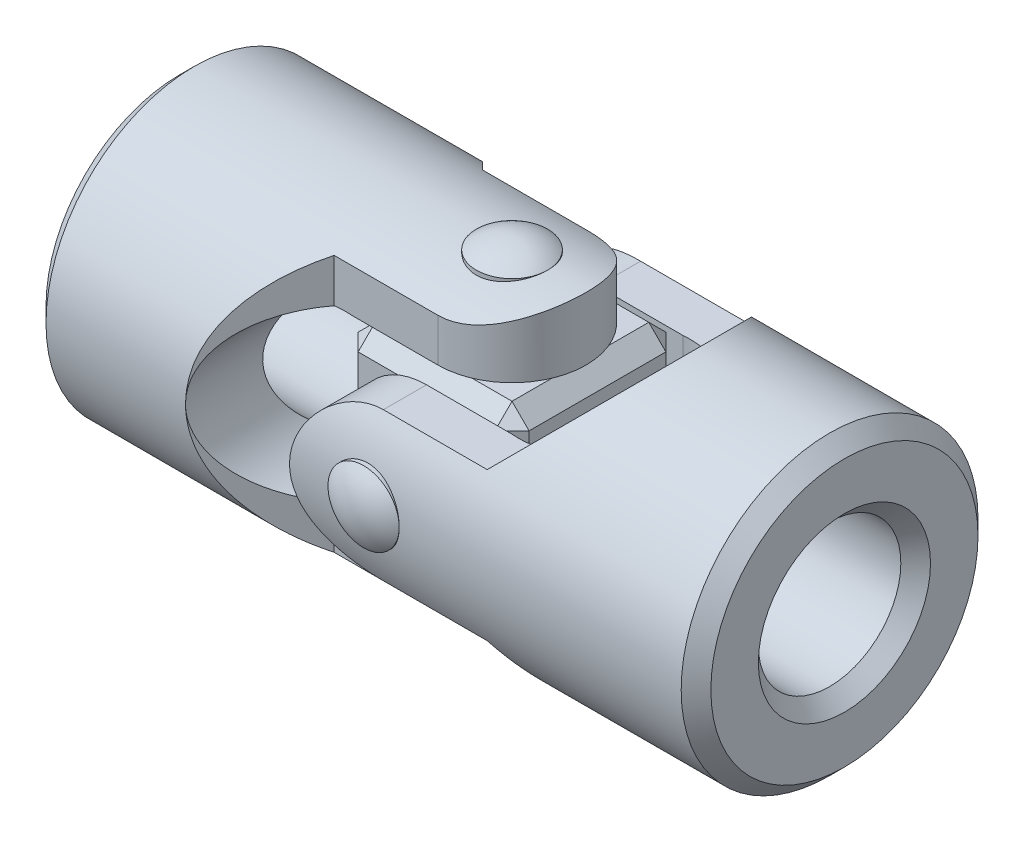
ISO-10303-21;
HEADER;
FILE_DESCRIPTION(('STEP AP214'),'2;1');
FILE_NAME('part.step','',(''),(''),'','','');
FILE_SCHEMA(('AUTOMOTIVE_DESIGN { 1 0 10303 214 1 1 1 1 }'));
ENDSEC;
DATA;
#1=APPLICATION_CONTEXT('core data for automotive mechanical design processes');
#2=APPLICATION_PROTOCOL_DEFINITION('international standard','automotive_design',2000,#1);
#3=PRODUCT_CONTEXT('',#1,'mechanical');
#4=PRODUCT('Part','Part','',(#3));
#5=PRODUCT_RELATED_PRODUCT_CATEGORY('part','',(#4));
#6=PRODUCT_DEFINITION_FORMATION('','',#4);
#7=PRODUCT_DEFINITION_CONTEXT('part definition',#1,'design');
#8=PRODUCT_DEFINITION('design','',#6,#7);
#9=PRODUCT_DEFINITION_SHAPE('','',#8);
#10=(LENGTH_UNIT() NAMED_UNIT(*) SI_UNIT(.MILLI.,.METRE.));
#11=(NAMED_UNIT(*) PLANE_ANGLE_UNIT() SI_UNIT($,.RADIAN.));
#12=(NAMED_UNIT(*) SI_UNIT($,.STERADIAN.) SOLID_ANGLE_UNIT());
#13=UNCERTAINTY_MEASURE_WITH_UNIT(LENGTH_MEASURE(1.E-05),#10,'distance_accuracy_value','');
#14=(GEOMETRIC_REPRESENTATION_CONTEXT(3) GLOBAL_UNCERTAINTY_ASSIGNED_CONTEXT((#13)) GLOBAL_UNIT_ASSIGNED_CONTEXT((#10,
#11,#12)) REPRESENTATION_CONTEXT('',''));
#15=CARTESIAN_POINT('',(0.,0.,0.));
#16=DIRECTION('',(0.,0.,1.));
#17=DIRECTION('',(1.,0.,0.));
#18=AXIS2_PLACEMENT_3D('',#15,#16,#17);
#19=CARTESIAN_POINT('',(0.,12.5,0.));
#20=DIRECTION('',(0.,-1.,0.));
#21=DIRECTION('',(-1.,0.,0.));
#22=AXIS2_PLACEMENT_3D('',#19,#20,#21);
#23=CYLINDRICAL_SURFACE('',#22,3.);
#24=CARTESIAN_POINT('',(0.,12.5,0.));
#25=DIRECTION('',(0.,1.,0.));
#26=DIRECTION('',(1.,0.,0.));
#27=AXIS2_PLACEMENT_3D('',#24,#25,#26);
#28=CIRCLE('',#27,3.);
#29=CARTESIAN_POINT('',(3.,12.5,0.));
#30=VERTEX_POINT('',#29);
#31=EDGE_CURVE('P0_E10',#30,#30,#28,.T.);
#32=ORIENTED_EDGE('',*,*,#31,.F.);
#33=EDGE_LOOP('',(#32));
#34=FACE_BOUND('',#33,.T.);
#35=CARTESIAN_POINT('',(0.,-12.5,0.));
#36=DIRECTION('',(0.,-1.,0.));
#37=DIRECTION('',(0.,0.,-1.));
#38=AXIS2_PLACEMENT_3D('',#35,#36,#37);
#39=CIRCLE('',#38,3.);
#40=CARTESIAN_POINT('',(0.,-12.5,-3.));
#41=VERTEX_POINT('',#40);
#42=EDGE_CURVE('P0_E20',#41,#41,#39,.T.);
#43=ORIENTED_EDGE('',*,*,#42,.F.);
#44=EDGE_LOOP('',(#43));
#45=FACE_BOUND('',#44,.T.);
#46=ADVANCED_FACE('P0_F14',(#34,#45),#23,.T.);
#47=CARTESIAN_POINT('',(0.,8.5,0.));
#48=DIRECTION('',(0.,-1.,0.));
#49=DIRECTION('',(0.,0.,-1.));
#50=AXIS2_PLACEMENT_3D('',#47,#48,#49);
#51=SPHERICAL_SURFACE('',#50,5.);
#52=ORIENTED_EDGE('',*,*,#31,.T.);
#53=EDGE_LOOP('',(#52));
#54=FACE_BOUND('',#53,.T.);
#55=ADVANCED_FACE('P0_F29',(#54),#51,.T.);
#56=CARTESIAN_POINT('',(0.,-8.5,0.));
#57=DIRECTION('',(0.,1.,0.));
#58=DIRECTION('',(0.,0.,-1.));
#59=AXIS2_PLACEMENT_3D('',#56,#57,#58);
#60=SPHERICAL_SURFACE('',#59,5.);
#61=ORIENTED_EDGE('',*,*,#42,.T.);
#62=EDGE_LOOP('',(#61));
#63=FACE_BOUND('',#62,.T.);
#64=ADVANCED_FACE('P0_F26',(#63),#60,.T.);
#65=CLOSED_SHELL('',(#46,#55,#64));
#66=MANIFOLD_SOLID_BREP('P0_B1',#65);
#67=CARTESIAN_POINT('',(0.,0.,12.5));
#68=DIRECTION('',(0.,0.,-1.));
#69=DIRECTION('',(-1.,0.,0.));
#70=AXIS2_PLACEMENT_3D('',#67,#68,#69);
#71=CYLINDRICAL_SURFACE('',#70,3.);
#72=CARTESIAN_POINT('',(0.,0.,12.5));
#73=DIRECTION('',(0.,0.,1.));
#74=DIRECTION('',(1.,0.,0.));
#75=AXIS2_PLACEMENT_3D('',#72,#73,#74);
#76=CIRCLE('',#75,3.);
#77=CARTESIAN_POINT('',(3.,0.,12.5));
#78=VERTEX_POINT('',#77);
#79=EDGE_CURVE('P1_E10',#78,#78,#76,.T.);
#80=ORIENTED_EDGE('',*,*,#79,.F.);
#81=EDGE_LOOP('',(#80));
#82=FACE_BOUND('',#81,.T.);
#83=CARTESIAN_POINT('',(0.,0.,-12.5));
#84=DIRECTION('',(0.,0.,-1.));
#85=DIRECTION('',(0.,1.,0.));
#86=AXIS2_PLACEMENT_3D('',#83,#84,#85);
#87=CIRCLE('',#86,3.);
#88=CARTESIAN_POINT('',(0.,3.,-12.5));
#89=VERTEX_POINT('',#88);
#90=EDGE_CURVE('P1_E20',#89,#89,#87,.T.);
#91=ORIENTED_EDGE('',*,*,#90,.F.);
#92=EDGE_LOOP('',(#91));
#93=FACE_BOUND('',#92,.T.);
#94=ADVANCED_FACE('P1_F14',(#82,#93),#71,.T.);
#95=CARTESIAN_POINT('',(0.,0.,8.5));
#96=DIRECTION('',(0.,0.,-1.));
#97=DIRECTION('',(0.,1.,0.));
#98=AXIS2_PLACEMENT_3D('',#95,#96,#97);
#99=SPHERICAL_SURFACE('',#98,5.);
#100=ORIENTED_EDGE('',*,*,#79,.T.);
#101=EDGE_LOOP('',(#100));
#102=FACE_BOUND('',#101,.T.);
#103=ADVANCED_FACE('P1_F29',(#102),#99,.T.);
#104=CARTESIAN_POINT('',(0.,0.,-8.5));
#105=DIRECTION('',(0.,0.,1.));
#106=DIRECTION('',(0.,1.,0.));
#107=AXIS2_PLACEMENT_3D('',#104,#105,#106);
#108=SPHERICAL_SURFACE('',#107,5.);
#109=ORIENTED_EDGE('',*,*,#90,.T.);
#110=EDGE_LOOP('',(#109));
#111=FACE_BOUND('',#110,.T.);
#112=ADVANCED_FACE('P1_F26',(#111),#108,.T.);
#113=CLOSED_SHELL('',(#94,#103,#112));
#114=MANIFOLD_SOLID_BREP('P1_B1',#113);
#115=CARTESIAN_POINT('',(0.,-12.5,-6.24));
#116=DIRECTION('',(0.,0.,1.));
#117=DIRECTION('',(1.,0.,0.));
#118=AXIS2_PLACEMENT_3D('',#115,#116,#117);
#119=PLANE('',#118);
#120=DIRECTION('',(0.,1.,0.));
#121=VECTOR('',#120,1.);
#122=CARTESIAN_POINT('',(0.,-12.5,-6.24));
#123=LINE('',#122,#121);
#124=CARTESIAN_POINT('',(0.,7.19999999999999,-6.24));
#125=VERTEX_POINT('',#124);
#126=CARTESIAN_POINT('',(0.,10.8310848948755,-6.24));
#127=VERTEX_POINT('',#126);
#128=EDGE_CURVE('P2_E283',#125,#127,#123,.T.);
#129=ORIENTED_EDGE('',*,*,#128,.F.);
#130=DIRECTION('',(-1.,0.,0.));
#131=VECTOR('',#130,1.);
#132=CARTESIAN_POINT('',(0.,7.19999999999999,-6.24));
#133=LINE('',#132,#131);
#134=CARTESIAN_POINT('',(-7.2,7.2,-6.24));
#135=VERTEX_POINT('',#134);
#136=EDGE_CURVE('P2_E132',#125,#135,#133,.T.);
#137=ORIENTED_EDGE('',*,*,#136,.T.);
#138=CARTESIAN_POINT('',(-7.77692307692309,0.,-6.24));
#139=DIRECTION('',(0.,0.,1.));
#140=DIRECTION('',(1.,0.,0.));
#141=AXIS2_PLACEMENT_3D('',#138,#139,#140);
#142=CIRCLE('',#141,7.22307692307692);
#143=CARTESIAN_POINT('',(-8.74000000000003,7.15858387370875,-6.24));
#144=VERTEX_POINT('',#143);
#145=EDGE_CURVE('P2_E147',#135,#144,#142,.T.);
#146=ORIENTED_EDGE('',*,*,#145,.T.);
#147=DIRECTION('',(0.,1.,0.));
#148=VECTOR('',#147,1.);
#149=CARTESIAN_POINT('',(-8.74000000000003,-12.5,-6.24));
#150=LINE('',#149,#148);
#151=CARTESIAN_POINT('',(-8.74000000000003,10.8310848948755,-6.24));
#152=VERTEX_POINT('',#151);
#153=EDGE_CURVE('P2_E290',#144,#152,#150,.T.);
#154=ORIENTED_EDGE('',*,*,#153,.T.);
#155=DIRECTION('',(1.,0.,0.));
#156=VECTOR('',#155,1.);
#157=CARTESIAN_POINT('',(-28.,10.8310848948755,-6.24));
#158=LINE('',#157,#156);
#159=EDGE_CURVE('P2_E228',#127,#152,#158,.F.);
#160=ORIENTED_EDGE('',*,*,#159,.F.);
#161=EDGE_LOOP('',(#129,#137,#146,#154,#160));
#162=FACE_BOUND('',#161,.T.);
#163=ADVANCED_FACE('P2_F16',(#162),#119,.F.);
#164=CARTESIAN_POINT('',(-8.74000000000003,-12.5,-6.24));
#165=DIRECTION('',(-0.707106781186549,0.,0.707106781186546));
#166=DIRECTION('',(0.707106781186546,0.,0.707106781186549));
#167=AXIS2_PLACEMENT_3D('',#164,#165,#166);
#168=PLANE('',#167);
#169=CARTESIAN_POINT('',(-2.50000000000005,0.,0.));
#170=DIRECTION('',(-0.707106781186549,0.,0.707106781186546));
#171=DIRECTION('',(0.707106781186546,0.,0.707106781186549));
#172=AXIS2_PLACEMENT_3D('',#169,#170,#171);
#173=ELLIPSE('',#172,17.6776695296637,12.5);
#174=CARTESIAN_POINT('',(-15.,0.,-12.5));
#175=VERTEX_POINT('',#174);
#176=CARTESIAN_POINT('',(-8.74000000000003,-10.8310848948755,-6.24));
#177=VERTEX_POINT('',#176);
#178=EDGE_CURVE('P2_E231',#175,#177,#173,.T.);
#179=ORIENTED_EDGE('',*,*,#178,.F.);
#180=CARTESIAN_POINT('',(-7.77692307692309,0.,-5.27692307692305));
#181=DIRECTION('',(-0.707106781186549,0.,0.707106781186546));
#182=DIRECTION('',(-0.707106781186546,0.,-0.707106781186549));
#183=AXIS2_PLACEMENT_3D('',#180,#181,#182);
#184=ELLIPSE('',#183,10.2149733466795,7.22307692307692);
#185=CARTESIAN_POINT('',(-8.74000000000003,-7.15858387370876,-6.24));
#186=VERTEX_POINT('',#185);
#187=EDGE_CURVE('P2_E144',#175,#186,#184,.T.);
#188=ORIENTED_EDGE('',*,*,#187,.T.);
#189=EDGE_CURVE('P2_E287',#177,#186,#150,.T.);
#190=ORIENTED_EDGE('',*,*,#189,.F.);
#191=EDGE_LOOP('',(#179,#188,#190));
#192=FACE_BOUND('',#191,.T.);
#193=ADVANCED_FACE('P2_F182',(#192),#168,.F.);
#194=CARTESIAN_POINT('',(-8.74000000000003,-12.5,6.24));
#195=DIRECTION('',(-0.707106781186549,0.,-0.707106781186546));
#196=DIRECTION('',(-0.707106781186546,0.,0.707106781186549));
#197=AXIS2_PLACEMENT_3D('',#194,#195,#196);
#198=PLANE('',#197);
#199=DIRECTION('',(0.,1.,0.));
#200=VECTOR('',#199,1.);
#201=CARTESIAN_POINT('',(-8.74000000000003,-12.5,6.24));
#202=LINE('',#201,#200);
#203=CARTESIAN_POINT('',(-8.74000000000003,-10.8310848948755,6.24));
#204=VERTEX_POINT('',#203);
#205=CARTESIAN_POINT('',(-8.74000000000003,-7.15858387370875,6.24));
#206=VERTEX_POINT('',#205);
#207=EDGE_CURVE('P2_E39',#204,#206,#202,.T.);
#208=ORIENTED_EDGE('',*,*,#207,.T.);
#209=CARTESIAN_POINT('',(-7.77692307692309,0.,5.27692307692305));
#210=DIRECTION('',(-0.707106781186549,0.,-0.707106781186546));
#211=DIRECTION('',(0.707106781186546,0.,-0.707106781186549));
#212=AXIS2_PLACEMENT_3D('',#209,#210,#211);
#213=ELLIPSE('',#212,10.2149733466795,7.22307692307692);
#214=CARTESIAN_POINT('',(-15.,0.,12.5));
#215=VERTEX_POINT('',#214);
#216=EDGE_CURVE('P2_E107',#206,#215,#213,.T.);
#217=ORIENTED_EDGE('',*,*,#216,.T.);
#218=CARTESIAN_POINT('',(-2.50000000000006,0.,0.));
#219=DIRECTION('',(-0.707106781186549,0.,-0.707106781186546));
#220=DIRECTION('',(0.707106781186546,0.,-0.707106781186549));
#221=AXIS2_PLACEMENT_3D('',#218,#219,#220);
#222=ELLIPSE('',#221,17.6776695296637,12.5);
#223=EDGE_CURVE('P2_E242',#204,#215,#222,.T.);
#224=ORIENTED_EDGE('',*,*,#223,.F.);
#225=EDGE_LOOP('',(#208,#217,#224));
#226=FACE_BOUND('',#225,.T.);
#227=ADVANCED_FACE('P2_F186',(#226),#198,.F.);
#228=CARTESIAN_POINT('',(0.,-12.5,6.24));
#229=DIRECTION('',(0.,0.,-1.));
#230=DIRECTION('',(-1.,0.,0.));
#231=AXIS2_PLACEMENT_3D('',#228,#229,#230);
#232=PLANE('',#231);
#233=CARTESIAN_POINT('',(-7.77692307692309,0.,6.24));
#234=DIRECTION('',(0.,0.,-1.));
#235=DIRECTION('',(-1.,0.,0.));
#236=AXIS2_PLACEMENT_3D('',#233,#234,#235);
#237=CIRCLE('',#236,7.22307692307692);
#238=CARTESIAN_POINT('',(-8.74000000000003,7.15858387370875,6.24));
#239=VERTEX_POINT('',#238);
#240=CARTESIAN_POINT('',(-7.2,7.2,6.24));
#241=VERTEX_POINT('',#240);
#242=EDGE_CURVE('P2_E108',#239,#241,#237,.T.);
#243=ORIENTED_EDGE('',*,*,#242,.T.);
#244=DIRECTION('',(1.,0.,0.));
#245=VECTOR('',#244,1.);
#246=CARTESIAN_POINT('',(0.,7.19999999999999,6.24));
#247=LINE('',#246,#245);
#248=CARTESIAN_POINT('',(0.,7.19999999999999,6.24));
#249=VERTEX_POINT('',#248);
#250=EDGE_CURVE('P2_E129',#241,#249,#247,.T.);
#251=ORIENTED_EDGE('',*,*,#250,.T.);
#252=DIRECTION('',(0.,1.,0.));
#253=VECTOR('',#252,1.);
#254=CARTESIAN_POINT('',(0.,-12.5,6.24));
#255=LINE('',#254,#253);
#256=CARTESIAN_POINT('',(0.,10.8310848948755,6.24));
#257=VERTEX_POINT('',#256);
#258=EDGE_CURVE('P2_E155',#249,#257,#255,.T.);
#259=ORIENTED_EDGE('',*,*,#258,.T.);
#260=DIRECTION('',(1.,0.,0.));
#261=VECTOR('',#260,1.);
#262=CARTESIAN_POINT('',(-28.,10.8310848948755,6.24));
#263=LINE('',#262,#261);
#264=CARTESIAN_POINT('',(-8.74000000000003,10.8310848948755,6.24));
#265=VERTEX_POINT('',#264);
#266=EDGE_CURVE('P2_E245',#265,#257,#263,.T.);
#267=ORIENTED_EDGE('',*,*,#266,.F.);
#268=EDGE_CURVE('P2_E293',#239,#265,#202,.T.);
#269=ORIENTED_EDGE('',*,*,#268,.F.);
#270=EDGE_LOOP('',(#243,#251,#259,#267,#269));
#271=FACE_BOUND('',#270,.T.);
#272=ADVANCED_FACE('P2_F189',(#271),#232,.F.);
#273=CARTESIAN_POINT('',(0.,-12.5,0.));
#274=DIRECTION('',(0.,1.,0.));
#275=DIRECTION('',(0.,0.,-1.));
#276=AXIS2_PLACEMENT_3D('',#273,#274,#275);
#277=CYLINDRICAL_SURFACE('',#276,6.24);
#278=ORIENTED_EDGE('',*,*,#258,.F.);
#279=CARTESIAN_POINT('',(0.,7.19999999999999,0.));
#280=DIRECTION('',(0.,1.,0.));
#281=DIRECTION('',(1.,0.,0.));
#282=AXIS2_PLACEMENT_3D('',#279,#280,#281);
#283=CIRCLE('',#282,6.24);
#284=EDGE_CURVE('P2_E109',#249,#125,#283,.T.);
#285=ORIENTED_EDGE('',*,*,#284,.T.);
#286=ORIENTED_EDGE('',*,*,#128,.T.);
#287=CARTESIAN_POINT('',(0.,10.8310848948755,6.24));
#288=CARTESIAN_POINT('',(0.163456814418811,10.83103605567,6.24003072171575));
#289=CARTESIAN_POINT('',(0.326890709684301,10.8347835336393,6.23357884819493));
#290=CARTESIAN_POINT('',(0.652332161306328,10.8495074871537,6.20794528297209));
#291=CARTESIAN_POINT('',(0.814340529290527,10.860479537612,6.18877138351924));
#292=CARTESIAN_POINT('',(1.13483511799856,10.8892074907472,6.13807390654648));
#293=CARTESIAN_POINT('',(1.29333617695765,10.9069242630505,6.10662153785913));
#294=CARTESIAN_POINT('',(1.60667183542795,10.9485017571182,6.03176194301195));
#295=CARTESIAN_POINT('',(1.76150601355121,10.972363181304,5.98835335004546));
#296=CARTESIAN_POINT('',(2.06617229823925,11.0253803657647,5.89016839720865));
#297=CARTESIAN_POINT('',(2.21601544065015,11.0545233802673,5.8354193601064));
#298=CARTESIAN_POINT('',(2.51030779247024,11.1172544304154,5.71500352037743));
#299=CARTESIAN_POINT('',(2.65475491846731,11.1508441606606,5.64933255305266));
#300=CARTESIAN_POINT('',(3.07924477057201,11.2569589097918,5.43654316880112));
#301=CARTESIAN_POINT('',(3.35026460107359,11.3347979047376,5.27370406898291));
#302=CARTESIAN_POINT('',(3.88424363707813,11.5034875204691,4.8955131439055));
#303=CARTESIAN_POINT('',(4.1447451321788,11.5948815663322,4.67696285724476));
#304=CARTESIAN_POINT('',(4.62739257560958,11.7760405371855,4.19997354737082));
#305=CARTESIAN_POINT('',(4.84952814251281,11.8658050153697,3.94152376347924));
#306=CARTESIAN_POINT('',(5.15659303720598,11.9955620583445,3.51857019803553));
#307=CARTESIAN_POINT('',(5.25724092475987,12.0392644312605,3.36637250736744));
#308=CARTESIAN_POINT('',(5.44523462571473,12.1225356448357,3.05292785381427));
#309=CARTESIAN_POINT('',(5.53258608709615,12.162106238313,2.89168477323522));
#310=CARTESIAN_POINT('',(5.69312545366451,12.2359715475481,2.56118606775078));
#311=CARTESIAN_POINT('',(5.76631669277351,12.2702675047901,2.39193234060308));
#312=CARTESIAN_POINT('',(5.8977278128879,12.3325683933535,2.04658833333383));
#313=CARTESIAN_POINT('',(5.95594927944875,12.360573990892,1.87049877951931));
#314=CARTESIAN_POINT('',(6.05309176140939,12.4076850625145,1.52560285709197));
#315=CARTESIAN_POINT('',(6.09308915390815,12.4272810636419,1.35716631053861));
#316=CARTESIAN_POINT('',(6.15901746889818,12.4597379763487,1.01691947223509));
#317=CARTESIAN_POINT('',(6.18494900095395,12.4725991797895,0.845109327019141));
#318=CARTESIAN_POINT('',(6.2223910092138,12.4912083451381,0.499626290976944));
#319=CARTESIAN_POINT('',(6.23390857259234,12.4969598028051,0.325954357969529));
#320=CARTESIAN_POINT('',(6.24238525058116,12.5011902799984,-0.0218286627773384));
#321=CARTESIAN_POINT('',(6.23934525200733,12.4996697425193,-0.195939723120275));
#322=CARTESIAN_POINT('',(6.21965099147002,12.4898517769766,-0.527966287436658));
#323=CARTESIAN_POINT('',(6.20420414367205,12.4821554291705,-0.685972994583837));
#324=CARTESIAN_POINT('',(6.16138628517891,12.4609283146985,-1.00002028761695));
#325=CARTESIAN_POINT('',(6.13401123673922,12.4473955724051,-1.15606018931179));
#326=CARTESIAN_POINT('',(6.06764661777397,12.4148258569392,-1.46499791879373));
#327=CARTESIAN_POINT('',(6.02866128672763,12.39579089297,-1.61789687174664));
#328=CARTESIAN_POINT('',(5.93945429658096,12.3526512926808,-1.91970251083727));
#329=CARTESIAN_POINT('',(5.88922833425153,12.3285447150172,-2.06860764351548));
#330=CARTESIAN_POINT('',(5.77726100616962,12.2754503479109,-2.36348336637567));
#331=CARTESIAN_POINT('',(5.7153739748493,12.246401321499,-2.50938763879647));
#332=CARTESIAN_POINT('',(5.58106814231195,12.1843007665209,-2.79540222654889));
#333=CARTESIAN_POINT('',(5.50864553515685,12.1512477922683,-2.93551042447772));
#334=CARTESIAN_POINT('',(5.27638038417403,12.0471306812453,-3.34606495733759));
#335=CARTESIAN_POINT('',(5.10147378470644,11.9710757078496,-3.60691545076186));
#336=CARTESIAN_POINT('',(4.69783517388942,11.8044532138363,-4.12126974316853));
#337=CARTESIAN_POINT('',(4.46558433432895,11.7131934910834,-4.37176534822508));
#338=CARTESIAN_POINT('',(3.96297095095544,11.5309486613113,-4.83203036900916));
#339=CARTESIAN_POINT('',(3.69257465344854,11.4399638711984,-5.04176332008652));
#340=CARTESIAN_POINT('',(3.25338074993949,11.3082133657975,-5.32788347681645));
#341=CARTESIAN_POINT('',(3.09617562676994,11.2638539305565,-5.42077424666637));
#342=CARTESIAN_POINT('',(2.77334744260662,11.1794279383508,-5.59281276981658));
#343=CARTESIAN_POINT('',(2.60772812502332,11.1393594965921,-5.67196656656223));
#344=CARTESIAN_POINT('',(2.2693462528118,11.0650421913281,-5.81561567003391));
#345=CARTESIAN_POINT('',(2.09659719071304,11.0307829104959,-5.88013728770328));
#346=CARTESIAN_POINT('',(1.7450017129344,10.9693871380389,-5.9938897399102));
#347=CARTESIAN_POINT('',(1.56615797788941,10.9422475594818,-6.04312720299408));
#348=CARTESIAN_POINT('',(1.15928061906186,10.8906576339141,-6.135723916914));
#349=CARTESIAN_POINT('',(0.929918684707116,10.8684902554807,-6.1746968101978));
#350=CARTESIAN_POINT('',(0.582953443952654,10.846142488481,-6.21380630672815));
#351=CARTESIAN_POINT('',(0.466690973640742,10.8405102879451,-6.22361793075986));
#352=CARTESIAN_POINT('',(0.233631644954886,10.8329770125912,-6.23671706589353));
#353=CARTESIAN_POINT('',(0.116834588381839,10.831077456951,-6.24000192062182));
#354=CARTESIAN_POINT('',(0.,10.8310848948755,-6.24));
#355=B_SPLINE_CURVE_WITH_KNOTS('',3,(#287,#288,#289,#290,#291,#292,#293,#294,#295,#296,#297,
#298,#299,#300,#301,#302,#303,#304,#305,#306,#307,#308,#309,#310,#311,#312,#313,#314,#315,#316,
#317,#318,#319,#320,#321,#322,#323,#324,#325,#326,#327,#328,#329,#330,#331,#332,#333,#334,#335,
#336,#337,#338,#339,#340,#341,#342,#343,#344,#345,#346,#347,#348,#349,#350,#351,#352,#353,#354),
.UNSPECIFIED.,.F.,.F.,(4,2,2,2,2,2,2,2,2,2,2,2,2,2,2,2,2,2,2,2,2,2,2,2,2,2,2,2,2,2,2,2,2,4),(0.,
0.490164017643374,0.980028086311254,1.46709241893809,1.95421245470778,2.44017223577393,
2.92631774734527,3.89915165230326,4.95128247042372,6.00369753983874,6.56596661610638,
7.12799618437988,7.68989326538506,8.25173080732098,8.7737013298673,9.29564923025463,
9.81734039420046,10.3389997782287,10.8152761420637,11.291713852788,11.7679778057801,
12.2444243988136,12.7272730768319,13.2102966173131,14.1757816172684,15.2322399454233,
16.2896390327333,16.8527525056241,17.4156176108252,17.9774624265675,18.5390632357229,
19.238082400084,19.5883086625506,19.9386774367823),.UNSPECIFIED.);
#356=EDGE_CURVE('P2_E204',#257,#127,#355,.T.);
#357=ORIENTED_EDGE('',*,*,#356,.F.);
#358=EDGE_LOOP('',(#278,#285,#286,#357));
#359=FACE_BOUND('',#358,.T.);
#360=ADVANCED_FACE('P2_F193',(#359),#277,.T.);
#361=CARTESIAN_POINT('',(-28.,0.,0.));
#362=DIRECTION('',(-1.,0.,0.));
#363=DIRECTION('',(0.,0.,1.));
#364=AXIS2_PLACEMENT_3D('',#361,#362,#363);
#365=PLANE('',#364);
#366=CARTESIAN_POINT('',(-28.,0.,0.));
#367=DIRECTION('',(-1.,0.,0.));
#368=DIRECTION('',(0.,0.,1.));
#369=AXIS2_PLACEMENT_3D('',#366,#367,#368);
#370=CIRCLE('',#369,7.24999999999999);
#371=CARTESIAN_POINT('',(-28.,0.,7.25));
#372=VERTEX_POINT('',#371);
#373=EDGE_CURVE('P2_E24',#372,#372,#370,.F.);
#374=ORIENTED_EDGE('',*,*,#373,.T.);
#375=EDGE_LOOP('',(#374));
#376=FACE_BOUND('',#375,.T.);
#377=CARTESIAN_POINT('',(-28.,0.,0.));
#378=DIRECTION('',(-1.,0.,0.));
#379=DIRECTION('',(0.,0.,1.));
#380=AXIS2_PLACEMENT_3D('',#377,#378,#379);
#381=CIRCLE('',#380,11.25);
#382=CARTESIAN_POINT('',(-28.,0.,11.25));
#383=VERTEX_POINT('',#382);
#384=EDGE_CURVE('P2_E255',#383,#383,#381,.T.);
#385=ORIENTED_EDGE('',*,*,#384,.T.);
#386=EDGE_LOOP('',(#385));
#387=FACE_BOUND('',#386,.T.);
#388=ADVANCED_FACE('P2_F214',(#376,#387),#365,.T.);
#389=CARTESIAN_POINT('',(-28.,0.,0.));
#390=DIRECTION('',(1.,0.,0.));
#391=DIRECTION('',(0.,0.,-1.));
#392=AXIS2_PLACEMENT_3D('',#389,#390,#391);
#393=CYLINDRICAL_SURFACE('',#392,12.5);
#394=CARTESIAN_POINT('',(-26.75,0.,0.));
#395=DIRECTION('',(-1.,0.,0.));
#396=DIRECTION('',(0.,0.,1.));
#397=AXIS2_PLACEMENT_3D('',#394,#395,#396);
#398=CIRCLE('',#397,12.5);
#399=CARTESIAN_POINT('',(-26.75,0.,12.5));
#400=VERTEX_POINT('',#399);
#401=EDGE_CURVE('P2_E11',#400,#400,#398,.F.);
#402=ORIENTED_EDGE('',*,*,#401,.T.);
#403=EDGE_LOOP('',(#402));
#404=FACE_BOUND('',#403,.T.);
#405=CARTESIAN_POINT('',(3.,-12.5,0.));
#406=CARTESIAN_POINT('',(2.99999497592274,-12.4999970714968,-0.165963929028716));
#407=CARTESIAN_POINT('',(2.98618158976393,-12.4966615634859,-0.331985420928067));
#408=CARTESIAN_POINT('',(2.93136726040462,-12.4836783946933,-0.65928429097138));
#409=CARTESIAN_POINT('',(2.89034957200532,-12.4740268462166,-0.820558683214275));
#410=CARTESIAN_POINT('',(2.78250766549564,-12.4494823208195,-1.13358839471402));
#411=CARTESIAN_POINT('',(2.71571311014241,-12.4345953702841,-1.28535442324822));
#412=CARTESIAN_POINT('',(2.55831456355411,-12.4011725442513,-1.57552517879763));
#413=CARTESIAN_POINT('',(2.46771023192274,-12.3826366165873,-1.71392971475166));
#414=CARTESIAN_POINT('',(2.26343582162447,-12.3435386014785,-1.97609263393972));
#415=CARTESIAN_POINT('',(2.14939721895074,-12.3229472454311,-2.0995595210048));
#416=CARTESIAN_POINT('',(1.90228113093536,-12.2822574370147,-2.32581080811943));
#417=CARTESIAN_POINT('',(1.76920165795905,-12.2621590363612,-2.42859304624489));
#418=CARTESIAN_POINT('',(1.48555416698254,-12.224437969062,-2.61189993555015));
#419=CARTESIAN_POINT('',(1.33477341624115,-12.2068525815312,-2.69210377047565));
#420=CARTESIAN_POINT('',(1.02138016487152,-12.1765733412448,-2.82591582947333));
#421=CARTESIAN_POINT('',(0.858769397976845,-12.1638787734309,-2.87952794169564));
#422=CARTESIAN_POINT('',(0.529523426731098,-12.1451184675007,-2.95765058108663));
#423=CARTESIAN_POINT('',(0.363018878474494,-12.1389341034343,-2.98268262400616));
#424=CARTESIAN_POINT('',(0.0280676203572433,-12.1335389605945,-3.00455808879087));
#425=CARTESIAN_POINT('',(-0.140378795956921,-12.1343271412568,-3.00140571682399));
#426=CARTESIAN_POINT('',(-0.47047596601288,-12.1426811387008,-2.96741912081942));
#427=CARTESIAN_POINT('',(-0.632194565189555,-12.1500960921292,-2.93720103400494));
#428=CARTESIAN_POINT('',(-0.948197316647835,-12.1706283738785,-2.85092141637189));
#429=CARTESIAN_POINT('',(-1.10248097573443,-12.1837460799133,-2.79485817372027));
#430=CARTESIAN_POINT('',(-1.40091297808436,-12.2143476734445,-2.65794121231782));
#431=CARTESIAN_POINT('',(-1.54495245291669,-12.2318714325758,-2.5768594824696));
#432=CARTESIAN_POINT('',(-1.81760450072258,-12.2692875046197,-2.39236688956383));
#433=CARTESIAN_POINT('',(-1.94621456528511,-12.2891802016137,-2.28895240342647));
#434=CARTESIAN_POINT('',(-2.18789357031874,-12.329732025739,-2.05951493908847));
#435=CARTESIAN_POINT('',(-2.30046709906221,-12.3503975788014,-1.93297064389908));
#436=CARTESIAN_POINT('',(-2.50288471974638,-12.3896951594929,-1.66255592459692));
#437=CARTESIAN_POINT('',(-2.59272822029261,-12.4083271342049,-1.51868504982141));
#438=CARTESIAN_POINT('',(-2.74729722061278,-12.4415394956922,-1.21702847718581));
#439=CARTESIAN_POINT('',(-2.81194745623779,-12.4561077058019,-1.05920278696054));
#440=CARTESIAN_POINT('',(-2.91366507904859,-12.4794620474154,-0.734497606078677));
#441=CARTESIAN_POINT('',(-2.95073731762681,-12.4882491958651,-0.567619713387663));
#442=CARTESIAN_POINT('',(-2.99550206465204,-12.4989027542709,-0.233787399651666));
#443=CARTESIAN_POINT('',(-3.00386989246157,-12.5009282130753,-0.0669284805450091));
#444=CARTESIAN_POINT('',(-2.9928332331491,-12.4982807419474,0.265804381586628));
#445=CARTESIAN_POINT('',(-2.97343103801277,-12.4936083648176,0.431678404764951));
#446=CARTESIAN_POINT('',(-2.90796302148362,-12.4781916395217,0.755422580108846));
#447=CARTESIAN_POINT('',(-2.8622608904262,-12.4675301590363,0.913370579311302));
#448=CARTESIAN_POINT('',(-2.74590180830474,-12.4413335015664,1.21935330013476));
#449=CARTESIAN_POINT('',(-2.6752424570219,-12.4257978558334,1.3673870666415));
#450=CARTESIAN_POINT('',(-2.50963340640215,-12.3911910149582,1.6520615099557));
#451=CARTESIAN_POINT('',(-2.41429928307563,-12.3720653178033,1.78847176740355));
#452=CARTESIAN_POINT('',(-2.20254307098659,-12.3324936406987,2.04359904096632));
#453=CARTESIAN_POINT('',(-2.08611764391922,-12.3120474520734,2.16231325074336));
#454=CARTESIAN_POINT('',(-1.83235916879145,-12.2715742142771,2.38142453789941));
#455=CARTESIAN_POINT('',(-1.6946148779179,-12.2515669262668,2.48134974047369));
#456=CARTESIAN_POINT('',(-1.40390957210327,-12.2147538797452,2.65666020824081));
#457=CARTESIAN_POINT('',(-1.25094923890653,-12.1979479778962,2.7320465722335));
#458=CARTESIAN_POINT('',(-0.934987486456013,-12.1696189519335,2.85558993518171));
#459=CARTESIAN_POINT('',(-0.772051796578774,-12.1580647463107,2.90390754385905));
#460=CARTESIAN_POINT('',(-0.440053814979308,-12.1415072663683,2.97238380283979));
#461=CARTESIAN_POINT('',(-0.270992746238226,-12.1365026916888,2.99254804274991));
#462=CARTESIAN_POINT('',(0.0636707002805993,-12.1337046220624,3.00387066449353));
#463=CARTESIAN_POINT('',(0.229246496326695,-12.1357241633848,2.99578106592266));
#464=CARTESIAN_POINT('',(0.556599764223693,-12.1463176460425,2.95253345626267));
#465=CARTESIAN_POINT('',(0.718377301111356,-12.1548914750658,2.91737590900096));
#466=CARTESIAN_POINT('',(1.03279755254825,-12.1775274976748,2.82138591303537));
#467=CARTESIAN_POINT('',(1.18548227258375,-12.191561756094,2.76068402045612));
#468=CARTESIAN_POINT('',(1.47860441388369,-12.2235433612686,2.61543373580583));
#469=CARTESIAN_POINT('',(1.61904026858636,-12.2414912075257,2.53088229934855));
#470=CARTESIAN_POINT('',(1.88733700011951,-12.279819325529,2.33793007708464));
#471=CARTESIAN_POINT('',(2.01481232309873,-12.3002478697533,2.22900267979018));
#472=CARTESIAN_POINT('',(2.24991998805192,-12.3409359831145,1.99143074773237));
#473=CARTESIAN_POINT('',(2.35754766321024,-12.361195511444,1.86278158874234));
#474=CARTESIAN_POINT('',(2.55160925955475,-12.3996570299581,1.5868829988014));
#475=CARTESIAN_POINT('',(2.637668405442,-12.4178200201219,1.43936414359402));
#476=CARTESIAN_POINT('',(2.78362953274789,-12.4496380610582,1.13153622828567));
#477=CARTESIAN_POINT('',(2.84355134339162,-12.4632965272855,0.971236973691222));
#478=CARTESIAN_POINT('',(2.92603862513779,-12.4824059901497,0.675887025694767));
#479=CARTESIAN_POINT('',(2.9537166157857,-12.4889599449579,0.542312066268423));
#480=CARTESIAN_POINT('',(2.99069878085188,-12.4977580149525,0.272504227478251));
#481=CARTESIAN_POINT('',(3.00000412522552,-12.5000024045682,0.136271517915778));
#482=CARTESIAN_POINT('',(3.,-12.5,0.));
#483=B_SPLINE_CURVE_WITH_KNOTS('',3,(#405,#406,#407,#408,#409,#410,#411,#412,#413,#414,#415,
#416,#417,#418,#419,#420,#421,#422,#423,#424,#425,#426,#427,#428,#429,#430,#431,#432,#433,#434,
#435,#436,#437,#438,#439,#440,#441,#442,#443,#444,#445,#446,#447,#448,#449,#450,#451,#452,#453,
#454,#455,#456,#457,#458,#459,#460,#461,#462,#463,#464,#465,#466,#467,#468,#469,#470,#471,#472,
#473,#474,#475,#476,#477,#478,#479,#480,#481,#482),.UNSPECIFIED.,.T.,.F.,(4,2,2,2,2,2,2,2,2,2,2,
2,2,2,2,2,2,2,2,2,2,2,2,2,2,2,2,2,2,2,2,2,2,2,2,2,2,2,4),(0.,0.497392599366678,
0.995091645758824,1.49221966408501,1.98935478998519,2.49500570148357,3.00070943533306,
3.51327262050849,4.02576083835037,4.52873995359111,5.03164400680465,5.52338274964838,
6.01515406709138,6.51154667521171,7.00801987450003,7.51749958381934,8.0269925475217,
8.53799614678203,9.04890983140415,9.54771776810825,10.0464845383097,10.5385143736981,
11.0305915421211,11.5308523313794,12.031192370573,12.5427824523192,13.0543496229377,
13.5628484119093,14.0712462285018,14.5662165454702,15.0611783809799,15.5536406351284,
16.0461657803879,16.5505844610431,17.0551215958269,17.5678974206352,18.0802835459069,
18.4887142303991,18.897118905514),.UNSPECIFIED.);
#484=CARTESIAN_POINT('',(3.,-12.5,0.));
#485=VERTEX_POINT('',#484);
#486=EDGE_CURVE('P2_E223',#485,#485,#483,.T.);
#487=ORIENTED_EDGE('',*,*,#486,.T.);
#488=EDGE_LOOP('',(#487));
#489=FACE_BOUND('',#488,.T.);
#490=CARTESIAN_POINT('',(0.,12.1346610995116,-3.));
#491=CARTESIAN_POINT('',(0.165886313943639,12.1346643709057,-2.999994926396));
#492=CARTESIAN_POINT('',(0.331830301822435,12.1380998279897,-2.98619401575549));
#493=CARTESIAN_POINT('',(0.658968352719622,12.1514386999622,-2.93143372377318));
#494=CARTESIAN_POINT('',(0.820159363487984,12.1613461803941,-2.89045727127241));
#495=CARTESIAN_POINT('',(1.13301229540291,12.1864438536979,-2.78273587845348));
#496=CARTESIAN_POINT('',(1.28468563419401,12.2016275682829,-2.71602252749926));
#497=CARTESIAN_POINT('',(1.57469954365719,12.2355589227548,-2.55881551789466));
#498=CARTESIAN_POINT('',(1.71303982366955,12.2543066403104,-2.46832134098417));
#499=CARTESIAN_POINT('',(1.97526881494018,12.2936793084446,-2.26416092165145));
#500=CARTESIAN_POINT('',(2.09884715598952,12.3143323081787,-2.15010136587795));
#501=CARTESIAN_POINT('',(2.32531539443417,12.3549444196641,-1.90289576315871));
#502=CARTESIAN_POINT('',(2.42820347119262,12.3749034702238,-1.7697480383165));
#503=CARTESIAN_POINT('',(2.61162643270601,12.4121875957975,-1.48603435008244));
#504=CARTESIAN_POINT('',(2.69185852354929,12.429475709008,-1.33526735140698));
#505=CARTESIAN_POINT('',(2.82572653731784,12.4591511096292,-1.02190364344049));
#506=CARTESIAN_POINT('',(2.87936606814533,12.471539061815,-0.859308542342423));
#507=CARTESIAN_POINT('',(2.95753815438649,12.4898200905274,-0.530137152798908));
#508=CARTESIAN_POINT('',(2.98259721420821,12.4958305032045,-0.363692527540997));
#509=CARTESIAN_POINT('',(3.00454751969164,12.5010873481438,-0.0288605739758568));
#510=CARTESIAN_POINT('',(3.00144261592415,12.5003347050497,0.139526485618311));
#511=CARTESIAN_POINT('',(2.96753629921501,12.4922383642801,0.469819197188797));
#512=CARTESIAN_POINT('',(2.93730291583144,12.4850298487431,0.631786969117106));
#513=CARTESIAN_POINT('',(2.85090826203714,12.4649879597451,0.948279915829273));
#514=CARTESIAN_POINT('',(2.79474567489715,12.4521543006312,1.10280471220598));
#515=CARTESIAN_POINT('',(2.65761316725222,12.4220937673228,1.40154850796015));
#516=CARTESIAN_POINT('',(2.57643674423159,12.4048305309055,1.54566890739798));
#517=CARTESIAN_POINT('',(2.39173656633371,12.3677903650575,1.8184437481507));
#518=CARTESIAN_POINT('',(2.28820919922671,12.3480130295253,1.94709568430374));
#519=CARTESIAN_POINT('',(2.0586845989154,12.307523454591,2.18866676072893));
#520=CARTESIAN_POINT('',(1.93219063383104,12.2868002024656,2.30111257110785));
#521=CARTESIAN_POINT('',(1.66192436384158,12.247210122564,2.50329554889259));
#522=CARTESIAN_POINT('',(1.51815137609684,12.2283433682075,2.59303181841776));
#523=CARTESIAN_POINT('',(1.21653474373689,12.1945661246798,2.74751986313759));
#524=CARTESIAN_POINT('',(1.05863494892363,12.1796724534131,2.81216594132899));
#525=CARTESIAN_POINT('',(0.733766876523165,12.155748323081,2.91385324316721));
#526=CARTESIAN_POINT('',(0.566800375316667,12.1467167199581,2.95089985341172));
#527=CARTESIAN_POINT('',(0.232906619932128,12.1357772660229,2.99556850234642));
#528=CARTESIAN_POINT('',(0.0660779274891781,12.1337008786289,3.0038868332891));
#529=CARTESIAN_POINT('',(-0.266583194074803,12.1364495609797,2.99276203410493));
#530=CARTESIAN_POINT('',(-0.432415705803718,12.1412740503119,2.97332123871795));
#531=CARTESIAN_POINT('',(-0.75584591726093,12.1571201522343,2.90783852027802));
#532=CARTESIAN_POINT('',(-0.913529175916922,12.1680489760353,2.86219461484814));
#533=CARTESIAN_POINT('',(-1.21900782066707,12.1947857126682,2.74603914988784));
#534=CARTESIAN_POINT('',(-1.3668021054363,12.2105941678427,2.6755248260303));
#535=CARTESIAN_POINT('',(-1.65127875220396,12.2456689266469,2.51014743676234));
#536=CARTESIAN_POINT('',(-1.78770937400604,12.2649930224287,2.41486385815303));
#537=CARTESIAN_POINT('',(-2.04290073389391,12.3047764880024,2.2031905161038));
#538=CARTESIAN_POINT('',(-2.16165880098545,12.3252360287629,2.08679756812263));
#539=CARTESIAN_POINT('',(-2.38091500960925,12.3655511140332,1.8330286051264));
#540=CARTESIAN_POINT('',(-2.48093375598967,12.3853821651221,1.69523379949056));
#541=CARTESIAN_POINT('',(-2.65640846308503,12.4217193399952,1.40439761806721));
#542=CARTESIAN_POINT('',(-2.73186567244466,12.438225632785,1.25135701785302));
#543=CARTESIAN_POINT('',(-2.85544747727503,12.4659520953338,0.935406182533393));
#544=CARTESIAN_POINT('',(-2.90376232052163,12.4772089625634,0.772573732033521));
#545=CARTESIAN_POINT('',(-2.97226782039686,12.4933282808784,0.440797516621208));
#546=CARTESIAN_POINT('',(-2.99246345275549,12.4981918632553,0.271854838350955));
#547=CARTESIAN_POINT('',(-3.00389586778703,12.5009346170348,-0.0628273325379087));
#548=CARTESIAN_POINT('',(-2.9958427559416,12.4989850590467,-0.228541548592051));
#549=CARTESIAN_POINT('',(-2.95262003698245,12.4886960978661,-0.556181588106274));
#550=CARTESIAN_POINT('',(-2.91745112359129,12.4803568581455,-0.718107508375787));
#551=CARTESIAN_POINT('',(-2.8213631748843,12.4582475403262,-1.03289533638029));
#552=CARTESIAN_POINT('',(-2.76056343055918,12.4445026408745,-1.18579554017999));
#553=CARTESIAN_POINT('',(-2.6150497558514,12.4130357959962,-1.47930912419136));
#554=CARTESIAN_POINT('',(-2.53033302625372,12.3953133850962,-1.61992106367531));
#555=CARTESIAN_POINT('',(-2.33717452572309,12.3573152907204,-1.88826701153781));
#556=CARTESIAN_POINT('',(-2.22824492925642,12.3369914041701,-2.01564306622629));
#557=CARTESIAN_POINT('',(-1.99071238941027,12.2963112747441,-2.25054951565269));
#558=CARTESIAN_POINT('',(-1.86210455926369,12.2759550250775,-2.35807496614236));
#559=CARTESIAN_POINT('',(-1.58626060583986,12.2371275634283,-2.5519948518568));
#560=CARTESIAN_POINT('',(-1.438747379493,12.2186938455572,-2.63800316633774));
#561=CARTESIAN_POINT('',(-1.13093815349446,12.1862909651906,-2.78387070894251));
#562=CARTESIAN_POINT('',(-0.970652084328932,12.1723183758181,-2.84375002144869));
#563=CARTESIAN_POINT('',(-0.675407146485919,12.1527391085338,-2.92614436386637));
#564=CARTESIAN_POINT('',(-0.541929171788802,12.1460087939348,-2.95378236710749));
#565=CARTESIAN_POINT('',(-0.272313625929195,12.1369686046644,-2.99071161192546));
#566=CARTESIAN_POINT('',(-0.13617624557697,12.1346584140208,-3.00000416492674));
#567=CARTESIAN_POINT('',(0.,12.1346610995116,-3.));
#568=B_SPLINE_CURVE_WITH_KNOTS('',3,(#490,#491,#492,#493,#494,#495,#496,#497,#498,#499,#500,
#501,#502,#503,#504,#505,#506,#507,#508,#509,#510,#511,#512,#513,#514,#515,#516,#517,#518,#519,
#520,#521,#522,#523,#524,#525,#526,#527,#528,#529,#530,#531,#532,#533,#534,#535,#536,#537,#538,
#539,#540,#541,#542,#543,#544,#545,#546,#547,#548,#549,#550,#551,#552,#553,#554,#555,#556,#557,
#558,#559,#560,#561,#562,#563,#564,#565,#566,#567),.UNSPECIFIED.,.T.,.F.,(4,2,2,2,2,2,2,2,2,2,2,
2,2,2,2,2,2,2,2,2,2,2,2,2,2,2,2,2,2,2,2,2,2,2,2,2,2,2,4),(0.,0.497159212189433,
0.994631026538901,1.49149417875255,1.98836816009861,2.49432418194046,3.00032470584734,
3.51279830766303,4.02520236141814,4.52800628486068,5.03074146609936,5.52318961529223,
6.01566277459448,6.51231571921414,7.00904899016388,7.51819168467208,8.02735450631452,
8.5386395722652,9.04982482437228,9.54852995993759,10.047193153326,10.5384749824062,
11.0298114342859,11.5301065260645,12.0304771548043,12.5422844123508,13.0540656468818,
13.5622134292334,14.0702712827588,14.5656502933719,15.0610166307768,15.5541024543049,
16.047246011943,16.5514085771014,17.0556965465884,17.56847227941,18.0808531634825,
18.4890008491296,18.8971193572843),.UNSPECIFIED.);
#569=CARTESIAN_POINT('',(0.,12.1346610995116,-3.));
#570=VERTEX_POINT('',#569);
#571=EDGE_CURVE('P2_E218',#570,#570,#568,.T.);
#572=ORIENTED_EDGE('',*,*,#571,.T.);
#573=EDGE_LOOP('',(#572));
#574=FACE_BOUND('',#573,.T.);
#575=ORIENTED_EDGE('',*,*,#266,.T.);
#576=ORIENTED_EDGE('',*,*,#356,.T.);
#577=ORIENTED_EDGE('',*,*,#159,.T.);
#578=EDGE_CURVE('P2_E232',#152,#175,#173,.T.);
#579=ORIENTED_EDGE('',*,*,#578,.T.);
#580=ORIENTED_EDGE('',*,*,#178,.T.);
#581=DIRECTION('',(1.,0.,0.));
#582=VECTOR('',#581,1.);
#583=CARTESIAN_POINT('',(-28.,-10.8310848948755,-6.24));
#584=LINE('',#583,#582);
#585=CARTESIAN_POINT('',(0.,-10.8310848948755,-6.24));
#586=VERTEX_POINT('',#585);
#587=EDGE_CURVE('P2_E235',#177,#586,#584,.T.);
#588=ORIENTED_EDGE('',*,*,#587,.T.);
#589=CARTESIAN_POINT('',(0.,-10.8310848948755,-6.24));
#590=CARTESIAN_POINT('',(0.163456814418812,-10.83103605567,-6.24003072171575));
#591=CARTESIAN_POINT('',(0.326890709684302,-10.8347835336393,-6.23357884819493));
#592=CARTESIAN_POINT('',(0.65233216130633,-10.8495074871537,-6.20794528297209));
#593=CARTESIAN_POINT('',(0.814340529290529,-10.860479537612,-6.18877138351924));
#594=CARTESIAN_POINT('',(1.13483511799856,-10.8892074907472,-6.13807390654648));
#595=CARTESIAN_POINT('',(1.29333617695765,-10.9069242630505,-6.10662153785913));
#596=CARTESIAN_POINT('',(1.60667183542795,-10.9485017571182,-6.03176194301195));
#597=CARTESIAN_POINT('',(1.76150601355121,-10.972363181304,-5.98835335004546));
#598=CARTESIAN_POINT('',(2.06617229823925,-11.0253803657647,-5.89016839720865));
#599=CARTESIAN_POINT('',(2.21601544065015,-11.0545233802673,-5.8354193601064));
#600=CARTESIAN_POINT('',(2.51030779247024,-11.1172544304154,-5.71500352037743));
#601=CARTESIAN_POINT('',(2.65475491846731,-11.1508441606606,-5.64933255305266));
#602=CARTESIAN_POINT('',(3.07924477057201,-11.2569589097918,-5.43654316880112));
#603=CARTESIAN_POINT('',(3.35026460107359,-11.3347979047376,-5.27370406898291));
#604=CARTESIAN_POINT('',(3.88424363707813,-11.5034875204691,-4.8955131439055));
#605=CARTESIAN_POINT('',(4.1447451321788,-11.5948815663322,-4.67696285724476));
#606=CARTESIAN_POINT('',(4.62739257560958,-11.7760405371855,-4.19997354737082));
#607=CARTESIAN_POINT('',(4.84952814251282,-11.8658050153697,-3.94152376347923));
#608=CARTESIAN_POINT('',(5.15659303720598,-11.9955620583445,-3.51857019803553));
#609=CARTESIAN_POINT('',(5.25724092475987,-12.0392644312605,-3.36637250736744));
#610=CARTESIAN_POINT('',(5.44523462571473,-12.1225356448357,-3.05292785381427));
#611=CARTESIAN_POINT('',(5.53258608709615,-12.162106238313,-2.89168477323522));
#612=CARTESIAN_POINT('',(5.69312545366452,-12.2359715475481,-2.56118606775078));
#613=CARTESIAN_POINT('',(5.76631669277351,-12.2702675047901,-2.39193234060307));
#614=CARTESIAN_POINT('',(5.89772781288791,-12.3325683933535,-2.04658833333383));
#615=CARTESIAN_POINT('',(5.95594927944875,-12.360573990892,-1.87049877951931));
#616=CARTESIAN_POINT('',(6.05309176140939,-12.4076850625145,-1.52560285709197));
#617=CARTESIAN_POINT('',(6.09308915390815,-12.4272810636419,-1.35716631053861));
#618=CARTESIAN_POINT('',(6.15901746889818,-12.4597379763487,-1.01691947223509));
#619=CARTESIAN_POINT('',(6.18494900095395,-12.4725991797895,-0.845109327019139));
#620=CARTESIAN_POINT('',(6.2223910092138,-12.4912083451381,-0.499626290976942));
#621=CARTESIAN_POINT('',(6.23390857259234,-12.4969598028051,-0.325954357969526));
#622=CARTESIAN_POINT('',(6.24238525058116,-12.5011902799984,0.021828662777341));
#623=CARTESIAN_POINT('',(6.23934525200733,-12.4996697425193,0.195939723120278));
#624=CARTESIAN_POINT('',(6.21965099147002,-12.4898517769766,0.52796628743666));
#625=CARTESIAN_POINT('',(6.20420414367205,-12.4821554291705,0.68597299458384));
#626=CARTESIAN_POINT('',(6.16138628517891,-12.4609283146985,1.00002028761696));
#627=CARTESIAN_POINT('',(6.13401123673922,-12.4473955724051,1.1560601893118));
#628=CARTESIAN_POINT('',(6.06764661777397,-12.4148258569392,1.46499791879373));
#629=CARTESIAN_POINT('',(6.02866128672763,-12.39579089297,1.61789687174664));
#630=CARTESIAN_POINT('',(5.93945429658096,-12.3526512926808,1.91970251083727));
#631=CARTESIAN_POINT('',(5.88922833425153,-12.3285447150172,2.06860764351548));
#632=CARTESIAN_POINT('',(5.77726100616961,-12.2754503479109,2.36348336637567));
#633=CARTESIAN_POINT('',(5.7153739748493,-12.246401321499,2.50938763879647));
#634=CARTESIAN_POINT('',(5.58106814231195,-12.1843007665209,2.79540222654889));
#635=CARTESIAN_POINT('',(5.50864553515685,-12.1512477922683,2.93551042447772));
#636=CARTESIAN_POINT('',(5.27638038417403,-12.0471306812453,3.34606495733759));
#637=CARTESIAN_POINT('',(5.10147378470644,-11.9710757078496,3.60691545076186));
#638=CARTESIAN_POINT('',(4.69783517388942,-11.8044532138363,4.12126974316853));
#639=CARTESIAN_POINT('',(4.46558433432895,-11.7131934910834,4.37176534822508));
#640=CARTESIAN_POINT('',(3.96297095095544,-11.5309486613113,4.83203036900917));
#641=CARTESIAN_POINT('',(3.69257465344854,-11.4399638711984,5.04176332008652));
#642=CARTESIAN_POINT('',(3.25338074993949,-11.3082133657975,5.32788347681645));
#643=CARTESIAN_POINT('',(3.09617562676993,-11.2638539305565,5.42077424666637));
#644=CARTESIAN_POINT('',(2.77334744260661,-11.1794279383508,5.59281276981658));
#645=CARTESIAN_POINT('',(2.60772812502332,-11.1393594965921,5.67196656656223));
#646=CARTESIAN_POINT('',(2.2693462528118,-11.0650421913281,5.81561567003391));
#647=CARTESIAN_POINT('',(2.09659719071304,-11.0307829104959,5.88013728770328));
#648=CARTESIAN_POINT('',(1.7450017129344,-10.9693871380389,5.99388973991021));
#649=CARTESIAN_POINT('',(1.5661579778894,-10.9422475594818,6.04312720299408));
#650=CARTESIAN_POINT('',(1.15928061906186,-10.8906576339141,6.135723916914));
#651=CARTESIAN_POINT('',(0.929918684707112,-10.8684902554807,6.1746968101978));
#652=CARTESIAN_POINT('',(0.58295344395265,-10.846142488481,6.21380630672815));
#653=CARTESIAN_POINT('',(0.466690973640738,-10.8405102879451,6.22361793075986));
#654=CARTESIAN_POINT('',(0.233631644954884,-10.8329770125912,6.23671706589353));
#655=CARTESIAN_POINT('',(0.116834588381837,-10.831077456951,6.24000192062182));
#656=CARTESIAN_POINT('',(0.,-10.8310848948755,6.24));
#657=B_SPLINE_CURVE_WITH_KNOTS('',3,(#589,#590,#591,#592,#593,#594,#595,#596,#597,#598,#599,
#600,#601,#602,#603,#604,#605,#606,#607,#608,#609,#610,#611,#612,#613,#614,#615,#616,#617,#618,
#619,#620,#621,#622,#623,#624,#625,#626,#627,#628,#629,#630,#631,#632,#633,#634,#635,#636,#637,
#638,#639,#640,#641,#642,#643,#644,#645,#646,#647,#648,#649,#650,#651,#652,#653,#654,#655,#656),
.UNSPECIFIED.,.F.,.F.,(4,2,2,2,2,2,2,2,2,2,2,2,2,2,2,2,2,2,2,2,2,2,2,2,2,2,2,2,2,2,2,2,2,4),(0.,
0.490164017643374,0.980028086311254,1.46709241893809,1.95421245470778,2.44017223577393,
2.92631774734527,3.89915165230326,4.95128247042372,6.00369753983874,6.56596661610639,
7.12799618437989,7.68989326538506,8.25173080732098,8.77370132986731,9.29564923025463,
9.81734039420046,10.3389997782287,10.8152761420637,11.291713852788,11.7679778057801,
12.2444243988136,12.7272730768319,13.2102966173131,14.1757816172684,15.2322399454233,
16.2896390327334,16.8527525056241,17.4156176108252,17.9774624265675,18.5390632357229,
19.2380824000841,19.5883086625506,19.9386774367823),.UNSPECIFIED.);
#658=CARTESIAN_POINT('',(0.,-10.8310848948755,6.24));
#659=VERTEX_POINT('',#658);
#660=EDGE_CURVE('P2_E197',#586,#659,#657,.T.);
#661=ORIENTED_EDGE('',*,*,#660,.T.);
#662=DIRECTION('',(1.,0.,0.));
#663=VECTOR('',#662,1.);
#664=CARTESIAN_POINT('',(-28.,-10.8310848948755,6.24));
#665=LINE('',#664,#663);
#666=EDGE_CURVE('P2_E238',#659,#204,#665,.F.);
#667=ORIENTED_EDGE('',*,*,#666,.T.);
#668=ORIENTED_EDGE('',*,*,#223,.T.);
#669=EDGE_CURVE('P2_E241',#215,#265,#222,.T.);
#670=ORIENTED_EDGE('',*,*,#669,.T.);
#671=EDGE_LOOP('',(#575,#576,#577,#579,#580,#588,#661,#667,#668,#670));
#672=FACE_BOUND('',#671,.T.);
#673=ADVANCED_FACE('P2_F211',(#404,#489,#574,#672),#393,.T.);
#674=CARTESIAN_POINT('',(-28.,0.,0.));
#675=DIRECTION('',(1.,0.,0.));
#676=DIRECTION('',(0.,0.,-1.));
#677=AXIS2_PLACEMENT_3D('',#674,#675,#676);
#678=CYLINDRICAL_SURFACE('',#677,6.);
#679=CARTESIAN_POINT('',(-26.75,0.,0.));
#680=DIRECTION('',(-1.,0.,0.));
#681=DIRECTION('',(0.,0.,1.));
#682=AXIS2_PLACEMENT_3D('',#679,#680,#681);
#683=CIRCLE('',#682,6.);
#684=CARTESIAN_POINT('',(-26.75,0.,6.));
#685=VERTEX_POINT('',#684);
#686=EDGE_CURVE('P2_E252',#685,#685,#683,.T.);
#687=ORIENTED_EDGE('',*,*,#686,.T.);
#688=EDGE_LOOP('',(#687));
#689=FACE_BOUND('',#688,.T.);
#690=CARTESIAN_POINT('',(-15.,0.,-6.));
#691=CARTESIAN_POINT('',(-15.0000052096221,-0.142671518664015,-6.0000053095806));
#692=CARTESIAN_POINT('',(-14.9957673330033,-0.28529832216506,-5.99490627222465));
#693=CARTESIAN_POINT('',(-14.9789278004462,-0.569380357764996,-5.97461854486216));
#694=CARTESIAN_POINT('',(-14.9663246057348,-0.710835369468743,-5.95942799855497));
#695=CARTESIAN_POINT('',(-14.9330301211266,-0.991440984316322,-5.9192190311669));
#696=CARTESIAN_POINT('',(-14.9123344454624,-1.13059029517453,-5.89419528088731));
#697=CARTESIAN_POINT('',(-14.8633038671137,-1.40554628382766,-5.83474376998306));
#698=CARTESIAN_POINT('',(-14.8349655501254,-1.54135143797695,-5.8003118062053));
#699=CARTESIAN_POINT('',(-14.7714410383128,-1.80781368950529,-5.72284287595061));
#700=CARTESIAN_POINT('',(-14.7363011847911,-1.93849880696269,-5.67986409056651));
#701=CARTESIAN_POINT('',(-14.6597070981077,-2.19501163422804,-5.58575135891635));
#702=CARTESIAN_POINT('',(-14.6182501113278,-2.32083719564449,-5.53461385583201));
#703=CARTESIAN_POINT('',(-14.4854384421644,-2.69015836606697,-5.36987897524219));
#704=CARTESIAN_POINT('',(-14.3855953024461,-2.92569231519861,-5.24490164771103));
#705=CARTESIAN_POINT('',(-14.2034916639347,-3.30165907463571,-5.01311411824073));
#706=CARTESIAN_POINT('',(-14.125663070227,-3.44860299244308,-4.91306700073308));
#707=CARTESIAN_POINT('',(-13.9639219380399,-3.73099395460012,-4.70220146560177));
#708=CARTESIAN_POINT('',(-13.8800094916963,-3.86644117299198,-4.59138321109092));
#709=CARTESIAN_POINT('',(-13.7076273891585,-4.12600788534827,-4.35963675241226));
#710=CARTESIAN_POINT('',(-13.6191460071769,-4.25009570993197,-4.23868198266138));
#711=CARTESIAN_POINT('',(-13.439613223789,-4.4865132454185,-3.98759688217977));
#712=CARTESIAN_POINT('',(-13.348562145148,-4.59884442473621,-3.85746770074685));
#713=CARTESIAN_POINT('',(-13.1641000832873,-4.81368538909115,-3.58593827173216));
#714=CARTESIAN_POINT('',(-13.0706762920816,-4.91597947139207,-3.44437611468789));
#715=CARTESIAN_POINT('',(-12.8853397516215,-5.10830217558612,-3.15212124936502));
#716=CARTESIAN_POINT('',(-12.7934275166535,-5.19832669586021,-3.00142551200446));
#717=CARTESIAN_POINT('',(-12.6141355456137,-5.36555631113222,-2.69105865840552));
#718=CARTESIAN_POINT('',(-12.5267453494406,-5.44279199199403,-2.53141021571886));
#719=CARTESIAN_POINT('',(-12.3599229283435,-5.58398415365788,-2.20253188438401));
#720=CARTESIAN_POINT('',(-12.28048393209,-5.64795198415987,-2.0333103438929));
#721=CARTESIAN_POINT('',(-12.1270060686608,-5.76714475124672,-1.6674833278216));
#722=CARTESIAN_POINT('',(-12.0542599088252,-5.82089796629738,-1.46981958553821));
#723=CARTESIAN_POINT('',(-11.9627209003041,-5.88671063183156,-1.16508565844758));
#724=CARTESIAN_POINT('',(-11.9351505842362,-5.90617054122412,-1.06220659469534));
#725=CARTESIAN_POINT('',(-11.8869056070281,-5.93984413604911,-0.85402310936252));
#726=CARTESIAN_POINT('',(-11.8662273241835,-5.95406057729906,-0.748719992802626));
#727=CARTESIAN_POINT('',(-11.8325022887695,-5.97708499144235,-0.534933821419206));
#728=CARTESIAN_POINT('',(-11.8195539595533,-5.98582327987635,-0.42642748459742));
#729=CARTESIAN_POINT('',(-11.802400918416,-5.99737256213,-0.208409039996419));
#730=CARTESIAN_POINT('',(-11.7981954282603,-6.00018408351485,-0.098897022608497));
#731=CARTESIAN_POINT('',(-11.79877266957,-5.99979718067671,0.120102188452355));
#732=CARTESIAN_POINT('',(-11.8035561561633,-5.99659825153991,0.229589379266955));
#733=CARTESIAN_POINT('',(-11.8218328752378,-5.984284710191,0.447495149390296));
#734=CARTESIAN_POINT('',(-11.8353271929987,-5.97516936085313,0.555913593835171));
#735=CARTESIAN_POINT('',(-11.871869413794,-5.95019185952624,0.780444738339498));
#736=CARTESIAN_POINT('',(-11.8956654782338,-5.93379801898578,0.896375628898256));
#737=CARTESIAN_POINT('',(-11.951437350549,-5.89469532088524,1.12519438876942));
#738=CARTESIAN_POINT('',(-11.9834189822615,-5.8719819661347,1.23808002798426));
#739=CARTESIAN_POINT('',(-12.0896104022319,-5.79492577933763,1.57196887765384));
#740=CARTESIAN_POINT('',(-12.1739823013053,-5.73172044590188,1.78774797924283));
#741=CARTESIAN_POINT('',(-12.3397943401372,-5.60016344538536,2.16073203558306));
#742=CARTESIAN_POINT('',(-12.4181732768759,-5.53563699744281,2.32076477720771));
#743=CARTESIAN_POINT('',(-12.5814287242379,-5.39455318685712,2.6321073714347));
#744=CARTESIAN_POINT('',(-12.6663089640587,-5.31798889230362,2.78341212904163));
#745=CARTESIAN_POINT('',(-12.8396284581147,-5.15326893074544,3.07771060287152));
#746=CARTESIAN_POINT('',(-12.928072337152,-5.06509784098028,3.22069288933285));
#747=CARTESIAN_POINT('',(-13.1060478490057,-4.87749825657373,3.49829385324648));
#748=CARTESIAN_POINT('',(-13.1955792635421,-4.77807198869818,3.63291417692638));
#749=CARTESIAN_POINT('',(-13.3782313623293,-4.56279474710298,3.90023112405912));
#750=CARTESIAN_POINT('',(-13.4713087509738,-4.44637240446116,4.03249808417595));
#751=CARTESIAN_POINT('',(-13.6545331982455,-4.20118645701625,4.28734120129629));
#752=CARTESIAN_POINT('',(-13.7446798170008,-4.07242101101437,4.40991590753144));
#753=CARTESIAN_POINT('',(-13.9199469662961,-3.80287921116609,4.64434533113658));
#754=CARTESIAN_POINT('',(-14.0050776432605,-3.66212861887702,4.75622199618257));
#755=CARTESIAN_POINT('',(-14.16864877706,-3.36851736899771,4.968489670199));
#756=CARTESIAN_POINT('',(-14.2470892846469,-3.21565680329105,5.06888076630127));
#757=CARTESIAN_POINT('',(-14.3767850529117,-2.9380118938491,5.2332786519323));
#758=CARTESIAN_POINT('',(-14.4299316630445,-2.81577203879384,5.30010428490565));
#759=CARTESIAN_POINT('',(-14.5305504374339,-2.56507116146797,5.42587009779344));
#760=CARTESIAN_POINT('',(-14.5780239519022,-2.43661162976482,5.4848121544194));
#761=CARTESIAN_POINT('',(-14.6664807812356,-2.17394458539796,5.59412152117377));
#762=CARTESIAN_POINT('',(-14.707465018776,-2.0397378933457,5.64449005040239));
#763=CARTESIAN_POINT('',(-14.7821483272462,-1.76627757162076,5.73594255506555));
#764=CARTESIAN_POINT('',(-14.8158504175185,-1.62702606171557,5.77703037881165));
#765=CARTESIAN_POINT('',(-14.8755039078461,-1.3431969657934,5.84956742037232));
#766=CARTESIAN_POINT('',(-14.9013932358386,-1.19858647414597,5.88093949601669));
#767=CARTESIAN_POINT('',(-14.9444562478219,-0.906170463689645,5.93303520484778));
#768=CARTESIAN_POINT('',(-14.9616299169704,-0.75836493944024,5.9537588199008));
#769=CARTESIAN_POINT('',(-14.9868235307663,-0.460914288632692,5.98413706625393));
#770=CARTESIAN_POINT('',(-14.9948479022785,-0.311270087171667,5.99379705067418));
#771=CARTESIAN_POINT('',(-15.0015463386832,-0.0114770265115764,6.00186192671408));
#772=CARTESIAN_POINT('',(-15.0002213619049,0.138671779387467,6.00026797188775));
#773=CARTESIAN_POINT('',(-14.9889600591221,0.420576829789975,5.98670595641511));
#774=CARTESIAN_POINT('',(-14.9800459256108,0.552436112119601,5.97596930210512));
#775=CARTESIAN_POINT('',(-14.9551332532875,0.814539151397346,5.94591723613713));
#776=CARTESIAN_POINT('',(-14.9391323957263,0.944782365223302,5.92659901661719));
#777=CARTESIAN_POINT('',(-14.9003598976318,1.20269879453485,5.87968425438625));
#778=CARTESIAN_POINT('',(-14.8775903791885,1.33037280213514,5.85209030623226));
#779=CARTESIAN_POINT('',(-14.8257000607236,1.58245870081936,5.78901843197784));
#780=CARTESIAN_POINT('',(-14.7965768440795,1.70686933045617,5.75353750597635));
#781=CARTESIAN_POINT('',(-14.6992672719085,2.07850408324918,5.63454927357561));
#782=CARTESIAN_POINT('',(-14.6218293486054,2.31968738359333,5.53932027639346));
#783=CARTESIAN_POINT('',(-14.447371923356,2.7819336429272,5.32223868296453));
#784=CARTESIAN_POINT('',(-14.3503454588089,3.00298940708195,5.20037661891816));
#785=CARTESIAN_POINT('',(-14.1702657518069,3.36556463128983,4.97047191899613));
#786=CARTESIAN_POINT('',(-14.0906682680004,3.51228098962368,4.86779176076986));
#787=CARTESIAN_POINT('',(-13.9255431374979,3.79393645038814,4.65161928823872));
#788=CARTESIAN_POINT('',(-13.8400152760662,3.92887512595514,4.53812658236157));
#789=CARTESIAN_POINT('',(-13.6645550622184,4.1872540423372,4.30090321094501));
#790=CARTESIAN_POINT('',(-13.5746096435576,4.31065659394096,4.17714132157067));
#791=CARTESIAN_POINT('',(-13.3924133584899,4.5454574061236,3.92034253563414));
#792=CARTESIAN_POINT('',(-13.3001628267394,4.65685739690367,3.78730698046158));
#793=CARTESIAN_POINT('',(-13.1136784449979,4.86952034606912,3.50982510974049));
#794=CARTESIAN_POINT('',(-13.0194384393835,4.97056845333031,3.36521825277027));
#795=CARTESIAN_POINT('',(-12.8329735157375,5.16012270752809,3.06666301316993));
#796=CARTESIAN_POINT('',(-12.7407493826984,5.24862403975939,2.91271107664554));
#797=CARTESIAN_POINT('',(-12.5616130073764,5.41241682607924,2.59566508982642));
#798=CARTESIAN_POINT('',(-12.4746856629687,5.48774710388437,2.43259984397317));
#799=CARTESIAN_POINT('',(-12.3098298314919,5.6246830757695,2.0966269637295));
#800=CARTESIAN_POINT('',(-12.2318924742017,5.68630235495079,1.92372928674));
#801=CARTESIAN_POINT('',(-12.0851946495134,5.79833992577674,1.5552275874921));
#802=CARTESIAN_POINT('',(-12.0174296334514,5.84770069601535,1.35887951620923));
#803=CARTESIAN_POINT('',(-11.9338658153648,5.90710094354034,1.05673398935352));
#804=CARTESIAN_POINT('',(-11.9090367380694,5.92445351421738,0.954825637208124));
#805=CARTESIAN_POINT('',(-11.8663568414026,5.9539941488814,0.748841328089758));
#806=CARTESIAN_POINT('',(-11.848502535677,5.9661847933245,0.644766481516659));
#807=CARTESIAN_POINT('',(-11.8204480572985,5.98523524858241,0.433918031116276));
#808=CARTESIAN_POINT('',(-11.8103341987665,5.99203497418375,0.327127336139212));
#809=CARTESIAN_POINT('',(-11.7986318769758,5.99989581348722,0.112868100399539));
#810=CARTESIAN_POINT('',(-11.7970428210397,6.0009573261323,0.0053996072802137));
#811=CARTESIAN_POINT('',(-11.8024802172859,5.99731106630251,-0.209251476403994));
#812=CARTESIAN_POINT('',(-11.8095093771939,5.99260148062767,-0.316433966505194));
#813=CARTESIAN_POINT('',(-11.8318021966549,5.97753903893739,-0.529577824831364));
#814=CARTESIAN_POINT('',(-11.8470702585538,5.96718316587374,-0.635538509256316));
#815=CARTESIAN_POINT('',(-11.8877029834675,5.93927737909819,-0.859924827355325));
#816=CARTESIAN_POINT('',(-11.9141710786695,5.92093126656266,-0.978050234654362));
#817=CARTESIAN_POINT('',(-11.9753344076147,5.87771884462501,-1.2109805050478));
#818=CARTESIAN_POINT('',(-12.010035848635,5.85284761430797,-1.32578278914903));
#819=CARTESIAN_POINT('',(-12.0862055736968,5.79699547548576,-1.5519170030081));
#820=CARTESIAN_POINT('',(-12.1276914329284,5.76599865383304,-1.66323900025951));
#821=CARTESIAN_POINT('',(-12.2159079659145,5.69836346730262,-1.88195509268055));
#822=CARTESIAN_POINT('',(-12.2626374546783,5.66172637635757,-1.98935006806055));
#823=CARTESIAN_POINT('',(-12.3885152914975,5.56020232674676,-2.26184283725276));
#824=CARTESIAN_POINT('',(-12.4706755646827,5.49130180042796,-2.42406238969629));
#825=CARTESIAN_POINT('',(-12.6409967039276,5.34102578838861,-2.73933562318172));
#826=CARTESIAN_POINT('',(-12.7291609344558,5.25964327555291,-2.8923840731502));
#827=CARTESIAN_POINT('',(-12.9085628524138,5.08476453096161,-3.18982170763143));
#828=CARTESIAN_POINT('',(-12.9998044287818,4.99125251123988,-3.33419924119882));
#829=CARTESIAN_POINT('',(-13.182823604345,4.79242556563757,-3.61415619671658));
#830=CARTESIAN_POINT('',(-13.2746010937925,4.68711298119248,-3.74973735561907));
#831=CARTESIAN_POINT('',(-13.4606077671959,4.45993721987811,-4.01759983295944));
#832=CARTESIAN_POINT('',(-13.554772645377,4.33755704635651,-4.14948848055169));
#833=CARTESIAN_POINT('',(-13.7394484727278,4.07998158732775,-4.4029990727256));
#834=CARTESIAN_POINT('',(-13.8299588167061,3.94478419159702,-4.52461932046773));
#835=CARTESIAN_POINT('',(-14.0051341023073,3.66194565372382,-4.75641840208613));
#836=CARTESIAN_POINT('',(-14.0898106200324,3.51433052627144,-4.86662012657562));
#837=CARTESIAN_POINT('',(-14.2514978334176,3.20669386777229,-5.07459866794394));
#838=CARTESIAN_POINT('',(-14.3285118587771,3.04667777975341,-5.17238088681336));
#839=CARTESIAN_POINT('',(-14.4527619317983,2.76099330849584,-5.32874862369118));
#840=CARTESIAN_POINT('',(-14.5023224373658,2.63815076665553,-5.39067165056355));
#841=CARTESIAN_POINT('',(-14.5956168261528,2.38667786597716,-5.50662605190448));
#842=CARTESIAN_POINT('',(-14.6393521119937,2.25804891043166,-5.56065932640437));
#843=CARTESIAN_POINT('',(-14.720191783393,1.99566368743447,-5.66012180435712));
#844=CARTESIAN_POINT('',(-14.7573042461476,1.86191391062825,-5.70556149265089));
#845=CARTESIAN_POINT('',(-14.8242407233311,1.58990110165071,-5.78726118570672));
#846=CARTESIAN_POINT('',(-14.8540661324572,1.45163893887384,-5.82352294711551));
#847=CARTESIAN_POINT('',(-14.9192047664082,1.09879304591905,-5.90254945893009));
#848=CARTESIAN_POINT('',(-14.9493619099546,0.881762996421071,-5.93895787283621));
#849=CARTESIAN_POINT('',(-14.989756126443,0.443119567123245,-5.98767980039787));
#850=CARTESIAN_POINT('',(-14.9999919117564,0.221505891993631,-5.99999175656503));
#851=CARTESIAN_POINT('',(-15.,0.,-6.));
#852=B_SPLINE_CURVE_WITH_KNOTS('',3,(#690,#691,#692,#693,#694,#695,#696,#697,#698,#699,#700,
#701,#702,#703,#704,#705,#706,#707,#708,#709,#710,#711,#712,#713,#714,#715,#716,#717,#718,#719,
#720,#721,#722,#723,#724,#725,#726,#727,#728,#729,#730,#731,#732,#733,#734,#735,#736,#737,#738,
#739,#740,#741,#742,#743,#744,#745,#746,#747,#748,#749,#750,#751,#752,#753,#754,#755,#756,#757,
#758,#759,#760,#761,#762,#763,#764,#765,#766,#767,#768,#769,#770,#771,#772,#773,#774,#775,#776,
#777,#778,#779,#780,#781,#782,#783,#784,#785,#786,#787,#788,#789,#790,#791,#792,#793,#794,#795,
#796,#797,#798,#799,#800,#801,#802,#803,#804,#805,#806,#807,#808,#809,#810,#811,#812,#813,#814,
#815,#816,#817,#818,#819,#820,#821,#822,#823,#824,#825,#826,#827,#828,#829,#830,#831,#832,#833,
#834,#835,#836,#837,#838,#839,#840,#841,#842,#843,#844,#845,#846,#847,#848,#849,#850,#851),
.UNSPECIFIED.,.T.,.F.,(4,2,2,2,2,2,2,2,2,2,2,2,2,2,2,2,2,2,2,2,2,2,2,2,2,2,2,2,2,2,2,2,2,2,2,2,
2,2,2,2,2,2,2,2,2,2,2,2,2,2,2,2,2,2,2,2,2,2,2,2,2,2,2,2,2,2,2,2,2,2,2,2,2,2,2,2,2,2,2,2,4),(0.,
0.427784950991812,0.855648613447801,1.28374448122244,1.71203191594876,2.13749793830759,
2.5631499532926,3.41383727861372,3.99536974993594,4.57689341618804,5.15999187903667,
5.74301742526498,6.33664333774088,6.93046721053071,7.52284971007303,8.11472335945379,
8.76461650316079,9.08912680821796,9.41346631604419,9.74185203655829,10.0702085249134,
10.3985925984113,10.7270175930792,11.0848922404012,11.4430222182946,12.1606652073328,
12.7285764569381,13.2968159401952,13.8658182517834,14.4347081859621,15.031928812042,
15.6292386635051,16.2252955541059,16.8213479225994,17.2682669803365,17.7150794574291,
18.161828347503,18.6083916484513,19.0584147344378,19.5084385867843,19.9582446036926,
20.4080045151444,20.8053176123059,21.2027608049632,21.6000795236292,21.9975496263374,
22.8060499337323,23.6148381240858,24.2020170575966,24.7892172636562,25.3782733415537,
25.9672443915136,26.5666621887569,27.1663093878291,27.7641580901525,28.3614117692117,
28.9996113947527,29.3182449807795,29.6367190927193,29.958694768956,30.2806480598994,
30.6027025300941,30.924929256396,31.2916707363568,31.6586895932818,32.0266747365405,
32.3945768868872,32.9770564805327,33.5598652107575,34.1434402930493,34.7268997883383,
35.3354514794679,35.9441035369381,36.5515108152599,37.1586529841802,37.5969227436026,
38.0350867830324,38.4727127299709,38.9102548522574,39.574373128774,40.2385343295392),.UNSPECIFIED.);
#853=CARTESIAN_POINT('',(-15.,0.,-6.));
#854=VERTEX_POINT('',#853);
#855=EDGE_CURVE('P2_E148',#854,#854,#852,.T.);
#856=ORIENTED_EDGE('',*,*,#855,.F.);
#857=EDGE_LOOP('',(#856));
#858=FACE_BOUND('',#857,.T.);
#859=ADVANCED_FACE('P2_F158',(#689,#858),#678,.F.);
#860=CARTESIAN_POINT('',(0.,-12.5,0.));
#861=DIRECTION('',(0.,1.,0.));
#862=DIRECTION('',(0.,0.,-1.));
#863=AXIS2_PLACEMENT_3D('',#860,#861,#862);
#864=CYLINDRICAL_SURFACE('',#863,3.);
#865=CARTESIAN_POINT('',(0.,7.19999999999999,0.));
#866=DIRECTION('',(0.,1.,0.));
#867=DIRECTION('',(1.,0.,0.));
#868=AXIS2_PLACEMENT_3D('',#865,#866,#867);
#869=CIRCLE('',#868,3.);
#870=CARTESIAN_POINT('',(3.,7.19999999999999,0.));
#871=VERTEX_POINT('',#870);
#872=EDGE_CURVE('P2_E135',#871,#871,#869,.F.);
#873=ORIENTED_EDGE('',*,*,#872,.T.);
#874=EDGE_LOOP('',(#873));
#875=FACE_BOUND('',#874,.T.);
#876=ORIENTED_EDGE('',*,*,#571,.F.);
#877=EDGE_LOOP('',(#876));
#878=FACE_BOUND('',#877,.T.);
#879=ADVANCED_FACE('P2_F268',(#875,#878),#864,.F.);
#880=CARTESIAN_POINT('',(0.,-7.2,0.));
#881=DIRECTION('',(0.,-1.,0.));
#882=DIRECTION('',(0.,0.,1.));
#883=AXIS2_PLACEMENT_3D('',#880,#881,#882);
#884=CIRCLE('',#883,3.);
#885=CARTESIAN_POINT('',(0.,-7.2,3.));
#886=VERTEX_POINT('',#885);
#887=EDGE_CURVE('P2_E122',#886,#886,#884,.F.);
#888=ORIENTED_EDGE('',*,*,#887,.T.);
#889=EDGE_LOOP('',(#888));
#890=FACE_BOUND('',#889,.T.);
#891=ORIENTED_EDGE('',*,*,#486,.F.);
#892=EDGE_LOOP('',(#891));
#893=FACE_BOUND('',#892,.T.);
#894=ADVANCED_FACE('P2_F176',(#890,#893),#864,.F.);
#895=ORIENTED_EDGE('',*,*,#189,.T.);
#896=CARTESIAN_POINT('',(-7.2,-7.2,-6.24));
#897=VERTEX_POINT('',#896);
#898=EDGE_CURVE('P2_E145',#186,#897,#142,.T.);
#899=ORIENTED_EDGE('',*,*,#898,.T.);
#900=DIRECTION('',(1.,0.,0.));
#901=VECTOR('',#900,1.);
#902=CARTESIAN_POINT('',(0.,-7.2,-6.24));
#903=LINE('',#902,#901);
#904=CARTESIAN_POINT('',(0.,-7.2,-6.24));
#905=VERTEX_POINT('',#904);
#906=EDGE_CURVE('P2_E114',#897,#905,#903,.T.);
#907=ORIENTED_EDGE('',*,*,#906,.T.);
#908=EDGE_CURVE('P2_E156',#586,#905,#123,.T.);
#909=ORIENTED_EDGE('',*,*,#908,.F.);
#910=ORIENTED_EDGE('',*,*,#587,.F.);
#911=EDGE_LOOP('',(#895,#899,#907,#909,#910));
#912=FACE_BOUND('',#911,.T.);
#913=ADVANCED_FACE('P2_F172',(#912),#119,.F.);
#914=ORIENTED_EDGE('',*,*,#153,.F.);
#915=EDGE_CURVE('P2_E141',#144,#175,#184,.T.);
#916=ORIENTED_EDGE('',*,*,#915,.T.);
#917=ORIENTED_EDGE('',*,*,#578,.F.);
#918=EDGE_LOOP('',(#914,#916,#917));
#919=FACE_BOUND('',#918,.T.);
#920=ADVANCED_FACE('P2_F175',(#919),#168,.F.);
#921=ORIENTED_EDGE('',*,*,#669,.F.);
#922=EDGE_CURVE('P2_E138',#215,#239,#213,.T.);
#923=ORIENTED_EDGE('',*,*,#922,.T.);
#924=ORIENTED_EDGE('',*,*,#268,.T.);
#925=EDGE_LOOP('',(#921,#923,#924));
#926=FACE_BOUND('',#925,.T.);
#927=ADVANCED_FACE('P2_F180',(#926),#198,.F.);
#928=DIRECTION('',(-1.,0.,0.));
#929=VECTOR('',#928,1.);
#930=CARTESIAN_POINT('',(0.,-7.2,6.24));
#931=LINE('',#930,#929);
#932=CARTESIAN_POINT('',(0.,-7.2,6.24));
#933=VERTEX_POINT('',#932);
#934=CARTESIAN_POINT('',(-7.2,-7.2,6.24));
#935=VERTEX_POINT('',#934);
#936=EDGE_CURVE('P2_E31',#933,#935,#931,.T.);
#937=ORIENTED_EDGE('',*,*,#936,.T.);
#938=EDGE_CURVE('P2_E101',#935,#206,#237,.T.);
#939=ORIENTED_EDGE('',*,*,#938,.T.);
#940=ORIENTED_EDGE('',*,*,#207,.F.);
#941=ORIENTED_EDGE('',*,*,#666,.F.);
#942=EDGE_CURVE('P2_E120',#659,#933,#255,.T.);
#943=ORIENTED_EDGE('',*,*,#942,.T.);
#944=EDGE_LOOP('',(#937,#939,#940,#941,#943));
#945=FACE_BOUND('',#944,.T.);
#946=ADVANCED_FACE('P2_F118',(#945),#232,.F.);
#947=ORIENTED_EDGE('',*,*,#908,.T.);
#948=CARTESIAN_POINT('',(0.,-7.2,0.));
#949=DIRECTION('',(0.,-1.,0.));
#950=DIRECTION('',(0.,0.,1.));
#951=AXIS2_PLACEMENT_3D('',#948,#949,#950);
#952=CIRCLE('',#951,6.24);
#953=EDGE_CURVE('P2_E248',#905,#933,#952,.T.);
#954=ORIENTED_EDGE('',*,*,#953,.T.);
#955=ORIENTED_EDGE('',*,*,#942,.F.);
#956=ORIENTED_EDGE('',*,*,#660,.F.);
#957=EDGE_LOOP('',(#947,#954,#955,#956));
#958=FACE_BOUND('',#957,.T.);
#959=ADVANCED_FACE('P2_F167',(#958),#277,.T.);
#960=CARTESIAN_POINT('',(-7.77692307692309,0.,12.5));
#961=DIRECTION('',(0.,0.,-1.));
#962=DIRECTION('',(-1.,0.,0.));
#963=AXIS2_PLACEMENT_3D('',#960,#961,#962);
#964=CYLINDRICAL_SURFACE('',#963,7.22307692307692);
#965=ORIENTED_EDGE('',*,*,#855,.T.);
#966=EDGE_LOOP('',(#965));
#967=FACE_BOUND('',#966,.T.);
#968=DIRECTION('',(0.,0.,-1.));
#969=VECTOR('',#968,1.);
#970=CARTESIAN_POINT('',(-7.2,7.2,12.5));
#971=LINE('',#970,#969);
#972=EDGE_CURVE('P2_E115',#241,#135,#971,.T.);
#973=ORIENTED_EDGE('',*,*,#972,.F.);
#974=ORIENTED_EDGE('',*,*,#242,.F.);
#975=ORIENTED_EDGE('',*,*,#922,.F.);
#976=ORIENTED_EDGE('',*,*,#216,.F.);
#977=ORIENTED_EDGE('',*,*,#938,.F.);
#978=DIRECTION('',(0.,0.,-1.));
#979=VECTOR('',#978,1.);
#980=CARTESIAN_POINT('',(-7.2,-7.2,12.5));
#981=LINE('',#980,#979);
#982=EDGE_CURVE('P2_E104',#935,#897,#981,.T.);
#983=ORIENTED_EDGE('',*,*,#982,.T.);
#984=ORIENTED_EDGE('',*,*,#898,.F.);
#985=ORIENTED_EDGE('',*,*,#187,.F.);
#986=ORIENTED_EDGE('',*,*,#915,.F.);
#987=ORIENTED_EDGE('',*,*,#145,.F.);
#988=EDGE_LOOP('',(#973,#974,#975,#976,#977,#983,#984,#985,#986,#987));
#989=FACE_BOUND('',#988,.T.);
#990=ADVANCED_FACE('P2_F103',(#967,#989),#964,.F.);
#991=CARTESIAN_POINT('',(-7.2,7.2,12.5));
#992=DIRECTION('',(0.,1.,0.));
#993=DIRECTION('',(1.,0.,0.));
#994=AXIS2_PLACEMENT_3D('',#991,#992,#993);
#995=PLANE('',#994);
#996=ORIENTED_EDGE('',*,*,#284,.F.);
#997=ORIENTED_EDGE('',*,*,#250,.F.);
#998=ORIENTED_EDGE('',*,*,#972,.T.);
#999=ORIENTED_EDGE('',*,*,#136,.F.);
#1000=EDGE_LOOP('',(#996,#997,#998,#999));
#1001=FACE_BOUND('',#1000,.T.);
#1002=ORIENTED_EDGE('',*,*,#872,.F.);
#1003=EDGE_LOOP('',(#1002));
#1004=FACE_BOUND('',#1003,.T.);
#1005=ADVANCED_FACE('P2_F166',(#1001,#1004),#995,.F.);
#1006=CARTESIAN_POINT('',(14.4,-7.2,12.5));
#1007=DIRECTION('',(0.,-1.,0.));
#1008=DIRECTION('',(0.,0.,1.));
#1009=AXIS2_PLACEMENT_3D('',#1006,#1007,#1008);
#1010=PLANE('',#1009);
#1011=ORIENTED_EDGE('',*,*,#982,.F.);
#1012=ORIENTED_EDGE('',*,*,#936,.F.);
#1013=ORIENTED_EDGE('',*,*,#953,.F.);
#1014=ORIENTED_EDGE('',*,*,#906,.F.);
#1015=EDGE_LOOP('',(#1011,#1012,#1013,#1014));
#1016=FACE_BOUND('',#1015,.T.);
#1017=ORIENTED_EDGE('',*,*,#887,.F.);
#1018=EDGE_LOOP('',(#1017));
#1019=FACE_BOUND('',#1018,.T.);
#1020=ADVANCED_FACE('P2_F111',(#1016,#1019),#1010,.F.);
#1021=CARTESIAN_POINT('',(-26.75,0.,0.));
#1022=DIRECTION('',(-1.,0.,0.));
#1023=DIRECTION('',(0.,0.,1.));
#1024=AXIS2_PLACEMENT_3D('',#1021,#1022,#1023);
#1025=CONICAL_SURFACE('',#1024,6.,0.78539816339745);
#1026=ORIENTED_EDGE('',*,*,#373,.F.);
#1027=EDGE_LOOP('',(#1026));
#1028=FACE_BOUND('',#1027,.T.);
#1029=ORIENTED_EDGE('',*,*,#686,.F.);
#1030=EDGE_LOOP('',(#1029));
#1031=FACE_BOUND('',#1030,.T.);
#1032=ADVANCED_FACE('P2_F171',(#1028,#1031),#1025,.F.);
#1033=CARTESIAN_POINT('',(-28.,0.,0.));
#1034=DIRECTION('',(1.,0.,0.));
#1035=DIRECTION('',(0.,0.,-1.));
#1036=AXIS2_PLACEMENT_3D('',#1033,#1034,#1035);
#1037=CONICAL_SURFACE('',#1036,11.25,0.785398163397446);
#1038=ORIENTED_EDGE('',*,*,#401,.F.);
#1039=EDGE_LOOP('',(#1038));
#1040=FACE_BOUND('',#1039,.T.);
#1041=ORIENTED_EDGE('',*,*,#384,.F.);
#1042=EDGE_LOOP('',(#1041));
#1043=FACE_BOUND('',#1042,.T.);
#1044=ADVANCED_FACE('P2_F18',(#1040,#1043),#1037,.T.);
#1045=CLOSED_SHELL('',(#163,#193,#227,#272,#360,#388,#673,#859,#879,#894,#913,#920,#927,#946,
#959,#990,#1005,#1020,#1032,#1044));
#1046=MANIFOLD_SOLID_BREP('P2_B1',#1045);
#1047=CARTESIAN_POINT('',(0.,0.,7.2));
#1048=DIRECTION('',(0.,0.,-1.));
#1049=DIRECTION('',(-1.,0.,0.));
#1050=AXIS2_PLACEMENT_3D('',#1047,#1048,#1049);
#1051=CYLINDRICAL_SURFACE('',#1050,3.);
#1052=CARTESIAN_POINT('',(0.,0.,0.));
#1053=DIRECTION('',(0.,0.707106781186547,-0.707106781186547));
#1054=DIRECTION('',(0.,-0.707106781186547,-0.707106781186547));
#1055=AXIS2_PLACEMENT_3D('',#1052,#1053,#1054);
#1056=ELLIPSE('',#1055,4.24264068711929,3.);
#1057=CARTESIAN_POINT('',(3.,0.,0.));
#1058=VERTEX_POINT('',#1057);
#1059=CARTESIAN_POINT('',(-3.,0.,0.));
#1060=VERTEX_POINT('',#1059);
#1061=EDGE_CURVE('P3_E119',#1058,#1060,#1056,.F.);
#1062=ORIENTED_EDGE('',*,*,#1061,.F.);
#1063=CARTESIAN_POINT('',(0.,0.,0.));
#1064=DIRECTION('',(0.,-0.707106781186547,-0.707106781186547));
#1065=DIRECTION('',(0.,0.707106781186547,-0.707106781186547));
#1066=AXIS2_PLACEMENT_3D('',#1063,#1064,#1065);
#1067=ELLIPSE('',#1066,4.24264068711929,3.);
#1068=EDGE_CURVE('P3_E123',#1060,#1058,#1067,.F.);
#1069=ORIENTED_EDGE('',*,*,#1068,.F.);
#1070=EDGE_LOOP('',(#1062,#1069));
#1071=FACE_BOUND('',#1070,.T.);
#1072=CARTESIAN_POINT('',(0.,0.,7.2));
#1073=DIRECTION('',(0.,0.,1.));
#1074=DIRECTION('',(1.,0.,0.));
#1075=AXIS2_PLACEMENT_3D('',#1072,#1073,#1074);
#1076=CIRCLE('',#1075,3.);
#1077=CARTESIAN_POINT('',(3.,0.,7.2));
#1078=VERTEX_POINT('',#1077);
#1079=EDGE_CURVE('P3_E130',#1078,#1078,#1076,.T.);
#1080=ORIENTED_EDGE('',*,*,#1079,.T.);
#1081=EDGE_LOOP('',(#1080));
#1082=FACE_BOUND('',#1081,.T.);
#1083=ADVANCED_FACE('P3_F16',(#1071,#1082),#1051,.F.);
#1084=CARTESIAN_POINT('',(7.2,7.2,7.2));
#1085=DIRECTION('',(0.,0.,-1.));
#1086=DIRECTION('',(-1.,0.,0.));
#1087=AXIS2_PLACEMENT_3D('',#1084,#1085,#1086);
#1088=PLANE('',#1087);
#1089=DIRECTION('',(0.,-1.,0.));
#1090=VECTOR('',#1089,1.);
#1091=CARTESIAN_POINT('',(-5.76000000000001,7.2,7.2));
#1092=LINE('',#1091,#1090);
#1093=CARTESIAN_POINT('',(-5.76000000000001,5.75999999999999,7.2));
#1094=VERTEX_POINT('',#1093);
#1095=CARTESIAN_POINT('',(-5.76000000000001,-5.76000000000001,7.2));
#1096=VERTEX_POINT('',#1095);
#1097=EDGE_CURVE('P3_E142',#1094,#1096,#1092,.T.);
#1098=ORIENTED_EDGE('',*,*,#1097,.T.);
#1099=DIRECTION('',(1.,0.,0.));
#1100=VECTOR('',#1099,1.);
#1101=CARTESIAN_POINT('',(7.2,-5.76000000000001,7.2));
#1102=LINE('',#1101,#1100);
#1103=CARTESIAN_POINT('',(5.76,-5.76000000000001,7.2));
#1104=VERTEX_POINT('',#1103);
#1105=EDGE_CURVE('P3_E144',#1096,#1104,#1102,.T.);
#1106=ORIENTED_EDGE('',*,*,#1105,.T.);
#1107=DIRECTION('',(0.,1.,0.));
#1108=VECTOR('',#1107,1.);
#1109=CARTESIAN_POINT('',(5.76,7.2,7.2));
#1110=LINE('',#1109,#1108);
#1111=CARTESIAN_POINT('',(5.76,5.75999999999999,7.2));
#1112=VERTEX_POINT('',#1111);
#1113=EDGE_CURVE('P3_E133',#1104,#1112,#1110,.T.);
#1114=ORIENTED_EDGE('',*,*,#1113,.T.);
#1115=DIRECTION('',(-1.,0.,0.));
#1116=VECTOR('',#1115,1.);
#1117=CARTESIAN_POINT('',(7.2,5.75999999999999,7.2));
#1118=LINE('',#1117,#1116);
#1119=EDGE_CURVE('P3_E140',#1112,#1094,#1118,.T.);
#1120=ORIENTED_EDGE('',*,*,#1119,.T.);
#1121=EDGE_LOOP('',(#1098,#1106,#1114,#1120));
#1122=FACE_BOUND('',#1121,.T.);
#1123=ORIENTED_EDGE('',*,*,#1079,.F.);
#1124=EDGE_LOOP('',(#1123));
#1125=FACE_BOUND('',#1124,.T.);
#1126=ADVANCED_FACE('P3_F285',(#1122,#1125),#1088,.F.);
#1127=CARTESIAN_POINT('',(7.2,7.2,-7.2));
#1128=DIRECTION('',(0.,0.,-1.));
#1129=DIRECTION('',(-1.,0.,0.));
#1130=AXIS2_PLACEMENT_3D('',#1127,#1128,#1129);
#1131=PLANE('',#1130);
#1132=DIRECTION('',(0.,-1.,0.));
#1133=VECTOR('',#1132,1.);
#1134=CARTESIAN_POINT('',(5.76,-7.2,-7.2));
#1135=LINE('',#1134,#1133);
#1136=CARTESIAN_POINT('',(5.76,5.75999999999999,-7.2));
#1137=VERTEX_POINT('',#1136);
#1138=CARTESIAN_POINT('',(5.76,-5.76,-7.2));
#1139=VERTEX_POINT('',#1138);
#1140=EDGE_CURVE('P3_E183',#1137,#1139,#1135,.T.);
#1141=ORIENTED_EDGE('',*,*,#1140,.T.);
#1142=DIRECTION('',(-1.,0.,0.));
#1143=VECTOR('',#1142,1.);
#1144=CARTESIAN_POINT('',(-7.2,-5.76,-7.2));
#1145=LINE('',#1144,#1143);
#1146=CARTESIAN_POINT('',(-5.76,-5.76,-7.2));
#1147=VERTEX_POINT('',#1146);
#1148=EDGE_CURVE('P3_E11',#1139,#1147,#1145,.T.);
#1149=ORIENTED_EDGE('',*,*,#1148,.T.);
#1150=DIRECTION('',(0.,1.,0.));
#1151=VECTOR('',#1150,1.);
#1152=CARTESIAN_POINT('',(-5.76,7.2,-7.2));
#1153=LINE('',#1152,#1151);
#1154=CARTESIAN_POINT('',(-5.76,5.75999999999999,-7.2));
#1155=VERTEX_POINT('',#1154);
#1156=EDGE_CURVE('P3_E25',#1147,#1155,#1153,.T.);
#1157=ORIENTED_EDGE('',*,*,#1156,.T.);
#1158=DIRECTION('',(1.,0.,0.));
#1159=VECTOR('',#1158,1.);
#1160=CARTESIAN_POINT('',(7.2,5.75999999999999,-7.2));
#1161=LINE('',#1160,#1159);
#1162=EDGE_CURVE('P3_E185',#1155,#1137,#1161,.T.);
#1163=ORIENTED_EDGE('',*,*,#1162,.T.);
#1164=EDGE_LOOP('',(#1141,#1149,#1157,#1163));
#1165=FACE_BOUND('',#1164,.T.);
#1166=CARTESIAN_POINT('',(0.,0.,-7.2));
#1167=DIRECTION('',(0.,0.,1.));
#1168=DIRECTION('',(1.,0.,0.));
#1169=AXIS2_PLACEMENT_3D('',#1166,#1167,#1168);
#1170=CIRCLE('',#1169,3.);
#1171=CARTESIAN_POINT('',(3.,0.,-7.2));
#1172=VERTEX_POINT('',#1171);
#1173=EDGE_CURVE('P3_E262',#1172,#1172,#1170,.T.);
#1174=ORIENTED_EDGE('',*,*,#1173,.T.);
#1175=EDGE_LOOP('',(#1174));
#1176=FACE_BOUND('',#1175,.T.);
#1177=ADVANCED_FACE('P3_F270',(#1165,#1176),#1131,.T.);
#1178=CARTESIAN_POINT('',(7.2,-7.2,7.2));
#1179=DIRECTION('',(-1.,0.,0.));
#1180=DIRECTION('',(0.,0.,1.));
#1181=AXIS2_PLACEMENT_3D('',#1178,#1179,#1180);
#1182=PLANE('',#1181);
#1183=DIRECTION('',(0.,0.,1.));
#1184=VECTOR('',#1183,1.);
#1185=CARTESIAN_POINT('',(7.2,5.75999999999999,7.2));
#1186=LINE('',#1185,#1184);
#1187=CARTESIAN_POINT('',(7.2,5.75999999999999,-5.76));
#1188=VERTEX_POINT('',#1187);
#1189=CARTESIAN_POINT('',(7.2,5.75999999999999,5.76));
#1190=VERTEX_POINT('',#1189);
#1191=EDGE_CURVE('P3_E174',#1188,#1190,#1186,.T.);
#1192=ORIENTED_EDGE('',*,*,#1191,.T.);
#1193=DIRECTION('',(0.,-1.,0.));
#1194=VECTOR('',#1193,1.);
#1195=CARTESIAN_POINT('',(7.2,-7.2,5.76));
#1196=LINE('',#1195,#1194);
#1197=CARTESIAN_POINT('',(7.2,-5.76,5.76));
#1198=VERTEX_POINT('',#1197);
#1199=EDGE_CURVE('P3_E180',#1190,#1198,#1196,.T.);
#1200=ORIENTED_EDGE('',*,*,#1199,.T.);
#1201=DIRECTION('',(0.,0.,-1.));
#1202=VECTOR('',#1201,1.);
#1203=CARTESIAN_POINT('',(7.2,-5.76,7.2));
#1204=LINE('',#1203,#1202);
#1205=CARTESIAN_POINT('',(7.2,-5.76,-5.76));
#1206=VERTEX_POINT('',#1205);
#1207=EDGE_CURVE('P3_E178',#1198,#1206,#1204,.T.);
#1208=ORIENTED_EDGE('',*,*,#1207,.T.);
#1209=DIRECTION('',(0.,1.,0.));
#1210=VECTOR('',#1209,1.);
#1211=CARTESIAN_POINT('',(7.2,7.2,-5.76));
#1212=LINE('',#1211,#1210);
#1213=EDGE_CURVE('P3_E176',#1206,#1188,#1212,.T.);
#1214=ORIENTED_EDGE('',*,*,#1213,.T.);
#1215=EDGE_LOOP('',(#1192,#1200,#1208,#1214));
#1216=FACE_BOUND('',#1215,.T.);
#1217=ADVANCED_FACE('P3_F293',(#1216),#1182,.F.);
#1218=CARTESIAN_POINT('',(-7.2,7.2,7.2));
#1219=DIRECTION('',(0.,-1.,0.));
#1220=DIRECTION('',(0.,0.,-1.));
#1221=AXIS2_PLACEMENT_3D('',#1218,#1219,#1220);
#1222=PLANE('',#1221);
#1223=DIRECTION('',(0.,0.,1.));
#1224=VECTOR('',#1223,1.);
#1225=CARTESIAN_POINT('',(-5.76000000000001,7.2,7.2));
#1226=LINE('',#1225,#1224);
#1227=CARTESIAN_POINT('',(-5.76000000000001,7.2,-5.76));
#1228=VERTEX_POINT('',#1227);
#1229=CARTESIAN_POINT('',(-5.76000000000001,7.2,5.76));
#1230=VERTEX_POINT('',#1229);
#1231=EDGE_CURVE('P3_E169',#1228,#1230,#1226,.T.);
#1232=ORIENTED_EDGE('',*,*,#1231,.T.);
#1233=DIRECTION('',(1.,0.,0.));
#1234=VECTOR('',#1233,1.);
#1235=CARTESIAN_POINT('',(-7.2,7.2,5.76));
#1236=LINE('',#1235,#1234);
#1237=CARTESIAN_POINT('',(5.76,7.2,5.76));
#1238=VERTEX_POINT('',#1237);
#1239=EDGE_CURVE('P3_E171',#1230,#1238,#1236,.T.);
#1240=ORIENTED_EDGE('',*,*,#1239,.T.);
#1241=DIRECTION('',(0.,0.,-1.));
#1242=VECTOR('',#1241,1.);
#1243=CARTESIAN_POINT('',(5.76,7.2,7.2));
#1244=LINE('',#1243,#1242);
#1245=CARTESIAN_POINT('',(5.76,7.2,-5.76));
#1246=VERTEX_POINT('',#1245);
#1247=EDGE_CURVE('P3_E165',#1238,#1246,#1244,.T.);
#1248=ORIENTED_EDGE('',*,*,#1247,.T.);
#1249=DIRECTION('',(-1.,0.,0.));
#1250=VECTOR('',#1249,1.);
#1251=CARTESIAN_POINT('',(-7.2,7.2,-5.76));
#1252=LINE('',#1251,#1250);
#1253=EDGE_CURVE('P3_E167',#1246,#1228,#1252,.T.);
#1254=ORIENTED_EDGE('',*,*,#1253,.T.);
#1255=EDGE_LOOP('',(#1232,#1240,#1248,#1254));
#1256=FACE_BOUND('',#1255,.T.);
#1257=CARTESIAN_POINT('',(0.,7.2,0.));
#1258=DIRECTION('',(0.,1.,0.));
#1259=DIRECTION('',(0.,0.,1.));
#1260=AXIS2_PLACEMENT_3D('',#1257,#1258,#1259);
#1261=CIRCLE('',#1260,3.);
#1262=CARTESIAN_POINT('',(0.,7.2,3.));
#1263=VERTEX_POINT('',#1262);
#1264=EDGE_CURVE('P3_E252',#1263,#1263,#1261,.T.);
#1265=ORIENTED_EDGE('',*,*,#1264,.F.);
#1266=EDGE_LOOP('',(#1265));
#1267=FACE_BOUND('',#1266,.T.);
#1268=ADVANCED_FACE('P3_F299',(#1256,#1267),#1222,.F.);
#1269=CARTESIAN_POINT('',(-7.2,-7.2,7.2));
#1270=DIRECTION('',(1.,0.,0.));
#1271=DIRECTION('',(0.,0.,-1.));
#1272=AXIS2_PLACEMENT_3D('',#1269,#1270,#1271);
#1273=PLANE('',#1272);
#1274=DIRECTION('',(0.,0.,1.));
#1275=VECTOR('',#1274,1.);
#1276=CARTESIAN_POINT('',(-7.2,-5.76,7.2));
#1277=LINE('',#1276,#1275);
#1278=CARTESIAN_POINT('',(-7.2,-5.76,-5.76));
#1279=VERTEX_POINT('',#1278);
#1280=CARTESIAN_POINT('',(-7.2,-5.76,5.76));
#1281=VERTEX_POINT('',#1280);
#1282=EDGE_CURVE('P3_E160',#1279,#1281,#1277,.T.);
#1283=ORIENTED_EDGE('',*,*,#1282,.T.);
#1284=DIRECTION('',(0.,1.,0.));
#1285=VECTOR('',#1284,1.);
#1286=CARTESIAN_POINT('',(-7.2,-7.2,5.76));
#1287=LINE('',#1286,#1285);
#1288=CARTESIAN_POINT('',(-7.2,5.75999999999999,5.76));
#1289=VERTEX_POINT('',#1288);
#1290=EDGE_CURVE('P3_E162',#1281,#1289,#1287,.T.);
#1291=ORIENTED_EDGE('',*,*,#1290,.T.);
#1292=DIRECTION('',(0.,0.,-1.));
#1293=VECTOR('',#1292,1.);
#1294=CARTESIAN_POINT('',(-7.2,5.75999999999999,7.2));
#1295=LINE('',#1294,#1293);
#1296=CARTESIAN_POINT('',(-7.2,5.75999999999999,-5.76));
#1297=VERTEX_POINT('',#1296);
#1298=EDGE_CURVE('P3_E156',#1289,#1297,#1295,.T.);
#1299=ORIENTED_EDGE('',*,*,#1298,.T.);
#1300=DIRECTION('',(0.,-1.,0.));
#1301=VECTOR('',#1300,1.);
#1302=CARTESIAN_POINT('',(-7.2,-7.2,-5.76));
#1303=LINE('',#1302,#1301);
#1304=EDGE_CURVE('P3_E158',#1297,#1279,#1303,.T.);
#1305=ORIENTED_EDGE('',*,*,#1304,.T.);
#1306=EDGE_LOOP('',(#1283,#1291,#1299,#1305));
#1307=FACE_BOUND('',#1306,.T.);
#1308=ADVANCED_FACE('P3_F280',(#1307),#1273,.F.);
#1309=CARTESIAN_POINT('',(-7.2,-7.2,7.2));
#1310=DIRECTION('',(0.,1.,0.));
#1311=DIRECTION('',(0.,0.,1.));
#1312=AXIS2_PLACEMENT_3D('',#1309,#1310,#1311);
#1313=PLANE('',#1312);
#1314=DIRECTION('',(1.,0.,0.));
#1315=VECTOR('',#1314,1.);
#1316=CARTESIAN_POINT('',(7.2,-7.2,-5.76));
#1317=LINE('',#1316,#1315);
#1318=CARTESIAN_POINT('',(-5.76000000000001,-7.2,-5.76));
#1319=VERTEX_POINT('',#1318);
#1320=CARTESIAN_POINT('',(5.76,-7.2,-5.76));
#1321=VERTEX_POINT('',#1320);
#1322=EDGE_CURVE('P3_E149',#1319,#1321,#1317,.T.);
#1323=ORIENTED_EDGE('',*,*,#1322,.T.);
#1324=DIRECTION('',(0.,0.,1.));
#1325=VECTOR('',#1324,1.);
#1326=CARTESIAN_POINT('',(5.76,-7.2,7.2));
#1327=LINE('',#1326,#1325);
#1328=CARTESIAN_POINT('',(5.76,-7.2,5.76));
#1329=VERTEX_POINT('',#1328);
#1330=EDGE_CURVE('P3_E154',#1321,#1329,#1327,.T.);
#1331=ORIENTED_EDGE('',*,*,#1330,.T.);
#1332=DIRECTION('',(-1.,0.,0.));
#1333=VECTOR('',#1332,1.);
#1334=CARTESIAN_POINT('',(-7.2,-7.2,5.76));
#1335=LINE('',#1334,#1333);
#1336=CARTESIAN_POINT('',(-5.76000000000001,-7.2,5.76));
#1337=VERTEX_POINT('',#1336);
#1338=EDGE_CURVE('P3_E151',#1329,#1337,#1335,.T.);
#1339=ORIENTED_EDGE('',*,*,#1338,.T.);
#1340=DIRECTION('',(0.,0.,-1.));
#1341=VECTOR('',#1340,1.);
#1342=CARTESIAN_POINT('',(-5.76000000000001,-7.2,7.2));
#1343=LINE('',#1342,#1341);
#1344=EDGE_CURVE('P3_E147',#1337,#1319,#1343,.T.);
#1345=ORIENTED_EDGE('',*,*,#1344,.T.);
#1346=EDGE_LOOP('',(#1323,#1331,#1339,#1345));
#1347=FACE_BOUND('',#1346,.T.);
#1348=CARTESIAN_POINT('',(0.,-7.2,0.));
#1349=DIRECTION('',(0.,1.,0.));
#1350=DIRECTION('',(0.,0.,1.));
#1351=AXIS2_PLACEMENT_3D('',#1348,#1349,#1350);
#1352=CIRCLE('',#1351,3.);
#1353=CARTESIAN_POINT('',(0.,-7.2,3.));
#1354=VERTEX_POINT('',#1353);
#1355=EDGE_CURVE('P3_E258',#1354,#1354,#1352,.T.);
#1356=ORIENTED_EDGE('',*,*,#1355,.T.);
#1357=EDGE_LOOP('',(#1356));
#1358=FACE_BOUND('',#1357,.T.);
#1359=ADVANCED_FACE('P3_F272',(#1347,#1358),#1313,.F.);
#1360=CARTESIAN_POINT('',(0.,0.,0.));
#1361=DIRECTION('',(0.,0.707106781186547,-0.707106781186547));
#1362=DIRECTION('',(0.,-0.707106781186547,-0.707106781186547));
#1363=AXIS2_PLACEMENT_3D('',#1360,#1361,#1362);
#1364=ELLIPSE('',#1363,4.24264068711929,3.);
#1365=EDGE_CURVE('P3_E122',#1058,#1060,#1364,.T.);
#1366=ORIENTED_EDGE('',*,*,#1365,.F.);
#1367=CARTESIAN_POINT('',(0.,0.,0.));
#1368=DIRECTION('',(0.,-0.707106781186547,-0.707106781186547));
#1369=DIRECTION('',(0.,0.707106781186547,-0.707106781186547));
#1370=AXIS2_PLACEMENT_3D('',#1367,#1368,#1369);
#1371=ELLIPSE('',#1370,4.24264068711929,3.);
#1372=EDGE_CURVE('P3_E114',#1060,#1058,#1371,.T.);
#1373=ORIENTED_EDGE('',*,*,#1372,.F.);
#1374=EDGE_LOOP('',(#1366,#1373));
#1375=FACE_BOUND('',#1374,.T.);
#1376=ORIENTED_EDGE('',*,*,#1173,.F.);
#1377=EDGE_LOOP('',(#1376));
#1378=FACE_BOUND('',#1377,.T.);
#1379=ADVANCED_FACE('P3_F135',(#1375,#1378),#1051,.F.);
#1380=CARTESIAN_POINT('',(0.,-7.2,0.));
#1381=DIRECTION('',(0.,1.,0.));
#1382=DIRECTION('',(0.,0.,1.));
#1383=AXIS2_PLACEMENT_3D('',#1380,#1381,#1382);
#1384=CYLINDRICAL_SURFACE('',#1383,3.);
#1385=ORIENTED_EDGE('',*,*,#1365,.T.);
#1386=ORIENTED_EDGE('',*,*,#1068,.T.);
#1387=EDGE_LOOP('',(#1385,#1386));
#1388=FACE_BOUND('',#1387,.T.);
#1389=ORIENTED_EDGE('',*,*,#1355,.F.);
#1390=EDGE_LOOP('',(#1389));
#1391=FACE_BOUND('',#1390,.T.);
#1392=ADVANCED_FACE('P3_F127',(#1388,#1391),#1384,.F.);
#1393=ORIENTED_EDGE('',*,*,#1061,.T.);
#1394=ORIENTED_EDGE('',*,*,#1372,.T.);
#1395=EDGE_LOOP('',(#1393,#1394));
#1396=FACE_BOUND('',#1395,.T.);
#1397=ORIENTED_EDGE('',*,*,#1264,.T.);
#1398=EDGE_LOOP('',(#1397));
#1399=FACE_BOUND('',#1398,.T.);
#1400=ADVANCED_FACE('P3_F116',(#1396,#1399),#1384,.F.);
#1401=CARTESIAN_POINT('',(-7.2,7.2,-5.76));
#1402=DIRECTION('',(0.,0.707106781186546,-0.707106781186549));
#1403=DIRECTION('',(0.,0.707106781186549,0.707106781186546));
#1404=AXIS2_PLACEMENT_3D('',#1401,#1402,#1403);
#1405=PLANE('',#1404);
#1406=DIRECTION('',(0.,-0.707106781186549,-0.707106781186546));
#1407=VECTOR('',#1406,1.);
#1408=CARTESIAN_POINT('',(-5.76,5.75999999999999,-7.2));
#1409=LINE('',#1408,#1407);
#1410=EDGE_CURVE('P3_E20',#1228,#1155,#1409,.T.);
#1411=ORIENTED_EDGE('',*,*,#1410,.F.);
#1412=ORIENTED_EDGE('',*,*,#1253,.F.);
#1413=DIRECTION('',(0.,0.707106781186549,0.707106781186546));
#1414=VECTOR('',#1413,1.);
#1415=CARTESIAN_POINT('',(5.76,5.75999999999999,-7.2));
#1416=LINE('',#1415,#1414);
#1417=EDGE_CURVE('P3_E245',#1137,#1246,#1416,.T.);
#1418=ORIENTED_EDGE('',*,*,#1417,.F.);
#1419=ORIENTED_EDGE('',*,*,#1162,.F.);
#1420=EDGE_LOOP('',(#1411,#1412,#1418,#1419));
#1421=FACE_BOUND('',#1420,.T.);
#1422=ADVANCED_FACE('P3_F18',(#1421),#1405,.T.);
#1423=CARTESIAN_POINT('',(-5.76,5.75999999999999,-7.2));
#1424=DIRECTION('',(-0.577350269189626,0.577350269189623,-0.577350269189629));
#1425=DIRECTION('',(-0.707106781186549,0.,0.707106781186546));
#1426=AXIS2_PLACEMENT_3D('',#1423,#1424,#1425);
#1427=PLANE('',#1426);
#1428=DIRECTION('',(-0.707106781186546,-0.707106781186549,0.));
#1429=VECTOR('',#1428,1.);
#1430=CARTESIAN_POINT('',(-6.48,6.47999999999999,-5.76));
#1431=LINE('',#1430,#1429);
#1432=EDGE_CURVE('P3_E240',#1228,#1297,#1431,.T.);
#1433=ORIENTED_EDGE('',*,*,#1432,.F.);
#1434=ORIENTED_EDGE('',*,*,#1410,.T.);
#1435=DIRECTION('',(-0.707106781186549,0.,0.707106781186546));
#1436=VECTOR('',#1435,1.);
#1437=CARTESIAN_POINT('',(-5.76,5.75999999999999,-7.2));
#1438=LINE('',#1437,#1436);
#1439=EDGE_CURVE('P3_E243',#1297,#1155,#1438,.F.);
#1440=ORIENTED_EDGE('',*,*,#1439,.F.);
#1441=EDGE_LOOP('',(#1433,#1434,#1440));
#1442=FACE_BOUND('',#1441,.T.);
#1443=ADVANCED_FACE('P3_F376',(#1442),#1427,.T.);
#1444=CARTESIAN_POINT('',(5.76,5.75999999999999,-7.2));
#1445=DIRECTION('',(0.577350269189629,0.577350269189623,-0.577350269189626));
#1446=DIRECTION('',(-0.707106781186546,0.,-0.707106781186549));
#1447=AXIS2_PLACEMENT_3D('',#1444,#1445,#1446);
#1448=PLANE('',#1447);
#1449=DIRECTION('',(-0.707106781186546,0.,-0.707106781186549));
#1450=VECTOR('',#1449,1.);
#1451=CARTESIAN_POINT('',(5.76,5.75999999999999,-7.2));
#1452=LINE('',#1451,#1450);
#1453=EDGE_CURVE('P3_E234',#1137,#1188,#1452,.F.);
#1454=ORIENTED_EDGE('',*,*,#1453,.F.);
#1455=ORIENTED_EDGE('',*,*,#1417,.T.);
#1456=DIRECTION('',(-0.707106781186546,0.707106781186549,0.));
#1457=VECTOR('',#1456,1.);
#1458=CARTESIAN_POINT('',(6.48,6.47999999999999,-5.76));
#1459=LINE('',#1458,#1457);
#1460=EDGE_CURVE('P3_E237',#1188,#1246,#1459,.T.);
#1461=ORIENTED_EDGE('',*,*,#1460,.F.);
#1462=EDGE_LOOP('',(#1454,#1455,#1461));
#1463=FACE_BOUND('',#1462,.T.);
#1464=ADVANCED_FACE('P3_F373',(#1463),#1448,.T.);
#1465=CARTESIAN_POINT('',(-7.2,-7.2,-5.76));
#1466=DIRECTION('',(-0.707106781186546,0.,-0.707106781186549));
#1467=DIRECTION('',(-0.707106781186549,0.,0.707106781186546));
#1468=AXIS2_PLACEMENT_3D('',#1465,#1466,#1467);
#1469=PLANE('',#1468);
#1470=ORIENTED_EDGE('',*,*,#1439,.T.);
#1471=ORIENTED_EDGE('',*,*,#1156,.F.);
#1472=DIRECTION('',(0.707106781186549,0.,-0.707106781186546));
#1473=VECTOR('',#1472,1.);
#1474=CARTESIAN_POINT('',(-5.76,-5.76,-7.2));
#1475=LINE('',#1474,#1473);
#1476=EDGE_CURVE('P3_E33',#1279,#1147,#1475,.T.);
#1477=ORIENTED_EDGE('',*,*,#1476,.F.);
#1478=ORIENTED_EDGE('',*,*,#1304,.F.);
#1479=EDGE_LOOP('',(#1470,#1471,#1477,#1478));
#1480=FACE_BOUND('',#1479,.T.);
#1481=ADVANCED_FACE('P3_F369',(#1480),#1469,.T.);
#1482=CARTESIAN_POINT('',(-7.2,5.75999999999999,7.2));
#1483=DIRECTION('',(0.707106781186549,-0.707106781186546,0.));
#1484=DIRECTION('',(0.707106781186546,0.707106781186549,0.));
#1485=AXIS2_PLACEMENT_3D('',#1482,#1483,#1484);
#1486=PLANE('',#1485);
#1487=ORIENTED_EDGE('',*,*,#1432,.T.);
#1488=ORIENTED_EDGE('',*,*,#1298,.F.);
#1489=DIRECTION('',(0.707106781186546,0.707106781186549,0.));
#1490=VECTOR('',#1489,1.);
#1491=CARTESIAN_POINT('',(-7.2,5.75999999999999,5.76));
#1492=LINE('',#1491,#1490);
#1493=EDGE_CURVE('P3_E228',#1230,#1289,#1492,.F.);
#1494=ORIENTED_EDGE('',*,*,#1493,.F.);
#1495=ORIENTED_EDGE('',*,*,#1231,.F.);
#1496=EDGE_LOOP('',(#1487,#1488,#1494,#1495));
#1497=FACE_BOUND('',#1496,.T.);
#1498=ADVANCED_FACE('P3_F365',(#1497),#1486,.F.);
#1499=CARTESIAN_POINT('',(7.2,5.75999999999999,7.2));
#1500=DIRECTION('',(0.,-0.707106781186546,-0.707106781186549));
#1501=DIRECTION('',(0.,0.707106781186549,-0.707106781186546));
#1502=AXIS2_PLACEMENT_3D('',#1499,#1500,#1501);
#1503=PLANE('',#1502);
#1504=DIRECTION('',(0.,0.707106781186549,-0.707106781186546));
#1505=VECTOR('',#1504,1.);
#1506=CARTESIAN_POINT('',(5.76,7.2,5.76));
#1507=LINE('',#1506,#1505);
#1508=EDGE_CURVE('P3_E222',#1238,#1112,#1507,.F.);
#1509=ORIENTED_EDGE('',*,*,#1508,.F.);
#1510=ORIENTED_EDGE('',*,*,#1239,.F.);
#1511=DIRECTION('',(0.,-0.707106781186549,0.707106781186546));
#1512=VECTOR('',#1511,1.);
#1513=CARTESIAN_POINT('',(-5.76000000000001,6.47999999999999,6.48));
#1514=LINE('',#1513,#1512);
#1515=EDGE_CURVE('P3_E225',#1094,#1230,#1514,.F.);
#1516=ORIENTED_EDGE('',*,*,#1515,.F.);
#1517=ORIENTED_EDGE('',*,*,#1119,.F.);
#1518=EDGE_LOOP('',(#1509,#1510,#1516,#1517));
#1519=FACE_BOUND('',#1518,.T.);
#1520=ADVANCED_FACE('P3_F361',(#1519),#1503,.F.);
#1521=CARTESIAN_POINT('',(5.76,7.2,7.2));
#1522=DIRECTION('',(-0.707106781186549,-0.707106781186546,0.));
#1523=DIRECTION('',(0.707106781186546,-0.707106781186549,0.));
#1524=AXIS2_PLACEMENT_3D('',#1521,#1522,#1523);
#1525=PLANE('',#1524);
#1526=ORIENTED_EDGE('',*,*,#1460,.T.);
#1527=ORIENTED_EDGE('',*,*,#1247,.F.);
#1528=DIRECTION('',(0.707106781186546,-0.707106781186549,0.));
#1529=VECTOR('',#1528,1.);
#1530=CARTESIAN_POINT('',(5.76,7.2,5.76));
#1531=LINE('',#1530,#1529);
#1532=EDGE_CURVE('P3_E220',#1190,#1238,#1531,.F.);
#1533=ORIENTED_EDGE('',*,*,#1532,.F.);
#1534=ORIENTED_EDGE('',*,*,#1191,.F.);
#1535=EDGE_LOOP('',(#1526,#1527,#1533,#1534));
#1536=FACE_BOUND('',#1535,.T.);
#1537=ADVANCED_FACE('P3_F357',(#1536),#1525,.F.);
#1538=CARTESIAN_POINT('',(7.2,-7.2,-5.76));
#1539=DIRECTION('',(0.707106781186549,0.,-0.707106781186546));
#1540=DIRECTION('',(-0.707106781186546,0.,-0.707106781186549));
#1541=AXIS2_PLACEMENT_3D('',#1538,#1539,#1540);
#1542=PLANE('',#1541);
#1543=ORIENTED_EDGE('',*,*,#1453,.T.);
#1544=ORIENTED_EDGE('',*,*,#1213,.F.);
#1545=DIRECTION('',(0.707106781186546,0.,0.707106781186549));
#1546=VECTOR('',#1545,1.);
#1547=CARTESIAN_POINT('',(6.48,-5.76,-6.48));
#1548=LINE('',#1547,#1546);
#1549=EDGE_CURVE('P3_E217',#1139,#1206,#1548,.T.);
#1550=ORIENTED_EDGE('',*,*,#1549,.F.);
#1551=ORIENTED_EDGE('',*,*,#1140,.F.);
#1552=EDGE_LOOP('',(#1543,#1544,#1550,#1551));
#1553=FACE_BOUND('',#1552,.T.);
#1554=ADVANCED_FACE('P3_F353',(#1553),#1542,.T.);
#1555=CARTESIAN_POINT('',(-7.2,-7.2,-5.76));
#1556=DIRECTION('',(0.,-0.707106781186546,-0.707106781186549));
#1557=DIRECTION('',(0.,0.707106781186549,-0.707106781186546));
#1558=AXIS2_PLACEMENT_3D('',#1555,#1556,#1557);
#1559=PLANE('',#1558);
#1560=DIRECTION('',(0.,-0.707106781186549,0.707106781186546));
#1561=VECTOR('',#1560,1.);
#1562=CARTESIAN_POINT('',(-5.76,-5.76,-7.2));
#1563=LINE('',#1562,#1561);
#1564=EDGE_CURVE('P3_E232',#1147,#1319,#1563,.T.);
#1565=ORIENTED_EDGE('',*,*,#1564,.F.);
#1566=ORIENTED_EDGE('',*,*,#1148,.F.);
#1567=DIRECTION('',(0.,0.707106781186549,-0.707106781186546));
#1568=VECTOR('',#1567,1.);
#1569=CARTESIAN_POINT('',(5.76,-7.2,-5.76));
#1570=LINE('',#1569,#1568);
#1571=EDGE_CURVE('P3_E214',#1321,#1139,#1570,.T.);
#1572=ORIENTED_EDGE('',*,*,#1571,.F.);
#1573=ORIENTED_EDGE('',*,*,#1322,.F.);
#1574=EDGE_LOOP('',(#1565,#1566,#1572,#1573));
#1575=FACE_BOUND('',#1574,.T.);
#1576=ADVANCED_FACE('P3_F350',(#1575),#1559,.T.);
#1577=CARTESIAN_POINT('',(-5.76,-5.76,-7.2));
#1578=DIRECTION('',(-0.577350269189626,-0.577350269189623,-0.577350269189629));
#1579=DIRECTION('',(-0.707106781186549,0.,0.707106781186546));
#1580=AXIS2_PLACEMENT_3D('',#1577,#1578,#1579);
#1581=PLANE('',#1580);
#1582=ORIENTED_EDGE('',*,*,#1476,.T.);
#1583=ORIENTED_EDGE('',*,*,#1564,.T.);
#1584=DIRECTION('',(0.707106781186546,-0.707106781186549,0.));
#1585=VECTOR('',#1584,1.);
#1586=CARTESIAN_POINT('',(-6.48,-6.48,-5.76));
#1587=LINE('',#1586,#1585);
#1588=EDGE_CURVE('P3_E211',#1279,#1319,#1587,.T.);
#1589=ORIENTED_EDGE('',*,*,#1588,.F.);
#1590=EDGE_LOOP('',(#1582,#1583,#1589));
#1591=FACE_BOUND('',#1590,.T.);
#1592=ADVANCED_FACE('P3_F346',(#1591),#1581,.T.);
#1593=CARTESIAN_POINT('',(-7.2,5.75999999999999,5.76));
#1594=DIRECTION('',(-0.577350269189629,0.577350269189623,0.577350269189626));
#1595=DIRECTION('',(0.707106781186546,0.,0.707106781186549));
#1596=AXIS2_PLACEMENT_3D('',#1593,#1594,#1595);
#1597=PLANE('',#1596);
#1598=ORIENTED_EDGE('',*,*,#1515,.T.);
#1599=ORIENTED_EDGE('',*,*,#1493,.T.);
#1600=DIRECTION('',(-0.707106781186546,0.,-0.707106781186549));
#1601=VECTOR('',#1600,1.);
#1602=CARTESIAN_POINT('',(-7.2,5.75999999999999,5.76));
#1603=LINE('',#1602,#1601);
#1604=EDGE_CURVE('P3_E209',#1094,#1289,#1603,.T.);
#1605=ORIENTED_EDGE('',*,*,#1604,.F.);
#1606=EDGE_LOOP('',(#1598,#1599,#1605));
#1607=FACE_BOUND('',#1606,.T.);
#1608=ADVANCED_FACE('P3_F342',(#1607),#1597,.T.);
#1609=CARTESIAN_POINT('',(5.76,7.2,5.76));
#1610=DIRECTION('',(0.577350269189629,0.577350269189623,0.577350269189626));
#1611=DIRECTION('',(0.707106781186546,0.,-0.707106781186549));
#1612=AXIS2_PLACEMENT_3D('',#1609,#1610,#1611);
#1613=PLANE('',#1612);
#1614=ORIENTED_EDGE('',*,*,#1532,.T.);
#1615=ORIENTED_EDGE('',*,*,#1508,.T.);
#1616=DIRECTION('',(-0.707106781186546,0.,0.707106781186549));
#1617=VECTOR('',#1616,1.);
#1618=CARTESIAN_POINT('',(6.48,5.75999999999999,6.48));
#1619=LINE('',#1618,#1617);
#1620=EDGE_CURVE('P3_E206',#1190,#1112,#1619,.T.);
#1621=ORIENTED_EDGE('',*,*,#1620,.F.);
#1622=EDGE_LOOP('',(#1614,#1615,#1621));
#1623=FACE_BOUND('',#1622,.T.);
#1624=ADVANCED_FACE('P3_F338',(#1623),#1613,.T.);
#1625=CARTESIAN_POINT('',(5.76,-7.2,-5.76));
#1626=DIRECTION('',(0.577350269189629,-0.577350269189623,-0.577350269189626));
#1627=DIRECTION('',(-0.707106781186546,0.,-0.707106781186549));
#1628=AXIS2_PLACEMENT_3D('',#1625,#1626,#1627);
#1629=PLANE('',#1628);
#1630=ORIENTED_EDGE('',*,*,#1571,.T.);
#1631=ORIENTED_EDGE('',*,*,#1549,.T.);
#1632=DIRECTION('',(0.707106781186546,0.707106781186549,0.));
#1633=VECTOR('',#1632,1.);
#1634=CARTESIAN_POINT('',(5.76,-7.2,-5.76));
#1635=LINE('',#1634,#1633);
#1636=EDGE_CURVE('P3_E203',#1321,#1206,#1635,.T.);
#1637=ORIENTED_EDGE('',*,*,#1636,.F.);
#1638=EDGE_LOOP('',(#1630,#1631,#1637));
#1639=FACE_BOUND('',#1638,.T.);
#1640=ADVANCED_FACE('P3_F334',(#1639),#1629,.T.);
#1641=CARTESIAN_POINT('',(-5.76000000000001,-7.2,7.2));
#1642=DIRECTION('',(0.707106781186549,0.707106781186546,0.));
#1643=DIRECTION('',(-0.707106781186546,0.707106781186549,0.));
#1644=AXIS2_PLACEMENT_3D('',#1641,#1642,#1643);
#1645=PLANE('',#1644);
#1646=ORIENTED_EDGE('',*,*,#1588,.T.);
#1647=ORIENTED_EDGE('',*,*,#1344,.F.);
#1648=DIRECTION('',(-0.707106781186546,0.707106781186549,0.));
#1649=VECTOR('',#1648,1.);
#1650=CARTESIAN_POINT('',(-5.76000000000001,-7.2,5.76));
#1651=LINE('',#1650,#1649);
#1652=EDGE_CURVE('P3_E200',#1281,#1337,#1651,.F.);
#1653=ORIENTED_EDGE('',*,*,#1652,.F.);
#1654=ORIENTED_EDGE('',*,*,#1282,.F.);
#1655=EDGE_LOOP('',(#1646,#1647,#1653,#1654));
#1656=FACE_BOUND('',#1655,.T.);
#1657=ADVANCED_FACE('P3_F330',(#1656),#1645,.F.);
#1658=CARTESIAN_POINT('',(-5.76000000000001,7.2,7.2));
#1659=DIRECTION('',(0.707106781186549,0.,-0.707106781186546));
#1660=DIRECTION('',(-0.707106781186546,0.,-0.707106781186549));
#1661=AXIS2_PLACEMENT_3D('',#1658,#1659,#1660);
#1662=PLANE('',#1661);
#1663=ORIENTED_EDGE('',*,*,#1604,.T.);
#1664=ORIENTED_EDGE('',*,*,#1290,.F.);
#1665=DIRECTION('',(0.707106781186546,0.,0.707106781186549));
#1666=VECTOR('',#1665,1.);
#1667=CARTESIAN_POINT('',(-6.48,-5.76,6.48));
#1668=LINE('',#1667,#1666);
#1669=EDGE_CURVE('P3_E197',#1096,#1281,#1668,.F.);
#1670=ORIENTED_EDGE('',*,*,#1669,.F.);
#1671=ORIENTED_EDGE('',*,*,#1097,.F.);
#1672=EDGE_LOOP('',(#1663,#1664,#1670,#1671));
#1673=FACE_BOUND('',#1672,.T.);
#1674=ADVANCED_FACE('P3_F326',(#1673),#1662,.F.);
#1675=CARTESIAN_POINT('',(5.76,7.2,7.2));
#1676=DIRECTION('',(-0.707106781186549,0.,-0.707106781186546));
#1677=DIRECTION('',(-0.707106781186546,0.,0.707106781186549));
#1678=AXIS2_PLACEMENT_3D('',#1675,#1676,#1677);
#1679=PLANE('',#1678);
#1680=ORIENTED_EDGE('',*,*,#1620,.T.);
#1681=ORIENTED_EDGE('',*,*,#1113,.F.);
#1682=DIRECTION('',(0.707106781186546,0.,-0.707106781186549));
#1683=VECTOR('',#1682,1.);
#1684=CARTESIAN_POINT('',(5.76,-5.76000000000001,7.2));
#1685=LINE('',#1684,#1683);
#1686=EDGE_CURVE('P3_E194',#1198,#1104,#1685,.F.);
#1687=ORIENTED_EDGE('',*,*,#1686,.F.);
#1688=ORIENTED_EDGE('',*,*,#1199,.F.);
#1689=EDGE_LOOP('',(#1680,#1681,#1687,#1688));
#1690=FACE_BOUND('',#1689,.T.);
#1691=ADVANCED_FACE('P3_F322',(#1690),#1679,.F.);
#1692=CARTESIAN_POINT('',(7.2,-5.76,7.2));
#1693=DIRECTION('',(-0.707106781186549,0.707106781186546,0.));
#1694=DIRECTION('',(-0.707106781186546,-0.707106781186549,0.));
#1695=AXIS2_PLACEMENT_3D('',#1692,#1693,#1694);
#1696=PLANE('',#1695);
#1697=ORIENTED_EDGE('',*,*,#1636,.T.);
#1698=ORIENTED_EDGE('',*,*,#1207,.F.);
#1699=DIRECTION('',(-0.707106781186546,-0.707106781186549,0.));
#1700=VECTOR('',#1699,1.);
#1701=CARTESIAN_POINT('',(6.48,-6.48,5.76));
#1702=LINE('',#1701,#1700);
#1703=EDGE_CURVE('P3_E192',#1329,#1198,#1702,.F.);
#1704=ORIENTED_EDGE('',*,*,#1703,.F.);
#1705=ORIENTED_EDGE('',*,*,#1330,.F.);
#1706=EDGE_LOOP('',(#1697,#1698,#1704,#1705));
#1707=FACE_BOUND('',#1706,.T.);
#1708=ADVANCED_FACE('P3_F318',(#1707),#1696,.F.);
#1709=CARTESIAN_POINT('',(-5.76000000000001,-7.2,5.76));
#1710=DIRECTION('',(-0.577350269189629,-0.577350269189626,0.577350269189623));
#1711=DIRECTION('',(0.707106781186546,-0.707106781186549,0.));
#1712=AXIS2_PLACEMENT_3D('',#1709,#1710,#1711);
#1713=PLANE('',#1712);
#1714=ORIENTED_EDGE('',*,*,#1669,.T.);
#1715=ORIENTED_EDGE('',*,*,#1652,.T.);
#1716=DIRECTION('',(0.,-0.707106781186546,-0.707106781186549));
#1717=VECTOR('',#1716,1.);
#1718=CARTESIAN_POINT('',(-5.76000000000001,-7.2,5.76));
#1719=LINE('',#1718,#1717);
#1720=EDGE_CURVE('P3_E190',#1096,#1337,#1719,.T.);
#1721=ORIENTED_EDGE('',*,*,#1720,.F.);
#1722=EDGE_LOOP('',(#1714,#1715,#1721));
#1723=FACE_BOUND('',#1722,.T.);
#1724=ADVANCED_FACE('P3_F314',(#1723),#1713,.T.);
#1725=CARTESIAN_POINT('',(5.76,-5.76000000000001,7.2));
#1726=DIRECTION('',(0.577350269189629,-0.577350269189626,0.577350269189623));
#1727=DIRECTION('',(0.707106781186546,0.707106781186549,0.));
#1728=AXIS2_PLACEMENT_3D('',#1725,#1726,#1727);
#1729=PLANE('',#1728);
#1730=ORIENTED_EDGE('',*,*,#1703,.T.);
#1731=ORIENTED_EDGE('',*,*,#1686,.T.);
#1732=DIRECTION('',(0.,0.707106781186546,0.707106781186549));
#1733=VECTOR('',#1732,1.);
#1734=CARTESIAN_POINT('',(5.76,-5.76000000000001,7.2));
#1735=LINE('',#1734,#1733);
#1736=EDGE_CURVE('P3_E188',#1329,#1104,#1735,.T.);
#1737=ORIENTED_EDGE('',*,*,#1736,.F.);
#1738=EDGE_LOOP('',(#1730,#1731,#1737));
#1739=FACE_BOUND('',#1738,.T.);
#1740=ADVANCED_FACE('P3_F310',(#1739),#1729,.T.);
#1741=CARTESIAN_POINT('',(7.2,-5.76000000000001,7.2));
#1742=DIRECTION('',(0.,0.707106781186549,-0.707106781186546));
#1743=DIRECTION('',(0.,0.707106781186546,0.707106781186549));
#1744=AXIS2_PLACEMENT_3D('',#1741,#1742,#1743);
#1745=PLANE('',#1744);
#1746=ORIENTED_EDGE('',*,*,#1720,.T.);
#1747=ORIENTED_EDGE('',*,*,#1338,.F.);
#1748=ORIENTED_EDGE('',*,*,#1736,.T.);
#1749=ORIENTED_EDGE('',*,*,#1105,.F.);
#1750=EDGE_LOOP('',(#1746,#1747,#1748,#1749));
#1751=FACE_BOUND('',#1750,.T.);
#1752=ADVANCED_FACE('P3_F307',(#1751),#1745,.F.);
#1753=CLOSED_SHELL('',(#1083,#1126,#1177,#1217,#1268,#1308,#1359,#1379,#1392,#1400,#1422,#1443,
#1464,#1481,#1498,#1520,#1537,#1554,#1576,#1592,#1608,#1624,#1640,#1657,#1674,#1691,#1708,#1724,
#1740,#1752));
#1754=MANIFOLD_SOLID_BREP('P3_B1',#1753);
#1755=CARTESIAN_POINT('',(0.,-6.24,-12.5));
#1756=DIRECTION('',(0.,1.,0.));
#1757=DIRECTION('',(-1.,0.,0.));
#1758=AXIS2_PLACEMENT_3D('',#1755,#1756,#1757);
#1759=PLANE('',#1758);
#1760=DIRECTION('',(0.,0.,1.));
#1761=VECTOR('',#1760,1.);
#1762=CARTESIAN_POINT('',(0.,-6.24,-12.5));
#1763=LINE('',#1762,#1761);
#1764=CARTESIAN_POINT('',(0.,-6.24,7.19999999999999));
#1765=VERTEX_POINT('',#1764);
#1766=CARTESIAN_POINT('',(0.,-6.24,10.8310848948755));
#1767=VERTEX_POINT('',#1766);
#1768=EDGE_CURVE('P4_E282',#1765,#1767,#1763,.T.);
#1769=ORIENTED_EDGE('',*,*,#1768,.F.);
#1770=DIRECTION('',(1.,0.,0.));
#1771=VECTOR('',#1770,1.);
#1772=CARTESIAN_POINT('',(0.,-6.24,7.19999999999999));
#1773=LINE('',#1772,#1771);
#1774=CARTESIAN_POINT('',(7.2,-6.24,7.2));
#1775=VERTEX_POINT('',#1774);
#1776=EDGE_CURVE('P4_E131',#1765,#1775,#1773,.T.);
#1777=ORIENTED_EDGE('',*,*,#1776,.T.);
#1778=CARTESIAN_POINT('',(7.77692307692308,-6.24,0.));
#1779=DIRECTION('',(0.,1.,0.));
#1780=DIRECTION('',(-1.,0.,0.));
#1781=AXIS2_PLACEMENT_3D('',#1778,#1779,#1780);
#1782=CIRCLE('',#1781,7.22307692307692);
#1783=CARTESIAN_POINT('',(8.74000000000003,-6.24,7.15858387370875));
#1784=VERTEX_POINT('',#1783);
#1785=EDGE_CURVE('P4_E146',#1775,#1784,#1782,.T.);
#1786=ORIENTED_EDGE('',*,*,#1785,.T.);
#1787=DIRECTION('',(0.,0.,1.));
#1788=VECTOR('',#1787,1.);
#1789=CARTESIAN_POINT('',(8.74000000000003,-6.24,-12.5));
#1790=LINE('',#1789,#1788);
#1791=CARTESIAN_POINT('',(8.74000000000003,-6.24,10.8310848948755));
#1792=VERTEX_POINT('',#1791);
#1793=EDGE_CURVE('P4_E289',#1784,#1792,#1790,.T.);
#1794=ORIENTED_EDGE('',*,*,#1793,.T.);
#1795=DIRECTION('',(-1.,0.,0.));
#1796=VECTOR('',#1795,1.);
#1797=CARTESIAN_POINT('',(28.,-6.23999999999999,10.8310848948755));
#1798=LINE('',#1797,#1796);
#1799=EDGE_CURVE('P4_E227',#1767,#1792,#1798,.F.);
#1800=ORIENTED_EDGE('',*,*,#1799,.F.);
#1801=EDGE_LOOP('',(#1769,#1777,#1786,#1794,#1800));
#1802=FACE_BOUND('',#1801,.T.);
#1803=ADVANCED_FACE('P4_F15',(#1802),#1759,.F.);
#1804=CARTESIAN_POINT('',(8.74000000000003,-6.24,-12.5));
#1805=DIRECTION('',(0.707106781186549,0.707106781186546,0.));
#1806=DIRECTION('',(-0.707106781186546,0.707106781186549,0.));
#1807=AXIS2_PLACEMENT_3D('',#1804,#1805,#1806);
#1808=PLANE('',#1807);
#1809=CARTESIAN_POINT('',(2.50000000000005,0.,0.));
#1810=DIRECTION('',(0.707106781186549,0.707106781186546,0.));
#1811=DIRECTION('',(-0.707106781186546,0.707106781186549,0.));
#1812=AXIS2_PLACEMENT_3D('',#1809,#1810,#1811);
#1813=ELLIPSE('',#1812,17.6776695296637,12.5);
#1814=CARTESIAN_POINT('',(15.,-12.5,0.));
#1815=VERTEX_POINT('',#1814);
#1816=CARTESIAN_POINT('',(8.74000000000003,-6.24,-10.8310848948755));
#1817=VERTEX_POINT('',#1816);
#1818=EDGE_CURVE('P4_E230',#1815,#1817,#1813,.T.);
#1819=ORIENTED_EDGE('',*,*,#1818,.F.);
#1820=CARTESIAN_POINT('',(7.77692307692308,-5.27692307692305,0.));
#1821=DIRECTION('',(0.707106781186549,0.707106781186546,0.));
#1822=DIRECTION('',(0.707106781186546,-0.707106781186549,0.));
#1823=AXIS2_PLACEMENT_3D('',#1820,#1821,#1822);
#1824=ELLIPSE('',#1823,10.2149733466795,7.22307692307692);
#1825=CARTESIAN_POINT('',(8.74000000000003,-6.24,-7.15858387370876));
#1826=VERTEX_POINT('',#1825);
#1827=EDGE_CURVE('P4_E143',#1815,#1826,#1824,.T.);
#1828=ORIENTED_EDGE('',*,*,#1827,.T.);
#1829=EDGE_CURVE('P4_E286',#1817,#1826,#1790,.T.);
#1830=ORIENTED_EDGE('',*,*,#1829,.F.);
#1831=EDGE_LOOP('',(#1819,#1828,#1830));
#1832=FACE_BOUND('',#1831,.T.);
#1833=ADVANCED_FACE('P4_F181',(#1832),#1808,.F.);
#1834=CARTESIAN_POINT('',(8.74000000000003,6.24,-12.5));
#1835=DIRECTION('',(0.707106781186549,-0.707106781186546,0.));
#1836=DIRECTION('',(0.707106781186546,0.707106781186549,0.));
#1837=AXIS2_PLACEMENT_3D('',#1834,#1835,#1836);
#1838=PLANE('',#1837);
#1839=DIRECTION('',(0.,0.,1.));
#1840=VECTOR('',#1839,1.);
#1841=CARTESIAN_POINT('',(8.74000000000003,6.24,-12.5));
#1842=LINE('',#1841,#1840);
#1843=CARTESIAN_POINT('',(8.74000000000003,6.24,-10.8310848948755));
#1844=VERTEX_POINT('',#1843);
#1845=CARTESIAN_POINT('',(8.74000000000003,6.24,-7.15858387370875));
#1846=VERTEX_POINT('',#1845);
#1847=EDGE_CURVE('P4_E38',#1844,#1846,#1842,.T.);
#1848=ORIENTED_EDGE('',*,*,#1847,.T.);
#1849=CARTESIAN_POINT('',(7.77692307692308,5.27692307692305,0.));
#1850=DIRECTION('',(0.707106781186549,-0.707106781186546,0.));
#1851=DIRECTION('',(-0.707106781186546,-0.707106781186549,0.));
#1852=AXIS2_PLACEMENT_3D('',#1849,#1850,#1851);
#1853=ELLIPSE('',#1852,10.2149733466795,7.22307692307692);
#1854=CARTESIAN_POINT('',(15.,12.5,0.));
#1855=VERTEX_POINT('',#1854);
#1856=EDGE_CURVE('P4_E106',#1846,#1855,#1853,.T.);
#1857=ORIENTED_EDGE('',*,*,#1856,.T.);
#1858=CARTESIAN_POINT('',(2.50000000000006,0.,0.));
#1859=DIRECTION('',(0.707106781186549,-0.707106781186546,0.));
#1860=DIRECTION('',(-0.707106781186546,-0.707106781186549,0.));
#1861=AXIS2_PLACEMENT_3D('',#1858,#1859,#1860);
#1862=ELLIPSE('',#1861,17.6776695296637,12.5);
#1863=EDGE_CURVE('P4_E241',#1844,#1855,#1862,.T.);
#1864=ORIENTED_EDGE('',*,*,#1863,.F.);
#1865=EDGE_LOOP('',(#1848,#1857,#1864));
#1866=FACE_BOUND('',#1865,.T.);
#1867=ADVANCED_FACE('P4_F185',(#1866),#1838,.F.);
#1868=CARTESIAN_POINT('',(0.,6.24,-12.5));
#1869=DIRECTION('',(0.,-1.,0.));
#1870=DIRECTION('',(1.,0.,0.));
#1871=AXIS2_PLACEMENT_3D('',#1868,#1869,#1870);
#1872=PLANE('',#1871);
#1873=CARTESIAN_POINT('',(7.77692307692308,6.24,0.));
#1874=DIRECTION('',(0.,-1.,0.));
#1875=DIRECTION('',(1.,0.,0.));
#1876=AXIS2_PLACEMENT_3D('',#1873,#1874,#1875);
#1877=CIRCLE('',#1876,7.22307692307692);
#1878=CARTESIAN_POINT('',(8.74000000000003,6.24,7.15858387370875));
#1879=VERTEX_POINT('',#1878);
#1880=CARTESIAN_POINT('',(7.2,6.24,7.2));
#1881=VERTEX_POINT('',#1880);
#1882=EDGE_CURVE('P4_E107',#1879,#1881,#1877,.T.);
#1883=ORIENTED_EDGE('',*,*,#1882,.T.);
#1884=DIRECTION('',(-1.,0.,0.));
#1885=VECTOR('',#1884,1.);
#1886=CARTESIAN_POINT('',(0.,6.24,7.19999999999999));
#1887=LINE('',#1886,#1885);
#1888=CARTESIAN_POINT('',(0.,6.24,7.19999999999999));
#1889=VERTEX_POINT('',#1888);
#1890=EDGE_CURVE('P4_E128',#1881,#1889,#1887,.T.);
#1891=ORIENTED_EDGE('',*,*,#1890,.T.);
#1892=DIRECTION('',(0.,0.,1.));
#1893=VECTOR('',#1892,1.);
#1894=CARTESIAN_POINT('',(0.,6.24,-12.5));
#1895=LINE('',#1894,#1893);
#1896=CARTESIAN_POINT('',(0.,6.24,10.8310848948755));
#1897=VERTEX_POINT('',#1896);
#1898=EDGE_CURVE('P4_E154',#1889,#1897,#1895,.T.);
#1899=ORIENTED_EDGE('',*,*,#1898,.T.);
#1900=DIRECTION('',(-1.,0.,0.));
#1901=VECTOR('',#1900,1.);
#1902=CARTESIAN_POINT('',(28.,6.24,10.8310848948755));
#1903=LINE('',#1902,#1901);
#1904=CARTESIAN_POINT('',(8.74000000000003,6.24,10.8310848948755));
#1905=VERTEX_POINT('',#1904);
#1906=EDGE_CURVE('P4_E244',#1905,#1897,#1903,.T.);
#1907=ORIENTED_EDGE('',*,*,#1906,.F.);
#1908=EDGE_CURVE('P4_E292',#1879,#1905,#1842,.T.);
#1909=ORIENTED_EDGE('',*,*,#1908,.F.);
#1910=EDGE_LOOP('',(#1883,#1891,#1899,#1907,#1909));
#1911=FACE_BOUND('',#1910,.T.);
#1912=ADVANCED_FACE('P4_F188',(#1911),#1872,.F.);
#1913=CARTESIAN_POINT('',(0.,0.,-12.5));
#1914=DIRECTION('',(0.,0.,1.));
#1915=DIRECTION('',(0.,-1.,0.));
#1916=AXIS2_PLACEMENT_3D('',#1913,#1914,#1915);
#1917=CYLINDRICAL_SURFACE('',#1916,6.24);
#1918=ORIENTED_EDGE('',*,*,#1898,.F.);
#1919=CARTESIAN_POINT('',(0.,0.,7.19999999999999));
#1920=DIRECTION('',(0.,0.,1.));
#1921=DIRECTION('',(-1.,0.,0.));
#1922=AXIS2_PLACEMENT_3D('',#1919,#1920,#1921);
#1923=CIRCLE('',#1922,6.24);
#1924=EDGE_CURVE('P4_E108',#1889,#1765,#1923,.T.);
#1925=ORIENTED_EDGE('',*,*,#1924,.T.);
#1926=ORIENTED_EDGE('',*,*,#1768,.T.);
#1927=CARTESIAN_POINT('',(0.,6.24,10.8310848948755));
#1928=CARTESIAN_POINT('',(-0.163456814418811,6.24003072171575,10.83103605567));
#1929=CARTESIAN_POINT('',(-0.326890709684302,6.23357884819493,10.8347835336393));
#1930=CARTESIAN_POINT('',(-0.652332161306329,6.20794528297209,10.8495074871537));
#1931=CARTESIAN_POINT('',(-0.814340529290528,6.18877138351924,10.860479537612));
#1932=CARTESIAN_POINT('',(-1.13483511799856,6.13807390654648,10.8892074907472));
#1933=CARTESIAN_POINT('',(-1.29333617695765,6.10662153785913,10.9069242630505));
#1934=CARTESIAN_POINT('',(-1.60667183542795,6.03176194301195,10.9485017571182));
#1935=CARTESIAN_POINT('',(-1.76150601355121,5.98835335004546,10.972363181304));
#1936=CARTESIAN_POINT('',(-2.06617229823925,5.89016839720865,11.0253803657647));
#1937=CARTESIAN_POINT('',(-2.21601544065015,5.8354193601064,11.0545233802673));
#1938=CARTESIAN_POINT('',(-2.51030779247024,5.71500352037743,11.1172544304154));
#1939=CARTESIAN_POINT('',(-2.65475491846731,5.64933255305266,11.1508441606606));
#1940=CARTESIAN_POINT('',(-3.07924477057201,5.43654316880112,11.2569589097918));
#1941=CARTESIAN_POINT('',(-3.35026460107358,5.27370406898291,11.3347979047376));
#1942=CARTESIAN_POINT('',(-3.88424363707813,4.8955131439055,11.5034875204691));
#1943=CARTESIAN_POINT('',(-4.1447451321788,4.67696285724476,11.5948815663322));
#1944=CARTESIAN_POINT('',(-4.62739257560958,4.19997354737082,11.7760405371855));
#1945=CARTESIAN_POINT('',(-4.84952814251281,3.94152376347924,11.8658050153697));
#1946=CARTESIAN_POINT('',(-5.15659303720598,3.51857019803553,11.9955620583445));
#1947=CARTESIAN_POINT('',(-5.25724092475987,3.36637250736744,12.0392644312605));
#1948=CARTESIAN_POINT('',(-5.44523462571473,3.05292785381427,12.1225356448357));
#1949=CARTESIAN_POINT('',(-5.53258608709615,2.89168477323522,12.162106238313));
#1950=CARTESIAN_POINT('',(-5.69312545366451,2.56118606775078,12.2359715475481));
#1951=CARTESIAN_POINT('',(-5.76631669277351,2.39193234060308,12.2702675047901));
#1952=CARTESIAN_POINT('',(-5.8977278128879,2.04658833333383,12.3325683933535));
#1953=CARTESIAN_POINT('',(-5.95594927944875,1.87049877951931,12.360573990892));
#1954=CARTESIAN_POINT('',(-6.05309176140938,1.52560285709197,12.4076850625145));
#1955=CARTESIAN_POINT('',(-6.09308915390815,1.35716631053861,12.4272810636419));
#1956=CARTESIAN_POINT('',(-6.15901746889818,1.01691947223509,12.4597379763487));
#1957=CARTESIAN_POINT('',(-6.18494900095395,0.845109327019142,12.4725991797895));
#1958=CARTESIAN_POINT('',(-6.2223910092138,0.499626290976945,12.4912083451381));
#1959=CARTESIAN_POINT('',(-6.23390857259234,0.325954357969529,12.4969598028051));
#1960=CARTESIAN_POINT('',(-6.24238525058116,-0.0218286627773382,12.5011902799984));
#1961=CARTESIAN_POINT('',(-6.23934525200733,-0.195939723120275,12.4996697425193));
#1962=CARTESIAN_POINT('',(-6.21965099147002,-0.527966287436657,12.4898517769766));
#1963=CARTESIAN_POINT('',(-6.20420414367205,-0.685972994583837,12.4821554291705));
#1964=CARTESIAN_POINT('',(-6.16138628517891,-1.00002028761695,12.4609283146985));
#1965=CARTESIAN_POINT('',(-6.13401123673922,-1.15606018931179,12.4473955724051));
#1966=CARTESIAN_POINT('',(-6.06764661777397,-1.46499791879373,12.4148258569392));
#1967=CARTESIAN_POINT('',(-6.02866128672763,-1.61789687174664,12.39579089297));
#1968=CARTESIAN_POINT('',(-5.93945429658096,-1.91970251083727,12.3526512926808));
#1969=CARTESIAN_POINT('',(-5.88922833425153,-2.06860764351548,12.3285447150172));
#1970=CARTESIAN_POINT('',(-5.77726100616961,-2.36348336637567,12.2754503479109));
#1971=CARTESIAN_POINT('',(-5.7153739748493,-2.50938763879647,12.246401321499));
#1972=CARTESIAN_POINT('',(-5.58106814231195,-2.79540222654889,12.1843007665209));
#1973=CARTESIAN_POINT('',(-5.50864553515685,-2.93551042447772,12.1512477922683));
#1974=CARTESIAN_POINT('',(-5.27638038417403,-3.34606495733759,12.0471306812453));
#1975=CARTESIAN_POINT('',(-5.10147378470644,-3.60691545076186,11.9710757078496));
#1976=CARTESIAN_POINT('',(-4.69783517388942,-4.12126974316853,11.8044532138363));
#1977=CARTESIAN_POINT('',(-4.46558433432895,-4.37176534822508,11.7131934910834));
#1978=CARTESIAN_POINT('',(-3.96297095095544,-4.83203036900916,11.5309486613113));
#1979=CARTESIAN_POINT('',(-3.69257465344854,-5.04176332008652,11.4399638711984));
#1980=CARTESIAN_POINT('',(-3.25338074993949,-5.32788347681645,11.3082133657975));
#1981=CARTESIAN_POINT('',(-3.09617562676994,-5.42077424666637,11.2638539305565));
#1982=CARTESIAN_POINT('',(-2.77334744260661,-5.59281276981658,11.1794279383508));
#1983=CARTESIAN_POINT('',(-2.60772812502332,-5.67196656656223,11.1393594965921));
#1984=CARTESIAN_POINT('',(-2.2693462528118,-5.81561567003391,11.0650421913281));
#1985=CARTESIAN_POINT('',(-2.09659719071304,-5.88013728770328,11.0307829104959));
#1986=CARTESIAN_POINT('',(-1.7450017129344,-5.9938897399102,10.9693871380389));
#1987=CARTESIAN_POINT('',(-1.56615797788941,-6.04312720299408,10.9422475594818));
#1988=CARTESIAN_POINT('',(-1.15928061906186,-6.135723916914,10.8906576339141));
#1989=CARTESIAN_POINT('',(-0.929918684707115,-6.1746968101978,10.8684902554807));
#1990=CARTESIAN_POINT('',(-0.582953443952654,-6.21380630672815,10.846142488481));
#1991=CARTESIAN_POINT('',(-0.466690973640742,-6.22361793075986,10.8405102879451));
#1992=CARTESIAN_POINT('',(-0.233631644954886,-6.23671706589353,10.8329770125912));
#1993=CARTESIAN_POINT('',(-0.116834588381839,-6.24000192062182,10.831077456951));
#1994=CARTESIAN_POINT('',(0.,-6.24,10.8310848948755));
#1995=B_SPLINE_CURVE_WITH_KNOTS('',3,(#1927,#1928,#1929,#1930,#1931,#1932,#1933,#1934,#1935,
#1936,#1937,#1938,#1939,#1940,#1941,#1942,#1943,#1944,#1945,#1946,#1947,#1948,#1949,#1950,#1951,
#1952,#1953,#1954,#1955,#1956,#1957,#1958,#1959,#1960,#1961,#1962,#1963,#1964,#1965,#1966,#1967,
#1968,#1969,#1970,#1971,#1972,#1973,#1974,#1975,#1976,#1977,#1978,#1979,#1980,#1981,#1982,#1983,
#1984,#1985,#1986,#1987,#1988,#1989,#1990,#1991,#1992,#1993,#1994),.UNSPECIFIED.,.F.,.F.,(4,2,2,
2,2,2,2,2,2,2,2,2,2,2,2,2,2,2,2,2,2,2,2,2,2,2,2,2,2,2,2,2,2,4),(0.,0.490164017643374,
0.980028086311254,1.46709241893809,1.95421245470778,2.44017223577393,2.92631774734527,
3.89915165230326,4.95128247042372,6.00369753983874,6.56596661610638,7.12799618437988,
7.68989326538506,8.25173080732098,8.7737013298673,9.29564923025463,9.81734039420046,
10.3389997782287,10.8152761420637,11.291713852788,11.7679778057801,12.2444243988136,
12.7272730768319,13.2102966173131,14.1757816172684,15.2322399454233,16.2896390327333,
16.8527525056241,17.4156176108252,17.9774624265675,18.5390632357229,19.2380824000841,
19.5883086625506,19.9386774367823),.UNSPECIFIED.);
#1996=EDGE_CURVE('P4_E203',#1897,#1767,#1995,.T.);
#1997=ORIENTED_EDGE('',*,*,#1996,.F.);
#1998=EDGE_LOOP('',(#1918,#1925,#1926,#1997));
#1999=FACE_BOUND('',#1998,.T.);
#2000=ADVANCED_FACE('P4_F192',(#1999),#1917,.T.);
#2001=CARTESIAN_POINT('',(28.,0.,0.));
#2002=DIRECTION('',(1.,0.,0.));
#2003=DIRECTION('',(0.,1.,0.));
#2004=AXIS2_PLACEMENT_3D('',#2001,#2002,#2003);
#2005=PLANE('',#2004);
#2006=CARTESIAN_POINT('',(28.,0.,0.));
#2007=DIRECTION('',(1.,0.,0.));
#2008=DIRECTION('',(0.,1.,0.));
#2009=AXIS2_PLACEMENT_3D('',#2006,#2007,#2008);
#2010=CIRCLE('',#2009,7.24999999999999);
#2011=CARTESIAN_POINT('',(28.,7.24999999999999,0.));
#2012=VERTEX_POINT('',#2011);
#2013=EDGE_CURVE('P4_E23',#2012,#2012,#2010,.F.);
#2014=ORIENTED_EDGE('',*,*,#2013,.T.);
#2015=EDGE_LOOP('',(#2014));
#2016=FACE_BOUND('',#2015,.T.);
#2017=CARTESIAN_POINT('',(28.,0.,0.));
#2018=DIRECTION('',(1.,0.,0.));
#2019=DIRECTION('',(0.,1.,0.));
#2020=AXIS2_PLACEMENT_3D('',#2017,#2018,#2019);
#2021=CIRCLE('',#2020,11.25);
#2022=CARTESIAN_POINT('',(28.,11.25,0.));
#2023=VERTEX_POINT('',#2022);
#2024=EDGE_CURVE('P4_E254',#2023,#2023,#2021,.T.);
#2025=ORIENTED_EDGE('',*,*,#2024,.T.);
#2026=EDGE_LOOP('',(#2025));
#2027=FACE_BOUND('',#2026,.T.);
#2028=ADVANCED_FACE('P4_F213',(#2016,#2027),#2005,.T.);
#2029=CARTESIAN_POINT('',(28.,0.,0.));
#2030=DIRECTION('',(-1.,0.,0.));
#2031=DIRECTION('',(0.,-1.,0.));
#2032=AXIS2_PLACEMENT_3D('',#2029,#2030,#2031);
#2033=CYLINDRICAL_SURFACE('',#2032,12.5);
#2034=CARTESIAN_POINT('',(26.75,0.,0.));
#2035=DIRECTION('',(1.,0.,0.));
#2036=DIRECTION('',(0.,1.,0.));
#2037=AXIS2_PLACEMENT_3D('',#2034,#2035,#2036);
#2038=CIRCLE('',#2037,12.5);
#2039=CARTESIAN_POINT('',(26.75,12.5,0.));
#2040=VERTEX_POINT('',#2039);
#2041=EDGE_CURVE('P4_E10',#2040,#2040,#2038,.F.);
#2042=ORIENTED_EDGE('',*,*,#2041,.T.);
#2043=EDGE_LOOP('',(#2042));
#2044=FACE_BOUND('',#2043,.T.);
#2045=CARTESIAN_POINT('',(-3.,0.,-12.5));
#2046=CARTESIAN_POINT('',(-2.99999497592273,-0.165963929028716,-12.4999970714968));
#2047=CARTESIAN_POINT('',(-2.98618158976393,-0.331985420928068,-12.4966615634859));
#2048=CARTESIAN_POINT('',(-2.93136726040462,-0.65928429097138,-12.4836783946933));
#2049=CARTESIAN_POINT('',(-2.89034957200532,-0.820558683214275,-12.4740268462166));
#2050=CARTESIAN_POINT('',(-2.78250766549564,-1.13358839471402,-12.4494823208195));
#2051=CARTESIAN_POINT('',(-2.71571311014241,-1.28535442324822,-12.4345953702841));
#2052=CARTESIAN_POINT('',(-2.55831456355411,-1.57552517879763,-12.4011725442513));
#2053=CARTESIAN_POINT('',(-2.46771023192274,-1.71392971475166,-12.3826366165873));
#2054=CARTESIAN_POINT('',(-2.26343582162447,-1.97609263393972,-12.3435386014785));
#2055=CARTESIAN_POINT('',(-2.14939721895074,-2.0995595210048,-12.3229472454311));
#2056=CARTESIAN_POINT('',(-1.90228113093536,-2.32581080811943,-12.2822574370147));
#2057=CARTESIAN_POINT('',(-1.76920165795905,-2.42859304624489,-12.2621590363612));
#2058=CARTESIAN_POINT('',(-1.48555416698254,-2.61189993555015,-12.224437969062));
#2059=CARTESIAN_POINT('',(-1.33477341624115,-2.69210377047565,-12.2068525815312));
#2060=CARTESIAN_POINT('',(-1.02138016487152,-2.82591582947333,-12.1765733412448));
#2061=CARTESIAN_POINT('',(-0.858769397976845,-2.87952794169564,-12.1638787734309));
#2062=CARTESIAN_POINT('',(-0.529523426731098,-2.95765058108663,-12.1451184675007));
#2063=CARTESIAN_POINT('',(-0.363018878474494,-2.98268262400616,-12.1389341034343));
#2064=CARTESIAN_POINT('',(-0.0280676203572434,-3.00455808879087,-12.1335389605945));
#2065=CARTESIAN_POINT('',(0.140378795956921,-3.00140571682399,-12.1343271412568));
#2066=CARTESIAN_POINT('',(0.47047596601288,-2.96741912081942,-12.1426811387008));
#2067=CARTESIAN_POINT('',(0.632194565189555,-2.93720103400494,-12.1500960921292));
#2068=CARTESIAN_POINT('',(0.948197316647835,-2.85092141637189,-12.1706283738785));
#2069=CARTESIAN_POINT('',(1.10248097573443,-2.79485817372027,-12.1837460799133));
#2070=CARTESIAN_POINT('',(1.40091297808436,-2.65794121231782,-12.2143476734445));
#2071=CARTESIAN_POINT('',(1.54495245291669,-2.5768594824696,-12.2318714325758));
#2072=CARTESIAN_POINT('',(1.81760450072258,-2.39236688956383,-12.2692875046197));
#2073=CARTESIAN_POINT('',(1.94621456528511,-2.28895240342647,-12.2891802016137));
#2074=CARTESIAN_POINT('',(2.18789357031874,-2.05951493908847,-12.329732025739));
#2075=CARTESIAN_POINT('',(2.30046709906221,-1.93297064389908,-12.3503975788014));
#2076=CARTESIAN_POINT('',(2.50288471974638,-1.66255592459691,-12.3896951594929));
#2077=CARTESIAN_POINT('',(2.59272822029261,-1.51868504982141,-12.4083271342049));
#2078=CARTESIAN_POINT('',(2.74729722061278,-1.21702847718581,-12.4415394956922));
#2079=CARTESIAN_POINT('',(2.81194745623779,-1.05920278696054,-12.4561077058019));
#2080=CARTESIAN_POINT('',(2.91366507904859,-0.734497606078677,-12.4794620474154));
#2081=CARTESIAN_POINT('',(2.95073731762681,-0.567619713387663,-12.4882491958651));
#2082=CARTESIAN_POINT('',(2.99550206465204,-0.233787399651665,-12.4989027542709));
#2083=CARTESIAN_POINT('',(3.00386989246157,-0.0669284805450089,-12.5009282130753));
#2084=CARTESIAN_POINT('',(2.9928332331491,0.265804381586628,-12.4982807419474));
#2085=CARTESIAN_POINT('',(2.97343103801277,0.431678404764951,-12.4936083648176));
#2086=CARTESIAN_POINT('',(2.90796302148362,0.755422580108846,-12.4781916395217));
#2087=CARTESIAN_POINT('',(2.8622608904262,0.913370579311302,-12.4675301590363));
#2088=CARTESIAN_POINT('',(2.74590180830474,1.21935330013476,-12.4413335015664));
#2089=CARTESIAN_POINT('',(2.6752424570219,1.3673870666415,-12.4257978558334));
#2090=CARTESIAN_POINT('',(2.50963340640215,1.6520615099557,-12.3911910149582));
#2091=CARTESIAN_POINT('',(2.41429928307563,1.78847176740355,-12.3720653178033));
#2092=CARTESIAN_POINT('',(2.20254307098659,2.04359904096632,-12.3324936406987));
#2093=CARTESIAN_POINT('',(2.08611764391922,2.16231325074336,-12.3120474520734));
#2094=CARTESIAN_POINT('',(1.83235916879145,2.38142453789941,-12.2715742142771));
#2095=CARTESIAN_POINT('',(1.6946148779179,2.48134974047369,-12.2515669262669));
#2096=CARTESIAN_POINT('',(1.40390957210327,2.65666020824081,-12.2147538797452));
#2097=CARTESIAN_POINT('',(1.25094923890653,2.7320465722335,-12.1979479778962));
#2098=CARTESIAN_POINT('',(0.934987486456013,2.85558993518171,-12.1696189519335));
#2099=CARTESIAN_POINT('',(0.772051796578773,2.90390754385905,-12.1580647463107));
#2100=CARTESIAN_POINT('',(0.440053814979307,2.97238380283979,-12.1415072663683));
#2101=CARTESIAN_POINT('',(0.270992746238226,2.99254804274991,-12.1365026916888));
#2102=CARTESIAN_POINT('',(-0.0636707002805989,3.00387066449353,-12.1337046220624));
#2103=CARTESIAN_POINT('',(-0.229246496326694,2.99578106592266,-12.1357241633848));
#2104=CARTESIAN_POINT('',(-0.556599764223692,2.95253345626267,-12.1463176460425));
#2105=CARTESIAN_POINT('',(-0.718377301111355,2.91737590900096,-12.1548914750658));
#2106=CARTESIAN_POINT('',(-1.03279755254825,2.82138591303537,-12.1775274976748));
#2107=CARTESIAN_POINT('',(-1.18548227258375,2.76068402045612,-12.191561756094));
#2108=CARTESIAN_POINT('',(-1.47860441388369,2.61543373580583,-12.2235433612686));
#2109=CARTESIAN_POINT('',(-1.61904026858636,2.53088229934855,-12.2414912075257));
#2110=CARTESIAN_POINT('',(-1.88733700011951,2.33793007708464,-12.279819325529));
#2111=CARTESIAN_POINT('',(-2.01481232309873,2.22900267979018,-12.3002478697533));
#2112=CARTESIAN_POINT('',(-2.24991998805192,1.99143074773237,-12.3409359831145));
#2113=CARTESIAN_POINT('',(-2.35754766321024,1.86278158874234,-12.361195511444));
#2114=CARTESIAN_POINT('',(-2.55160925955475,1.5868829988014,-12.3996570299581));
#2115=CARTESIAN_POINT('',(-2.637668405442,1.43936414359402,-12.4178200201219));
#2116=CARTESIAN_POINT('',(-2.78362953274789,1.13153622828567,-12.4496380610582));
#2117=CARTESIAN_POINT('',(-2.84355134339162,0.971236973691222,-12.4632965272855));
#2118=CARTESIAN_POINT('',(-2.92603862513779,0.675887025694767,-12.4824059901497));
#2119=CARTESIAN_POINT('',(-2.9537166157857,0.542312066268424,-12.4889599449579));
#2120=CARTESIAN_POINT('',(-2.99069878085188,0.272504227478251,-12.4977580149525));
#2121=CARTESIAN_POINT('',(-3.00000412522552,0.136271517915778,-12.5000024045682));
#2122=CARTESIAN_POINT('',(-3.,0.,-12.5));
#2123=B_SPLINE_CURVE_WITH_KNOTS('',3,(#2045,#2046,#2047,#2048,#2049,#2050,#2051,#2052,#2053,
#2054,#2055,#2056,#2057,#2058,#2059,#2060,#2061,#2062,#2063,#2064,#2065,#2066,#2067,#2068,#2069,
#2070,#2071,#2072,#2073,#2074,#2075,#2076,#2077,#2078,#2079,#2080,#2081,#2082,#2083,#2084,#2085,
#2086,#2087,#2088,#2089,#2090,#2091,#2092,#2093,#2094,#2095,#2096,#2097,#2098,#2099,#2100,#2101,
#2102,#2103,#2104,#2105,#2106,#2107,#2108,#2109,#2110,#2111,#2112,#2113,#2114,#2115,#2116,#2117,
#2118,#2119,#2120,#2121,#2122),.UNSPECIFIED.,.T.,.F.,(4,2,2,2,2,2,2,2,2,2,2,2,2,2,2,2,2,2,2,2,2,
2,2,2,2,2,2,2,2,2,2,2,2,2,2,2,2,2,4),(0.,0.497392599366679,0.995091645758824,1.49221966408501,
1.98935478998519,2.49500570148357,3.00070943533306,3.51327262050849,4.02576083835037,
4.52873995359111,5.03164400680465,5.52338274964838,6.01515406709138,6.51154667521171,
7.00801987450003,7.51749958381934,8.0269925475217,8.53799614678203,9.04890983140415,
9.54771776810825,10.0464845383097,10.5385143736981,11.0305915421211,11.5308523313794,
12.031192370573,12.5427824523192,13.0543496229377,13.5628484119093,14.0712462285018,
14.5662165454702,15.0611783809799,15.5536406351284,16.0461657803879,16.5505844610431,
17.0551215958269,17.5678974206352,18.0802835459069,18.4887142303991,18.897118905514),.UNSPECIFIED.);
#2124=CARTESIAN_POINT('',(-3.,0.,-12.5));
#2125=VERTEX_POINT('',#2124);
#2126=EDGE_CURVE('P4_E222',#2125,#2125,#2123,.T.);
#2127=ORIENTED_EDGE('',*,*,#2126,.T.);
#2128=EDGE_LOOP('',(#2127));
#2129=FACE_BOUND('',#2128,.T.);
#2130=CARTESIAN_POINT('',(0.,-3.,12.1346610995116));
#2131=CARTESIAN_POINT('',(-0.165886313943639,-2.99999492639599,12.1346643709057));
#2132=CARTESIAN_POINT('',(-0.331830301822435,-2.98619401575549,12.1380998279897));
#2133=CARTESIAN_POINT('',(-0.658968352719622,-2.93143372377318,12.1514386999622));
#2134=CARTESIAN_POINT('',(-0.820159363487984,-2.89045727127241,12.1613461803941));
#2135=CARTESIAN_POINT('',(-1.13301229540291,-2.78273587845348,12.1864438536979));
#2136=CARTESIAN_POINT('',(-1.28468563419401,-2.71602252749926,12.2016275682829));
#2137=CARTESIAN_POINT('',(-1.57469954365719,-2.55881551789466,12.2355589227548));
#2138=CARTESIAN_POINT('',(-1.71303982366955,-2.46832134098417,12.2543066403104));
#2139=CARTESIAN_POINT('',(-1.97526881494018,-2.26416092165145,12.2936793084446));
#2140=CARTESIAN_POINT('',(-2.09884715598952,-2.15010136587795,12.3143323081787));
#2141=CARTESIAN_POINT('',(-2.32531539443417,-1.90289576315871,12.3549444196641));
#2142=CARTESIAN_POINT('',(-2.42820347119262,-1.7697480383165,12.3749034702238));
#2143=CARTESIAN_POINT('',(-2.61162643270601,-1.48603435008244,12.4121875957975));
#2144=CARTESIAN_POINT('',(-2.69185852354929,-1.33526735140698,12.429475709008));
#2145=CARTESIAN_POINT('',(-2.82572653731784,-1.0219036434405,12.4591511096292));
#2146=CARTESIAN_POINT('',(-2.87936606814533,-0.859308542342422,12.471539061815));
#2147=CARTESIAN_POINT('',(-2.95753815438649,-0.530137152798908,12.4898200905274));
#2148=CARTESIAN_POINT('',(-2.98259721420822,-0.363692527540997,12.4958305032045));
#2149=CARTESIAN_POINT('',(-3.00454751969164,-0.0288605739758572,12.5010873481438));
#2150=CARTESIAN_POINT('',(-3.00144261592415,0.13952648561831,12.5003347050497));
#2151=CARTESIAN_POINT('',(-2.96753629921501,0.469819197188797,12.4922383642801));
#2152=CARTESIAN_POINT('',(-2.93730291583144,0.631786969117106,12.4850298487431));
#2153=CARTESIAN_POINT('',(-2.85090826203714,0.948279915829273,12.4649879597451));
#2154=CARTESIAN_POINT('',(-2.79474567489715,1.10280471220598,12.4521543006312));
#2155=CARTESIAN_POINT('',(-2.65761316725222,1.40154850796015,12.4220937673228));
#2156=CARTESIAN_POINT('',(-2.57643674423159,1.54566890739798,12.4048305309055));
#2157=CARTESIAN_POINT('',(-2.39173656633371,1.8184437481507,12.3677903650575));
#2158=CARTESIAN_POINT('',(-2.28820919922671,1.94709568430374,12.3480130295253));
#2159=CARTESIAN_POINT('',(-2.0586845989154,2.18866676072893,12.307523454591));
#2160=CARTESIAN_POINT('',(-1.93219063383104,2.30111257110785,12.2868002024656));
#2161=CARTESIAN_POINT('',(-1.66192436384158,2.50329554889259,12.247210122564));
#2162=CARTESIAN_POINT('',(-1.51815137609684,2.59303181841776,12.2283433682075));
#2163=CARTESIAN_POINT('',(-1.21653474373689,2.74751986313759,12.1945661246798));
#2164=CARTESIAN_POINT('',(-1.05863494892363,2.81216594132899,12.1796724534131));
#2165=CARTESIAN_POINT('',(-0.733766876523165,2.91385324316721,12.155748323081));
#2166=CARTESIAN_POINT('',(-0.566800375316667,2.95089985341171,12.1467167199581));
#2167=CARTESIAN_POINT('',(-0.232906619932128,2.99556850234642,12.1357772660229));
#2168=CARTESIAN_POINT('',(-0.0660779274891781,3.0038868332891,12.1337008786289));
#2169=CARTESIAN_POINT('',(0.266583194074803,2.99276203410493,12.1364495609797));
#2170=CARTESIAN_POINT('',(0.432415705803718,2.97332123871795,12.1412740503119));
#2171=CARTESIAN_POINT('',(0.75584591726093,2.90783852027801,12.1571201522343));
#2172=CARTESIAN_POINT('',(0.913529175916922,2.86219461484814,12.1680489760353));
#2173=CARTESIAN_POINT('',(1.21900782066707,2.74603914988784,12.1947857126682));
#2174=CARTESIAN_POINT('',(1.3668021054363,2.6755248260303,12.2105941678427));
#2175=CARTESIAN_POINT('',(1.65127875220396,2.51014743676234,12.2456689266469));
#2176=CARTESIAN_POINT('',(1.78770937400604,2.41486385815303,12.2649930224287));
#2177=CARTESIAN_POINT('',(2.04290073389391,2.2031905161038,12.3047764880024));
#2178=CARTESIAN_POINT('',(2.16165880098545,2.08679756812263,12.3252360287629));
#2179=CARTESIAN_POINT('',(2.38091500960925,1.8330286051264,12.3655511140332));
#2180=CARTESIAN_POINT('',(2.48093375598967,1.69523379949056,12.3853821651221));
#2181=CARTESIAN_POINT('',(2.65640846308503,1.40439761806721,12.4217193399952));
#2182=CARTESIAN_POINT('',(2.73186567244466,1.25135701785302,12.438225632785));
#2183=CARTESIAN_POINT('',(2.85544747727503,0.935406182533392,12.4659520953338));
#2184=CARTESIAN_POINT('',(2.90376232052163,0.77257373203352,12.4772089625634));
#2185=CARTESIAN_POINT('',(2.97226782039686,0.440797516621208,12.4933282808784));
#2186=CARTESIAN_POINT('',(2.99246345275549,0.271854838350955,12.4981918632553));
#2187=CARTESIAN_POINT('',(3.00389586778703,-0.0628273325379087,12.5009346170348));
#2188=CARTESIAN_POINT('',(2.9958427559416,-0.228541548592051,12.4989850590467));
#2189=CARTESIAN_POINT('',(2.95262003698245,-0.556181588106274,12.4886960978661));
#2190=CARTESIAN_POINT('',(2.91745112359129,-0.718107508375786,12.4803568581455));
#2191=CARTESIAN_POINT('',(2.82136317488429,-1.03289533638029,12.4582475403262));
#2192=CARTESIAN_POINT('',(2.76056343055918,-1.18579554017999,12.4445026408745));
#2193=CARTESIAN_POINT('',(2.6150497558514,-1.47930912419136,12.4130357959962));
#2194=CARTESIAN_POINT('',(2.53033302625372,-1.61992106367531,12.3953133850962));
#2195=CARTESIAN_POINT('',(2.33717452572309,-1.88826701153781,12.3573152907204));
#2196=CARTESIAN_POINT('',(2.22824492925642,-2.01564306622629,12.3369914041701));
#2197=CARTESIAN_POINT('',(1.99071238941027,-2.25054951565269,12.2963112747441));
#2198=CARTESIAN_POINT('',(1.86210455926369,-2.35807496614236,12.2759550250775));
#2199=CARTESIAN_POINT('',(1.58626060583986,-2.5519948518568,12.2371275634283));
#2200=CARTESIAN_POINT('',(1.438747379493,-2.63800316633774,12.2186938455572));
#2201=CARTESIAN_POINT('',(1.13093815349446,-2.78387070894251,12.1862909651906));
#2202=CARTESIAN_POINT('',(0.970652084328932,-2.84375002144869,12.1723183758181));
#2203=CARTESIAN_POINT('',(0.675407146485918,-2.92614436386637,12.1527391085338));
#2204=CARTESIAN_POINT('',(0.541929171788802,-2.95378236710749,12.1460087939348));
#2205=CARTESIAN_POINT('',(0.272313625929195,-2.99071161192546,12.1369686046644));
#2206=CARTESIAN_POINT('',(0.13617624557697,-3.00000416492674,12.1346584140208));
#2207=CARTESIAN_POINT('',(0.,-3.,12.1346610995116));
#2208=B_SPLINE_CURVE_WITH_KNOTS('',3,(#2130,#2131,#2132,#2133,#2134,#2135,#2136,#2137,#2138,
#2139,#2140,#2141,#2142,#2143,#2144,#2145,#2146,#2147,#2148,#2149,#2150,#2151,#2152,#2153,#2154,
#2155,#2156,#2157,#2158,#2159,#2160,#2161,#2162,#2163,#2164,#2165,#2166,#2167,#2168,#2169,#2170,
#2171,#2172,#2173,#2174,#2175,#2176,#2177,#2178,#2179,#2180,#2181,#2182,#2183,#2184,#2185,#2186,
#2187,#2188,#2189,#2190,#2191,#2192,#2193,#2194,#2195,#2196,#2197,#2198,#2199,#2200,#2201,#2202,
#2203,#2204,#2205,#2206,#2207),.UNSPECIFIED.,.T.,.F.,(4,2,2,2,2,2,2,2,2,2,2,2,2,2,2,2,2,2,2,2,2,
2,2,2,2,2,2,2,2,2,2,2,2,2,2,2,2,2,4),(0.,0.497159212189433,0.9946310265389,1.49149417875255,
1.98836816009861,2.49432418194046,3.00032470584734,3.51279830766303,4.02520236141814,
4.52800628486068,5.03074146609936,5.52318961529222,6.01566277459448,6.51231571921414,
7.00904899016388,7.51819168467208,8.02735450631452,8.5386395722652,9.04982482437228,
9.54852995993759,10.047193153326,10.5384749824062,11.0298114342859,11.5301065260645,
12.0304771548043,12.5422844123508,13.0540656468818,13.5622134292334,14.0702712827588,
14.5656502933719,15.0610166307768,15.5541024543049,16.047246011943,16.5514085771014,
17.0556965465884,17.56847227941,18.0808531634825,18.4890008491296,18.8971193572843),.UNSPECIFIED.);
#2209=CARTESIAN_POINT('',(0.,-3.,12.1346610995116));
#2210=VERTEX_POINT('',#2209);
#2211=EDGE_CURVE('P4_E217',#2210,#2210,#2208,.T.);
#2212=ORIENTED_EDGE('',*,*,#2211,.T.);
#2213=EDGE_LOOP('',(#2212));
#2214=FACE_BOUND('',#2213,.T.);
#2215=ORIENTED_EDGE('',*,*,#1906,.T.);
#2216=ORIENTED_EDGE('',*,*,#1996,.T.);
#2217=ORIENTED_EDGE('',*,*,#1799,.T.);
#2218=EDGE_CURVE('P4_E231',#1792,#1815,#1813,.T.);
#2219=ORIENTED_EDGE('',*,*,#2218,.T.);
#2220=ORIENTED_EDGE('',*,*,#1818,.T.);
#2221=DIRECTION('',(-1.,0.,0.));
#2222=VECTOR('',#2221,1.);
#2223=CARTESIAN_POINT('',(28.,-6.23999999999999,-10.8310848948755));
#2224=LINE('',#2223,#2222);
#2225=CARTESIAN_POINT('',(0.,-6.24,-10.8310848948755));
#2226=VERTEX_POINT('',#2225);
#2227=EDGE_CURVE('P4_E234',#1817,#2226,#2224,.T.);
#2228=ORIENTED_EDGE('',*,*,#2227,.T.);
#2229=CARTESIAN_POINT('',(0.,-6.24,-10.8310848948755));
#2230=CARTESIAN_POINT('',(-0.163456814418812,-6.24003072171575,-10.83103605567));
#2231=CARTESIAN_POINT('',(-0.326890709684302,-6.23357884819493,-10.8347835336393));
#2232=CARTESIAN_POINT('',(-0.65233216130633,-6.20794528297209,-10.8495074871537));
#2233=CARTESIAN_POINT('',(-0.814340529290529,-6.18877138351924,-10.860479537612));
#2234=CARTESIAN_POINT('',(-1.13483511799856,-6.13807390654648,-10.8892074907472));
#2235=CARTESIAN_POINT('',(-1.29333617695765,-6.10662153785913,-10.9069242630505));
#2236=CARTESIAN_POINT('',(-1.60667183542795,-6.03176194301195,-10.9485017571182));
#2237=CARTESIAN_POINT('',(-1.76150601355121,-5.98835335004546,-10.972363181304));
#2238=CARTESIAN_POINT('',(-2.06617229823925,-5.89016839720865,-11.0253803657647));
#2239=CARTESIAN_POINT('',(-2.21601544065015,-5.8354193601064,-11.0545233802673));
#2240=CARTESIAN_POINT('',(-2.51030779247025,-5.71500352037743,-11.1172544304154));
#2241=CARTESIAN_POINT('',(-2.65475491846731,-5.64933255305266,-11.1508441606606));
#2242=CARTESIAN_POINT('',(-3.07924477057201,-5.43654316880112,-11.2569589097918));
#2243=CARTESIAN_POINT('',(-3.35026460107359,-5.27370406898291,-11.3347979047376));
#2244=CARTESIAN_POINT('',(-3.88424363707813,-4.8955131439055,-11.5034875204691));
#2245=CARTESIAN_POINT('',(-4.1447451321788,-4.67696285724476,-11.5948815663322));
#2246=CARTESIAN_POINT('',(-4.62739257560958,-4.19997354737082,-11.7760405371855));
#2247=CARTESIAN_POINT('',(-4.84952814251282,-3.94152376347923,-11.8658050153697));
#2248=CARTESIAN_POINT('',(-5.15659303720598,-3.51857019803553,-11.9955620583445));
#2249=CARTESIAN_POINT('',(-5.25724092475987,-3.36637250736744,-12.0392644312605));
#2250=CARTESIAN_POINT('',(-5.44523462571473,-3.05292785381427,-12.1225356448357));
#2251=CARTESIAN_POINT('',(-5.53258608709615,-2.89168477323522,-12.162106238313));
#2252=CARTESIAN_POINT('',(-5.69312545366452,-2.56118606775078,-12.2359715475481));
#2253=CARTESIAN_POINT('',(-5.76631669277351,-2.39193234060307,-12.2702675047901));
#2254=CARTESIAN_POINT('',(-5.8977278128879,-2.04658833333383,-12.3325683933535));
#2255=CARTESIAN_POINT('',(-5.95594927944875,-1.87049877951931,-12.360573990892));
#2256=CARTESIAN_POINT('',(-6.05309176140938,-1.52560285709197,-12.4076850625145));
#2257=CARTESIAN_POINT('',(-6.09308915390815,-1.35716631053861,-12.4272810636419));
#2258=CARTESIAN_POINT('',(-6.15901746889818,-1.01691947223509,-12.4597379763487));
#2259=CARTESIAN_POINT('',(-6.18494900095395,-0.845109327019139,-12.4725991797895));
#2260=CARTESIAN_POINT('',(-6.2223910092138,-0.499626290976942,-12.4912083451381));
#2261=CARTESIAN_POINT('',(-6.23390857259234,-0.325954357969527,-12.4969598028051));
#2262=CARTESIAN_POINT('',(-6.24238525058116,0.0218286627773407,-12.5011902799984));
#2263=CARTESIAN_POINT('',(-6.23934525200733,0.195939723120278,-12.4996697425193));
#2264=CARTESIAN_POINT('',(-6.21965099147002,0.52796628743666,-12.4898517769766));
#2265=CARTESIAN_POINT('',(-6.20420414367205,0.68597299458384,-12.4821554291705));
#2266=CARTESIAN_POINT('',(-6.16138628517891,1.00002028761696,-12.4609283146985));
#2267=CARTESIAN_POINT('',(-6.13401123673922,1.1560601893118,-12.4473955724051));
#2268=CARTESIAN_POINT('',(-6.06764661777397,1.46499791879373,-12.4148258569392));
#2269=CARTESIAN_POINT('',(-6.02866128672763,1.61789687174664,-12.39579089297));
#2270=CARTESIAN_POINT('',(-5.93945429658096,1.91970251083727,-12.3526512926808));
#2271=CARTESIAN_POINT('',(-5.88922833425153,2.06860764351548,-12.3285447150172));
#2272=CARTESIAN_POINT('',(-5.77726100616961,2.36348336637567,-12.2754503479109));
#2273=CARTESIAN_POINT('',(-5.7153739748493,2.50938763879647,-12.246401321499));
#2274=CARTESIAN_POINT('',(-5.58106814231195,2.79540222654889,-12.1843007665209));
#2275=CARTESIAN_POINT('',(-5.50864553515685,2.93551042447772,-12.1512477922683));
#2276=CARTESIAN_POINT('',(-5.27638038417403,3.34606495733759,-12.0471306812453));
#2277=CARTESIAN_POINT('',(-5.10147378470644,3.60691545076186,-11.9710757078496));
#2278=CARTESIAN_POINT('',(-4.69783517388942,4.12126974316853,-11.8044532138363));
#2279=CARTESIAN_POINT('',(-4.46558433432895,4.37176534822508,-11.7131934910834));
#2280=CARTESIAN_POINT('',(-3.96297095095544,4.83203036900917,-11.5309486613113));
#2281=CARTESIAN_POINT('',(-3.69257465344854,5.04176332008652,-11.4399638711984));
#2282=CARTESIAN_POINT('',(-3.25338074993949,5.32788347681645,-11.3082133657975));
#2283=CARTESIAN_POINT('',(-3.09617562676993,5.42077424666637,-11.2638539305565));
#2284=CARTESIAN_POINT('',(-2.77334744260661,5.59281276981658,-11.1794279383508));
#2285=CARTESIAN_POINT('',(-2.60772812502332,5.67196656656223,-11.1393594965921));
#2286=CARTESIAN_POINT('',(-2.2693462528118,5.81561567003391,-11.0650421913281));
#2287=CARTESIAN_POINT('',(-2.09659719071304,5.88013728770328,-11.0307829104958));
#2288=CARTESIAN_POINT('',(-1.7450017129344,5.9938897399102,-10.9693871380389));
#2289=CARTESIAN_POINT('',(-1.5661579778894,6.04312720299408,-10.9422475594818));
#2290=CARTESIAN_POINT('',(-1.15928061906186,6.135723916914,-10.8906576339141));
#2291=CARTESIAN_POINT('',(-0.929918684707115,6.1746968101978,-10.8684902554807));
#2292=CARTESIAN_POINT('',(-0.582953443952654,6.21380630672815,-10.846142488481));
#2293=CARTESIAN_POINT('',(-0.466690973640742,6.22361793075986,-10.8405102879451));
#2294=CARTESIAN_POINT('',(-0.233631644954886,6.23671706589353,-10.8329770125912));
#2295=CARTESIAN_POINT('',(-0.116834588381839,6.24000192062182,-10.831077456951));
#2296=CARTESIAN_POINT('',(0.,6.24,-10.8310848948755));
#2297=B_SPLINE_CURVE_WITH_KNOTS('',3,(#2229,#2230,#2231,#2232,#2233,#2234,#2235,#2236,#2237,
#2238,#2239,#2240,#2241,#2242,#2243,#2244,#2245,#2246,#2247,#2248,#2249,#2250,#2251,#2252,#2253,
#2254,#2255,#2256,#2257,#2258,#2259,#2260,#2261,#2262,#2263,#2264,#2265,#2266,#2267,#2268,#2269,
#2270,#2271,#2272,#2273,#2274,#2275,#2276,#2277,#2278,#2279,#2280,#2281,#2282,#2283,#2284,#2285,
#2286,#2287,#2288,#2289,#2290,#2291,#2292,#2293,#2294,#2295,#2296),.UNSPECIFIED.,.F.,.F.,(4,2,2,
2,2,2,2,2,2,2,2,2,2,2,2,2,2,2,2,2,2,2,2,2,2,2,2,2,2,2,2,2,2,4),(0.,0.490164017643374,
0.980028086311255,1.46709241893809,1.95421245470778,2.44017223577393,2.92631774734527,
3.89915165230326,4.95128247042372,6.00369753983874,6.56596661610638,7.12799618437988,
7.68989326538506,8.25173080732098,8.7737013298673,9.29564923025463,9.81734039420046,
10.3389997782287,10.8152761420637,11.291713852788,11.7679778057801,12.2444243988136,
12.7272730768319,13.2102966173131,14.1757816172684,15.2322399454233,16.2896390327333,
16.8527525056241,17.4156176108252,17.9774624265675,18.5390632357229,19.238082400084,
19.5883086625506,19.9386774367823),.UNSPECIFIED.);
#2298=CARTESIAN_POINT('',(0.,6.24,-10.8310848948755));
#2299=VERTEX_POINT('',#2298);
#2300=EDGE_CURVE('P4_E196',#2226,#2299,#2297,.T.);
#2301=ORIENTED_EDGE('',*,*,#2300,.T.);
#2302=DIRECTION('',(-1.,0.,0.));
#2303=VECTOR('',#2302,1.);
#2304=CARTESIAN_POINT('',(28.,6.24,-10.8310848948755));
#2305=LINE('',#2304,#2303);
#2306=EDGE_CURVE('P4_E237',#2299,#1844,#2305,.F.);
#2307=ORIENTED_EDGE('',*,*,#2306,.T.);
#2308=ORIENTED_EDGE('',*,*,#1863,.T.);
#2309=EDGE_CURVE('P4_E240',#1855,#1905,#1862,.T.);
#2310=ORIENTED_EDGE('',*,*,#2309,.T.);
#2311=EDGE_LOOP('',(#2215,#2216,#2217,#2219,#2220,#2228,#2301,#2307,#2308,#2310));
#2312=FACE_BOUND('',#2311,.T.);
#2313=ADVANCED_FACE('P4_F210',(#2044,#2129,#2214,#2312),#2033,.T.);
#2314=CARTESIAN_POINT('',(28.,0.,0.));
#2315=DIRECTION('',(-1.,0.,0.));
#2316=DIRECTION('',(0.,-1.,0.));
#2317=AXIS2_PLACEMENT_3D('',#2314,#2315,#2316);
#2318=CYLINDRICAL_SURFACE('',#2317,6.);
#2319=CARTESIAN_POINT('',(26.75,0.,0.));
#2320=DIRECTION('',(1.,0.,0.));
#2321=DIRECTION('',(0.,1.,0.));
#2322=AXIS2_PLACEMENT_3D('',#2319,#2320,#2321);
#2323=CIRCLE('',#2322,6.);
#2324=CARTESIAN_POINT('',(26.75,6.,0.));
#2325=VERTEX_POINT('',#2324);
#2326=EDGE_CURVE('P4_E251',#2325,#2325,#2323,.T.);
#2327=ORIENTED_EDGE('',*,*,#2326,.T.);
#2328=EDGE_LOOP('',(#2327));
#2329=FACE_BOUND('',#2328,.T.);
#2330=CARTESIAN_POINT('',(15.,-6.,0.));
#2331=CARTESIAN_POINT('',(15.0000052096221,-6.0000053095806,-0.142671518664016));
#2332=CARTESIAN_POINT('',(14.9957673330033,-5.99490627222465,-0.28529832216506));
#2333=CARTESIAN_POINT('',(14.9789278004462,-5.97461854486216,-0.569380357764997));
#2334=CARTESIAN_POINT('',(14.9663246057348,-5.95942799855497,-0.710835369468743));
#2335=CARTESIAN_POINT('',(14.9330301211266,-5.9192190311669,-0.991440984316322));
#2336=CARTESIAN_POINT('',(14.9123344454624,-5.89419528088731,-1.13059029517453));
#2337=CARTESIAN_POINT('',(14.8633038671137,-5.83474376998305,-1.40554628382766));
#2338=CARTESIAN_POINT('',(14.8349655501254,-5.8003118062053,-1.54135143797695));
#2339=CARTESIAN_POINT('',(14.7714410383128,-5.72284287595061,-1.80781368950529));
#2340=CARTESIAN_POINT('',(14.7363011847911,-5.67986409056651,-1.93849880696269));
#2341=CARTESIAN_POINT('',(14.6597070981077,-5.58575135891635,-2.19501163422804));
#2342=CARTESIAN_POINT('',(14.6182501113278,-5.53461385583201,-2.32083719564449));
#2343=CARTESIAN_POINT('',(14.4854384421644,-5.36987897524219,-2.69015836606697));
#2344=CARTESIAN_POINT('',(14.3855953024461,-5.24490164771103,-2.92569231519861));
#2345=CARTESIAN_POINT('',(14.2034916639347,-5.01311411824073,-3.30165907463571));
#2346=CARTESIAN_POINT('',(14.125663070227,-4.91306700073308,-3.44860299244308));
#2347=CARTESIAN_POINT('',(13.9639219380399,-4.70220146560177,-3.73099395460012));
#2348=CARTESIAN_POINT('',(13.8800094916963,-4.59138321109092,-3.86644117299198));
#2349=CARTESIAN_POINT('',(13.7076273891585,-4.35963675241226,-4.12600788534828));
#2350=CARTESIAN_POINT('',(13.6191460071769,-4.23868198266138,-4.25009570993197));
#2351=CARTESIAN_POINT('',(13.439613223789,-3.98759688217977,-4.4865132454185));
#2352=CARTESIAN_POINT('',(13.348562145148,-3.85746770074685,-4.59884442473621));
#2353=CARTESIAN_POINT('',(13.1641000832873,-3.58593827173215,-4.81368538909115));
#2354=CARTESIAN_POINT('',(13.0706762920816,-3.44437611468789,-4.91597947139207));
#2355=CARTESIAN_POINT('',(12.8853397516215,-3.15212124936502,-5.10830217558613));
#2356=CARTESIAN_POINT('',(12.7934275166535,-3.00142551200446,-5.19832669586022));
#2357=CARTESIAN_POINT('',(12.6141355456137,-2.69105865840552,-5.36555631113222));
#2358=CARTESIAN_POINT('',(12.5267453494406,-2.53141021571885,-5.44279199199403));
#2359=CARTESIAN_POINT('',(12.3599229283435,-2.20253188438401,-5.58398415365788));
#2360=CARTESIAN_POINT('',(12.28048393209,-2.0333103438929,-5.64795198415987));
#2361=CARTESIAN_POINT('',(12.1270060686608,-1.6674833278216,-5.76714475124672));
#2362=CARTESIAN_POINT('',(12.0542599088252,-1.46981958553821,-5.82089796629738));
#2363=CARTESIAN_POINT('',(11.9627209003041,-1.16508565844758,-5.88671063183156));
#2364=CARTESIAN_POINT('',(11.9351505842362,-1.06220659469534,-5.90617054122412));
#2365=CARTESIAN_POINT('',(11.8869056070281,-0.854023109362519,-5.93984413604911));
#2366=CARTESIAN_POINT('',(11.8662273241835,-0.748719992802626,-5.95406057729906));
#2367=CARTESIAN_POINT('',(11.8325022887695,-0.534933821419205,-5.97708499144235));
#2368=CARTESIAN_POINT('',(11.8195539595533,-0.426427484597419,-5.98582327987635));
#2369=CARTESIAN_POINT('',(11.802400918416,-0.208409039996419,-5.99737256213));
#2370=CARTESIAN_POINT('',(11.7981954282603,-0.0988970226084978,-6.00018408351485));
#2371=CARTESIAN_POINT('',(11.79877266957,0.120102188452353,-5.99979718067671));
#2372=CARTESIAN_POINT('',(11.8035561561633,0.229589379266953,-5.99659825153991));
#2373=CARTESIAN_POINT('',(11.8218328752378,0.447495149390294,-5.984284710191));
#2374=CARTESIAN_POINT('',(11.8353271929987,0.55591359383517,-5.97516936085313));
#2375=CARTESIAN_POINT('',(11.871869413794,0.780444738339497,-5.95019185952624));
#2376=CARTESIAN_POINT('',(11.8956654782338,0.896375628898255,-5.93379801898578));
#2377=CARTESIAN_POINT('',(11.951437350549,1.12519438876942,-5.89469532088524));
#2378=CARTESIAN_POINT('',(11.9834189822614,1.23808002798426,-5.8719819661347));
#2379=CARTESIAN_POINT('',(12.0896104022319,1.57196887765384,-5.79492577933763));
#2380=CARTESIAN_POINT('',(12.1739823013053,1.78774797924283,-5.73172044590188));
#2381=CARTESIAN_POINT('',(12.3397943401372,2.16073203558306,-5.60016344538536));
#2382=CARTESIAN_POINT('',(12.4181732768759,2.32076477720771,-5.53563699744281));
#2383=CARTESIAN_POINT('',(12.5814287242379,2.6321073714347,-5.39455318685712));
#2384=CARTESIAN_POINT('',(12.6663089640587,2.78341212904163,-5.31798889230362));
#2385=CARTESIAN_POINT('',(12.8396284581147,3.07771060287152,-5.15326893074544));
#2386=CARTESIAN_POINT('',(12.928072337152,3.22069288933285,-5.06509784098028));
#2387=CARTESIAN_POINT('',(13.1060478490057,3.49829385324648,-4.87749825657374));
#2388=CARTESIAN_POINT('',(13.1955792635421,3.63291417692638,-4.77807198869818));
#2389=CARTESIAN_POINT('',(13.3782313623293,3.90023112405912,-4.56279474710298));
#2390=CARTESIAN_POINT('',(13.4713087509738,4.03249808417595,-4.44637240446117));
#2391=CARTESIAN_POINT('',(13.6545331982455,4.28734120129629,-4.20118645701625));
#2392=CARTESIAN_POINT('',(13.7446798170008,4.40991590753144,-4.07242101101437));
#2393=CARTESIAN_POINT('',(13.9199469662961,4.64434533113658,-3.80287921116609));
#2394=CARTESIAN_POINT('',(14.0050776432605,4.75622199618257,-3.66212861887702));
#2395=CARTESIAN_POINT('',(14.16864877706,4.96848967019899,-3.36851736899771));
#2396=CARTESIAN_POINT('',(14.2470892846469,5.06888076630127,-3.21565680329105));
#2397=CARTESIAN_POINT('',(14.3767850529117,5.2332786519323,-2.9380118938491));
#2398=CARTESIAN_POINT('',(14.4299316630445,5.30010428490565,-2.81577203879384));
#2399=CARTESIAN_POINT('',(14.5305504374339,5.42587009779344,-2.56507116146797));
#2400=CARTESIAN_POINT('',(14.5780239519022,5.4848121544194,-2.43661162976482));
#2401=CARTESIAN_POINT('',(14.6664807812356,5.59412152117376,-2.17394458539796));
#2402=CARTESIAN_POINT('',(14.707465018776,5.64449005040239,-2.0397378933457));
#2403=CARTESIAN_POINT('',(14.7821483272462,5.73594255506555,-1.76627757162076));
#2404=CARTESIAN_POINT('',(14.8158504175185,5.77703037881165,-1.62702606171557));
#2405=CARTESIAN_POINT('',(14.8755039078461,5.84956742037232,-1.3431969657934));
#2406=CARTESIAN_POINT('',(14.9013932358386,5.88093949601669,-1.19858647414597));
#2407=CARTESIAN_POINT('',(14.9444562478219,5.93303520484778,-0.906170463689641));
#2408=CARTESIAN_POINT('',(14.9616299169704,5.95375881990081,-0.758364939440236));
#2409=CARTESIAN_POINT('',(14.9868235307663,5.98413706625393,-0.460914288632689));
#2410=CARTESIAN_POINT('',(14.9948479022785,5.99379705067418,-0.311270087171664));
#2411=CARTESIAN_POINT('',(15.0015463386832,6.00186192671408,-0.0114770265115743));
#2412=CARTESIAN_POINT('',(15.0002213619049,6.00026797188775,0.138671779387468));
#2413=CARTESIAN_POINT('',(14.9889600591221,5.98670595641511,0.420576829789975));
#2414=CARTESIAN_POINT('',(14.9800459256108,5.97596930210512,0.552436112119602));
#2415=CARTESIAN_POINT('',(14.9551332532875,5.94591723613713,0.814539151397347));
#2416=CARTESIAN_POINT('',(14.9391323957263,5.92659901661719,0.944782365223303));
#2417=CARTESIAN_POINT('',(14.9003598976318,5.87968425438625,1.20269879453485));
#2418=CARTESIAN_POINT('',(14.8775903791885,5.85209030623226,1.33037280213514));
#2419=CARTESIAN_POINT('',(14.8257000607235,5.78901843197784,1.58245870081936));
#2420=CARTESIAN_POINT('',(14.7965768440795,5.75353750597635,1.70686933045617));
#2421=CARTESIAN_POINT('',(14.6992672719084,5.63454927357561,2.07850408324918));
#2422=CARTESIAN_POINT('',(14.6218293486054,5.53932027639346,2.31968738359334));
#2423=CARTESIAN_POINT('',(14.447371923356,5.32223868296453,2.7819336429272));
#2424=CARTESIAN_POINT('',(14.3503454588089,5.20037661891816,3.00298940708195));
#2425=CARTESIAN_POINT('',(14.1702657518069,4.97047191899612,3.36556463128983));
#2426=CARTESIAN_POINT('',(14.0906682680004,4.86779176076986,3.51228098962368));
#2427=CARTESIAN_POINT('',(13.9255431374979,4.65161928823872,3.79393645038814));
#2428=CARTESIAN_POINT('',(13.8400152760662,4.53812658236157,3.92887512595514));
#2429=CARTESIAN_POINT('',(13.6645550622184,4.30090321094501,4.1872540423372));
#2430=CARTESIAN_POINT('',(13.5746096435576,4.17714132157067,4.31065659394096));
#2431=CARTESIAN_POINT('',(13.3924133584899,3.92034253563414,4.5454574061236));
#2432=CARTESIAN_POINT('',(13.3001628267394,3.78730698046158,4.65685739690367));
#2433=CARTESIAN_POINT('',(13.1136784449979,3.50982510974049,4.86952034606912));
#2434=CARTESIAN_POINT('',(13.0194384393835,3.36521825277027,4.97056845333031));
#2435=CARTESIAN_POINT('',(12.8329735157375,3.06666301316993,5.16012270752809));
#2436=CARTESIAN_POINT('',(12.7407493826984,2.91271107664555,5.24862403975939));
#2437=CARTESIAN_POINT('',(12.5616130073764,2.59566508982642,5.41241682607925));
#2438=CARTESIAN_POINT('',(12.4746856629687,2.43259984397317,5.48774710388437));
#2439=CARTESIAN_POINT('',(12.3098298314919,2.0966269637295,5.6246830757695));
#2440=CARTESIAN_POINT('',(12.2318924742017,1.92372928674,5.68630235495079));
#2441=CARTESIAN_POINT('',(12.0851946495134,1.5552275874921,5.79833992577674));
#2442=CARTESIAN_POINT('',(12.0174296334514,1.35887951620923,5.84770069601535));
#2443=CARTESIAN_POINT('',(11.9338658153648,1.05673398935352,5.90710094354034));
#2444=CARTESIAN_POINT('',(11.9090367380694,0.954825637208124,5.92445351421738));
#2445=CARTESIAN_POINT('',(11.8663568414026,0.748841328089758,5.9539941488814));
#2446=CARTESIAN_POINT('',(11.848502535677,0.644766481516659,5.9661847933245));
#2447=CARTESIAN_POINT('',(11.8204480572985,0.433918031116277,5.98523524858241));
#2448=CARTESIAN_POINT('',(11.8103341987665,0.327127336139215,5.99203497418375));
#2449=CARTESIAN_POINT('',(11.7986318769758,0.112868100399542,5.99989581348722));
#2450=CARTESIAN_POINT('',(11.7970428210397,0.00539960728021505,6.0009573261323));
#2451=CARTESIAN_POINT('',(11.8024802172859,-0.209251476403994,5.99731106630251));
#2452=CARTESIAN_POINT('',(11.8095093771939,-0.316433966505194,5.99260148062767));
#2453=CARTESIAN_POINT('',(11.8318021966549,-0.529577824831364,5.97753903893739));
#2454=CARTESIAN_POINT('',(11.8470702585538,-0.635538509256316,5.96718316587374));
#2455=CARTESIAN_POINT('',(11.8877029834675,-0.859924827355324,5.93927737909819));
#2456=CARTESIAN_POINT('',(11.9141710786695,-0.97805023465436,5.92093126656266));
#2457=CARTESIAN_POINT('',(11.9753344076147,-1.2109805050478,5.87771884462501));
#2458=CARTESIAN_POINT('',(12.010035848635,-1.32578278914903,5.85284761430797));
#2459=CARTESIAN_POINT('',(12.0862055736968,-1.5519170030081,5.79699547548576));
#2460=CARTESIAN_POINT('',(12.1276914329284,-1.66323900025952,5.76599865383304));
#2461=CARTESIAN_POINT('',(12.2159079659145,-1.88195509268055,5.69836346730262));
#2462=CARTESIAN_POINT('',(12.2626374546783,-1.98935006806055,5.66172637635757));
#2463=CARTESIAN_POINT('',(12.3885152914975,-2.26184283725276,5.56020232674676));
#2464=CARTESIAN_POINT('',(12.4706755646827,-2.42406238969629,5.49130180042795));
#2465=CARTESIAN_POINT('',(12.6409967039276,-2.73933562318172,5.34102578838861));
#2466=CARTESIAN_POINT('',(12.7291609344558,-2.8923840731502,5.25964327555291));
#2467=CARTESIAN_POINT('',(12.9085628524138,-3.18982170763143,5.08476453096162));
#2468=CARTESIAN_POINT('',(12.9998044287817,-3.33419924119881,4.99125251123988));
#2469=CARTESIAN_POINT('',(13.182823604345,-3.61415619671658,4.79242556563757));
#2470=CARTESIAN_POINT('',(13.2746010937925,-3.74973735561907,4.68711298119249));
#2471=CARTESIAN_POINT('',(13.4606077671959,-4.01759983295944,4.45993721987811));
#2472=CARTESIAN_POINT('',(13.554772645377,-4.14948848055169,4.33755704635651));
#2473=CARTESIAN_POINT('',(13.7394484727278,-4.4029990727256,4.07998158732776));
#2474=CARTESIAN_POINT('',(13.8299588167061,-4.52461932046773,3.94478419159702));
#2475=CARTESIAN_POINT('',(14.0051341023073,-4.75641840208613,3.66194565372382));
#2476=CARTESIAN_POINT('',(14.0898106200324,-4.86662012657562,3.51433052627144));
#2477=CARTESIAN_POINT('',(14.2514978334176,-5.07459866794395,3.20669386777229));
#2478=CARTESIAN_POINT('',(14.3285118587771,-5.17238088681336,3.04667777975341));
#2479=CARTESIAN_POINT('',(14.4527619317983,-5.32874862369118,2.76099330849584));
#2480=CARTESIAN_POINT('',(14.5023224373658,-5.39067165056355,2.63815076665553));
#2481=CARTESIAN_POINT('',(14.5956168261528,-5.50662605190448,2.38667786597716));
#2482=CARTESIAN_POINT('',(14.6393521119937,-5.56065932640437,2.25804891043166));
#2483=CARTESIAN_POINT('',(14.720191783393,-5.66012180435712,1.99566368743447));
#2484=CARTESIAN_POINT('',(14.7573042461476,-5.70556149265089,1.86191391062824));
#2485=CARTESIAN_POINT('',(14.8242407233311,-5.78726118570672,1.58990110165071));
#2486=CARTESIAN_POINT('',(14.8540661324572,-5.82352294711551,1.45163893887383));
#2487=CARTESIAN_POINT('',(14.9192047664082,-5.90254945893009,1.09879304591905));
#2488=CARTESIAN_POINT('',(14.9493619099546,-5.93895787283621,0.881762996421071));
#2489=CARTESIAN_POINT('',(14.989756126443,-5.98767980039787,0.443119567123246));
#2490=CARTESIAN_POINT('',(14.9999919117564,-5.99999175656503,0.221505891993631));
#2491=CARTESIAN_POINT('',(15.,-6.,0.));
#2492=B_SPLINE_CURVE_WITH_KNOTS('',3,(#2330,#2331,#2332,#2333,#2334,#2335,#2336,#2337,#2338,
#2339,#2340,#2341,#2342,#2343,#2344,#2345,#2346,#2347,#2348,#2349,#2350,#2351,#2352,#2353,#2354,
#2355,#2356,#2357,#2358,#2359,#2360,#2361,#2362,#2363,#2364,#2365,#2366,#2367,#2368,#2369,#2370,
#2371,#2372,#2373,#2374,#2375,#2376,#2377,#2378,#2379,#2380,#2381,#2382,#2383,#2384,#2385,#2386,
#2387,#2388,#2389,#2390,#2391,#2392,#2393,#2394,#2395,#2396,#2397,#2398,#2399,#2400,#2401,#2402,
#2403,#2404,#2405,#2406,#2407,#2408,#2409,#2410,#2411,#2412,#2413,#2414,#2415,#2416,#2417,#2418,
#2419,#2420,#2421,#2422,#2423,#2424,#2425,#2426,#2427,#2428,#2429,#2430,#2431,#2432,#2433,#2434,
#2435,#2436,#2437,#2438,#2439,#2440,#2441,#2442,#2443,#2444,#2445,#2446,#2447,#2448,#2449,#2450,
#2451,#2452,#2453,#2454,#2455,#2456,#2457,#2458,#2459,#2460,#2461,#2462,#2463,#2464,#2465,#2466,
#2467,#2468,#2469,#2470,#2471,#2472,#2473,#2474,#2475,#2476,#2477,#2478,#2479,#2480,#2481,#2482,
#2483,#2484,#2485,#2486,#2487,#2488,#2489,#2490,#2491),.UNSPECIFIED.,.T.,.F.,(4,2,2,2,2,2,2,2,2,
2,2,2,2,2,2,2,2,2,2,2,2,2,2,2,2,2,2,2,2,2,2,2,2,2,2,2,2,2,2,2,2,2,2,2,2,2,2,2,2,2,2,2,2,2,2,2,2,
2,2,2,2,2,2,2,2,2,2,2,2,2,2,2,2,2,2,2,2,2,2,2,4),(0.,0.427784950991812,0.855648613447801,
1.28374448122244,1.71203191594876,2.13749793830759,2.56314995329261,3.41383727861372,
3.99536974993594,4.57689341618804,5.15999187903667,5.74301742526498,6.33664333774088,
6.93046721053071,7.52284971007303,8.1147233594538,8.76461650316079,9.08912680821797,
9.41346631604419,9.74185203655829,10.0702085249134,10.3985925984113,10.7270175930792,
11.0848922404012,11.4430222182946,12.1606652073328,12.7285764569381,13.2968159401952,
13.8658182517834,14.4347081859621,15.031928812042,15.6292386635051,16.2252955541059,
16.8213479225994,17.2682669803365,17.7150794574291,18.161828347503,18.6083916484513,
19.0584147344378,19.5084385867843,19.9582446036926,20.4080045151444,20.8053176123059,
21.2027608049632,21.6000795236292,21.9975496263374,22.8060499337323,23.6148381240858,
24.2020170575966,24.7892172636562,25.3782733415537,25.9672443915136,26.5666621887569,
27.1663093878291,27.7641580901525,28.3614117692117,28.9996113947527,29.3182449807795,
29.6367190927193,29.958694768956,30.2806480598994,30.6027025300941,30.924929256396,
31.2916707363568,31.6586895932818,32.0266747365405,32.3945768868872,32.9770564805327,
33.5598652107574,34.1434402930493,34.7268997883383,35.3354514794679,35.9441035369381,
36.5515108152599,37.1586529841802,37.5969227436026,38.0350867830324,38.4727127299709,
38.9102548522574,39.574373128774,40.2385343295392),.UNSPECIFIED.);
#2493=CARTESIAN_POINT('',(15.,-6.,0.));
#2494=VERTEX_POINT('',#2493);
#2495=EDGE_CURVE('P4_E147',#2494,#2494,#2492,.T.);
#2496=ORIENTED_EDGE('',*,*,#2495,.F.);
#2497=EDGE_LOOP('',(#2496));
#2498=FACE_BOUND('',#2497,.T.);
#2499=ADVANCED_FACE('P4_F157',(#2329,#2498),#2318,.F.);
#2500=CARTESIAN_POINT('',(0.,0.,-12.5));
#2501=DIRECTION('',(0.,0.,1.));
#2502=DIRECTION('',(0.,-1.,0.));
#2503=AXIS2_PLACEMENT_3D('',#2500,#2501,#2502);
#2504=CYLINDRICAL_SURFACE('',#2503,3.);
#2505=CARTESIAN_POINT('',(0.,0.,7.19999999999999));
#2506=DIRECTION('',(0.,0.,1.));
#2507=DIRECTION('',(-1.,0.,0.));
#2508=AXIS2_PLACEMENT_3D('',#2505,#2506,#2507);
#2509=CIRCLE('',#2508,3.);
#2510=CARTESIAN_POINT('',(-3.,0.,7.19999999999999));
#2511=VERTEX_POINT('',#2510);
#2512=EDGE_CURVE('P4_E134',#2511,#2511,#2509,.F.);
#2513=ORIENTED_EDGE('',*,*,#2512,.T.);
#2514=EDGE_LOOP('',(#2513));
#2515=FACE_BOUND('',#2514,.T.);
#2516=ORIENTED_EDGE('',*,*,#2211,.F.);
#2517=EDGE_LOOP('',(#2516));
#2518=FACE_BOUND('',#2517,.T.);
#2519=ADVANCED_FACE('P4_F267',(#2515,#2518),#2504,.F.);
#2520=CARTESIAN_POINT('',(0.,0.,-7.2));
#2521=DIRECTION('',(0.,0.,-1.));
#2522=DIRECTION('',(0.,1.,0.));
#2523=AXIS2_PLACEMENT_3D('',#2520,#2521,#2522);
#2524=CIRCLE('',#2523,3.);
#2525=CARTESIAN_POINT('',(0.,3.,-7.2));
#2526=VERTEX_POINT('',#2525);
#2527=EDGE_CURVE('P4_E121',#2526,#2526,#2524,.F.);
#2528=ORIENTED_EDGE('',*,*,#2527,.T.);
#2529=EDGE_LOOP('',(#2528));
#2530=FACE_BOUND('',#2529,.T.);
#2531=ORIENTED_EDGE('',*,*,#2126,.F.);
#2532=EDGE_LOOP('',(#2531));
#2533=FACE_BOUND('',#2532,.T.);
#2534=ADVANCED_FACE('P4_F175',(#2530,#2533),#2504,.F.);
#2535=ORIENTED_EDGE('',*,*,#1829,.T.);
#2536=CARTESIAN_POINT('',(7.2,-6.24,-7.2));
#2537=VERTEX_POINT('',#2536);
#2538=EDGE_CURVE('P4_E144',#1826,#2537,#1782,.T.);
#2539=ORIENTED_EDGE('',*,*,#2538,.T.);
#2540=DIRECTION('',(-1.,0.,0.));
#2541=VECTOR('',#2540,1.);
#2542=CARTESIAN_POINT('',(0.,-6.24,-7.2));
#2543=LINE('',#2542,#2541);
#2544=CARTESIAN_POINT('',(0.,-6.24,-7.2));
#2545=VERTEX_POINT('',#2544);
#2546=EDGE_CURVE('P4_E113',#2537,#2545,#2543,.T.);
#2547=ORIENTED_EDGE('',*,*,#2546,.T.);
#2548=EDGE_CURVE('P4_E155',#2226,#2545,#1763,.T.);
#2549=ORIENTED_EDGE('',*,*,#2548,.F.);
#2550=ORIENTED_EDGE('',*,*,#2227,.F.);
#2551=EDGE_LOOP('',(#2535,#2539,#2547,#2549,#2550));
#2552=FACE_BOUND('',#2551,.T.);
#2553=ADVANCED_FACE('P4_F171',(#2552),#1759,.F.);
#2554=ORIENTED_EDGE('',*,*,#1793,.F.);
#2555=EDGE_CURVE('P4_E140',#1784,#1815,#1824,.T.);
#2556=ORIENTED_EDGE('',*,*,#2555,.T.);
#2557=ORIENTED_EDGE('',*,*,#2218,.F.);
#2558=EDGE_LOOP('',(#2554,#2556,#2557));
#2559=FACE_BOUND('',#2558,.T.);
#2560=ADVANCED_FACE('P4_F174',(#2559),#1808,.F.);
#2561=ORIENTED_EDGE('',*,*,#2309,.F.);
#2562=EDGE_CURVE('P4_E137',#1855,#1879,#1853,.T.);
#2563=ORIENTED_EDGE('',*,*,#2562,.T.);
#2564=ORIENTED_EDGE('',*,*,#1908,.T.);
#2565=EDGE_LOOP('',(#2561,#2563,#2564));
#2566=FACE_BOUND('',#2565,.T.);
#2567=ADVANCED_FACE('P4_F179',(#2566),#1838,.F.);
#2568=DIRECTION('',(1.,0.,0.));
#2569=VECTOR('',#2568,1.);
#2570=CARTESIAN_POINT('',(0.,6.24,-7.2));
#2571=LINE('',#2570,#2569);
#2572=CARTESIAN_POINT('',(0.,6.24,-7.2));
#2573=VERTEX_POINT('',#2572);
#2574=CARTESIAN_POINT('',(7.2,6.24,-7.2));
#2575=VERTEX_POINT('',#2574);
#2576=EDGE_CURVE('P4_E30',#2573,#2575,#2571,.T.);
#2577=ORIENTED_EDGE('',*,*,#2576,.T.);
#2578=EDGE_CURVE('P4_E100',#2575,#1846,#1877,.T.);
#2579=ORIENTED_EDGE('',*,*,#2578,.T.);
#2580=ORIENTED_EDGE('',*,*,#1847,.F.);
#2581=ORIENTED_EDGE('',*,*,#2306,.F.);
#2582=EDGE_CURVE('P4_E119',#2299,#2573,#1895,.T.);
#2583=ORIENTED_EDGE('',*,*,#2582,.T.);
#2584=EDGE_LOOP('',(#2577,#2579,#2580,#2581,#2583));
#2585=FACE_BOUND('',#2584,.T.);
#2586=ADVANCED_FACE('P4_F117',(#2585),#1872,.F.);
#2587=ORIENTED_EDGE('',*,*,#2548,.T.);
#2588=CARTESIAN_POINT('',(0.,0.,-7.2));
#2589=DIRECTION('',(0.,0.,-1.));
#2590=DIRECTION('',(0.,1.,0.));
#2591=AXIS2_PLACEMENT_3D('',#2588,#2589,#2590);
#2592=CIRCLE('',#2591,6.24);
#2593=EDGE_CURVE('P4_E247',#2545,#2573,#2592,.T.);
#2594=ORIENTED_EDGE('',*,*,#2593,.T.);
#2595=ORIENTED_EDGE('',*,*,#2582,.F.);
#2596=ORIENTED_EDGE('',*,*,#2300,.F.);
#2597=EDGE_LOOP('',(#2587,#2594,#2595,#2596));
#2598=FACE_BOUND('',#2597,.T.);
#2599=ADVANCED_FACE('P4_F166',(#2598),#1917,.T.);
#2600=CARTESIAN_POINT('',(7.77692307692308,12.5,0.));
#2601=DIRECTION('',(0.,-1.,0.));
#2602=DIRECTION('',(1.,0.,0.));
#2603=AXIS2_PLACEMENT_3D('',#2600,#2601,#2602);
#2604=CYLINDRICAL_SURFACE('',#2603,7.22307692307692);
#2605=ORIENTED_EDGE('',*,*,#2495,.T.);
#2606=EDGE_LOOP('',(#2605));
#2607=FACE_BOUND('',#2606,.T.);
#2608=DIRECTION('',(0.,-1.,0.));
#2609=VECTOR('',#2608,1.);
#2610=CARTESIAN_POINT('',(7.2,12.5,7.2));
#2611=LINE('',#2610,#2609);
#2612=EDGE_CURVE('P4_E114',#1881,#1775,#2611,.T.);
#2613=ORIENTED_EDGE('',*,*,#2612,.F.);
#2614=ORIENTED_EDGE('',*,*,#1882,.F.);
#2615=ORIENTED_EDGE('',*,*,#2562,.F.);
#2616=ORIENTED_EDGE('',*,*,#1856,.F.);
#2617=ORIENTED_EDGE('',*,*,#2578,.F.);
#2618=DIRECTION('',(0.,-1.,0.));
#2619=VECTOR('',#2618,1.);
#2620=CARTESIAN_POINT('',(7.2,12.5,-7.2));
#2621=LINE('',#2620,#2619);
#2622=EDGE_CURVE('P4_E103',#2575,#2537,#2621,.T.);
#2623=ORIENTED_EDGE('',*,*,#2622,.T.);
#2624=ORIENTED_EDGE('',*,*,#2538,.F.);
#2625=ORIENTED_EDGE('',*,*,#1827,.F.);
#2626=ORIENTED_EDGE('',*,*,#2555,.F.);
#2627=ORIENTED_EDGE('',*,*,#1785,.F.);
#2628=EDGE_LOOP('',(#2613,#2614,#2615,#2616,#2617,#2623,#2624,#2625,#2626,#2627));
#2629=FACE_BOUND('',#2628,.T.);
#2630=ADVANCED_FACE('P4_F102',(#2607,#2629),#2604,.F.);
#2631=CARTESIAN_POINT('',(7.2,12.5,7.2));
#2632=DIRECTION('',(0.,0.,1.));
#2633=DIRECTION('',(-1.,0.,0.));
#2634=AXIS2_PLACEMENT_3D('',#2631,#2632,#2633);
#2635=PLANE('',#2634);
#2636=ORIENTED_EDGE('',*,*,#1924,.F.);
#2637=ORIENTED_EDGE('',*,*,#1890,.F.);
#2638=ORIENTED_EDGE('',*,*,#2612,.T.);
#2639=ORIENTED_EDGE('',*,*,#1776,.F.);
#2640=EDGE_LOOP('',(#2636,#2637,#2638,#2639));
#2641=FACE_BOUND('',#2640,.T.);
#2642=ORIENTED_EDGE('',*,*,#2512,.F.);
#2643=EDGE_LOOP('',(#2642));
#2644=FACE_BOUND('',#2643,.T.);
#2645=ADVANCED_FACE('P4_F165',(#2641,#2644),#2635,.F.);
#2646=CARTESIAN_POINT('',(-14.4,12.5,-7.2));
#2647=DIRECTION('',(0.,0.,-1.));
#2648=DIRECTION('',(0.,1.,0.));
#2649=AXIS2_PLACEMENT_3D('',#2646,#2647,#2648);
#2650=PLANE('',#2649);
#2651=ORIENTED_EDGE('',*,*,#2622,.F.);
#2652=ORIENTED_EDGE('',*,*,#2576,.F.);
#2653=ORIENTED_EDGE('',*,*,#2593,.F.);
#2654=ORIENTED_EDGE('',*,*,#2546,.F.);
#2655=EDGE_LOOP('',(#2651,#2652,#2653,#2654));
#2656=FACE_BOUND('',#2655,.T.);
#2657=ORIENTED_EDGE('',*,*,#2527,.F.);
#2658=EDGE_LOOP('',(#2657));
#2659=FACE_BOUND('',#2658,.T.);
#2660=ADVANCED_FACE('P4_F110',(#2656,#2659),#2650,.F.);
#2661=CARTESIAN_POINT('',(26.75,0.,0.));
#2662=DIRECTION('',(1.,0.,0.));
#2663=DIRECTION('',(0.,1.,0.));
#2664=AXIS2_PLACEMENT_3D('',#2661,#2662,#2663);
#2665=CONICAL_SURFACE('',#2664,6.,0.78539816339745);
#2666=ORIENTED_EDGE('',*,*,#2013,.F.);
#2667=EDGE_LOOP('',(#2666));
#2668=FACE_BOUND('',#2667,.T.);
#2669=ORIENTED_EDGE('',*,*,#2326,.F.);
#2670=EDGE_LOOP('',(#2669));
#2671=FACE_BOUND('',#2670,.T.);
#2672=ADVANCED_FACE('P4_F170',(#2668,#2671),#2665,.F.);
#2673=CARTESIAN_POINT('',(28.,0.,0.));
#2674=DIRECTION('',(-1.,0.,0.));
#2675=DIRECTION('',(0.,-1.,0.));
#2676=AXIS2_PLACEMENT_3D('',#2673,#2674,#2675);
#2677=CONICAL_SURFACE('',#2676,11.25,0.785398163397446);
#2678=ORIENTED_EDGE('',*,*,#2041,.F.);
#2679=EDGE_LOOP('',(#2678));
#2680=FACE_BOUND('',#2679,.T.);
#2681=ORIENTED_EDGE('',*,*,#2024,.F.);
#2682=EDGE_LOOP('',(#2681));
#2683=FACE_BOUND('',#2682,.T.);
#2684=ADVANCED_FACE('P4_F17',(#2680,#2683),#2677,.T.);
#2685=CLOSED_SHELL('',(#1803,#1833,#1867,#1912,#2000,#2028,#2313,#2499,#2519,#2534,#2553,#2560,
#2567,#2586,#2599,#2630,#2645,#2660,#2672,#2684));
#2686=MANIFOLD_SOLID_BREP('P4_B1',#2685);
#2687=ADVANCED_BREP_SHAPE_REPRESENTATION('',(#18,#66,#114,#1046,#1754,#2686),#14);
#2688=SHAPE_DEFINITION_REPRESENTATION(#9,#2687);
ENDSEC;
END-ISO-10303-21;
